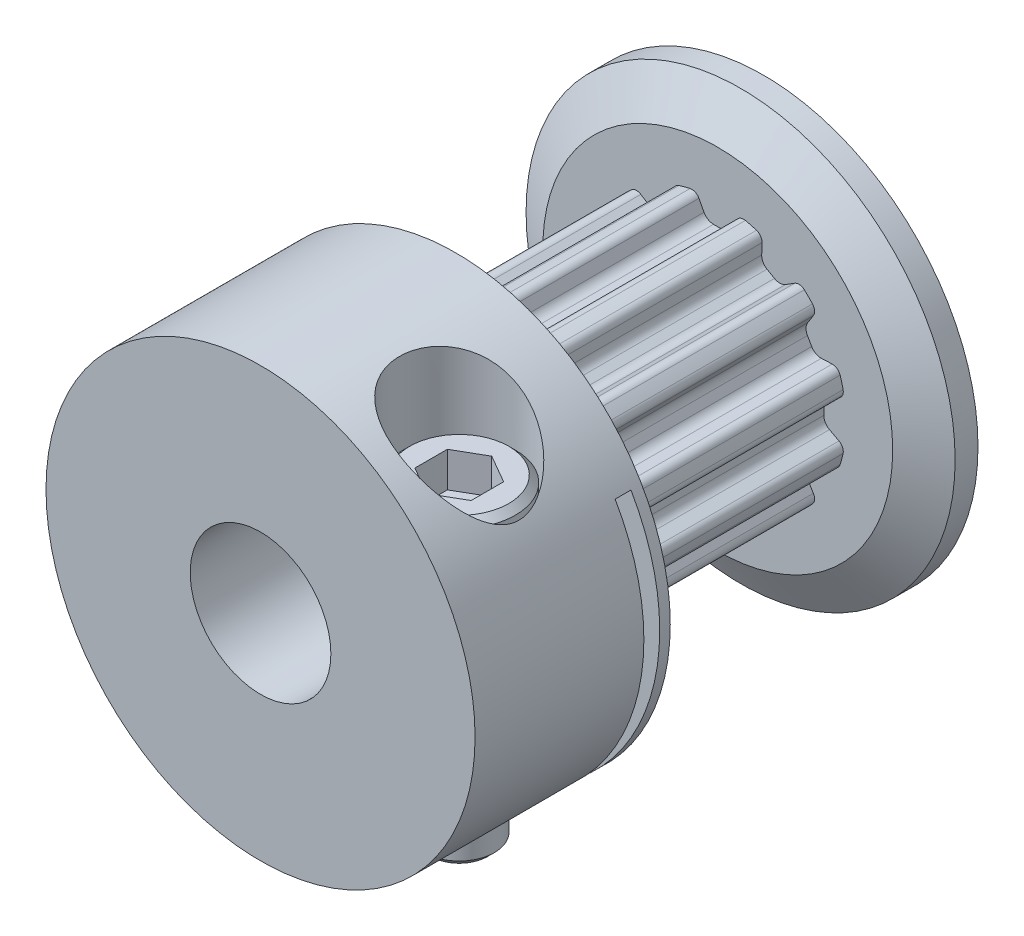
ISO-10303-21;
HEADER;
FILE_DESCRIPTION(('STEP AP214'),'2;1');
FILE_NAME('part.step','',(''),(''),'','','');
FILE_SCHEMA(('AUTOMOTIVE_DESIGN { 1 0 10303 214 1 1 1 1 }'));
ENDSEC;
DATA;
#1=APPLICATION_CONTEXT('core data for automotive mechanical design processes');
#2=APPLICATION_PROTOCOL_DEFINITION('international standard','automotive_design',2000,#1);
#3=PRODUCT_CONTEXT('',#1,'mechanical');
#4=PRODUCT('Part','Part','',(#3));
#5=PRODUCT_RELATED_PRODUCT_CATEGORY('part','',(#4));
#6=PRODUCT_DEFINITION_FORMATION('','',#4);
#7=PRODUCT_DEFINITION_CONTEXT('part definition',#1,'design');
#8=PRODUCT_DEFINITION('design','',#6,#7);
#9=PRODUCT_DEFINITION_SHAPE('','',#8);
#10=(LENGTH_UNIT() NAMED_UNIT(*) SI_UNIT(.MILLI.,.METRE.));
#11=(NAMED_UNIT(*) PLANE_ANGLE_UNIT() SI_UNIT($,.RADIAN.));
#12=(NAMED_UNIT(*) SI_UNIT($,.STERADIAN.) SOLID_ANGLE_UNIT());
#13=UNCERTAINTY_MEASURE_WITH_UNIT(LENGTH_MEASURE(1.E-05),#10,'distance_accuracy_value','');
#14=(GEOMETRIC_REPRESENTATION_CONTEXT(3) GLOBAL_UNCERTAINTY_ASSIGNED_CONTEXT((#13)) GLOBAL_UNIT_ASSIGNED_CONTEXT((#10,
#11,#12)) REPRESENTATION_CONTEXT('',''));
#15=CARTESIAN_POINT('',(0.,0.,0.));
#16=DIRECTION('',(0.,0.,1.));
#17=DIRECTION('',(1.,0.,0.));
#18=AXIS2_PLACEMENT_3D('',#15,#16,#17);
#19=CARTESIAN_POINT('',(0.,0.,-8.3));
#20=DIRECTION('',(0.,0.,-1.));
#21=DIRECTION('',(-1.,0.,0.));
#22=AXIS2_PLACEMENT_3D('',#19,#20,#21);
#23=PLANE('',#22);
#24=CARTESIAN_POINT('',(0.,0.,-8.3));
#25=DIRECTION('',(0.,0.,1.));
#26=DIRECTION('',(1.,0.,0.));
#27=AXIS2_PLACEMENT_3D('',#24,#25,#26);
#28=CIRCLE('',#27,2.);
#29=CARTESIAN_POINT('',(2.,0.,-8.3));
#30=VERTEX_POINT('',#29);
#31=EDGE_CURVE('E702',#30,#30,#28,.T.);
#32=ORIENTED_EDGE('',*,*,#31,.T.);
#33=EDGE_LOOP('',(#32));
#34=FACE_BOUND('',#33,.T.);
#35=CARTESIAN_POINT('',(0.,0.,-8.3));
#36=DIRECTION('',(0.,0.,-1.));
#37=DIRECTION('',(-1.,0.,0.));
#38=AXIS2_PLACEMENT_3D('',#35,#36,#37);
#39=CIRCLE('',#38,2.5496);
#40=CARTESIAN_POINT('',(-2.5496,0.,-8.3));
#41=VERTEX_POINT('',#40);
#42=EDGE_CURVE('E1385',#41,#41,#39,.T.);
#43=ORIENTED_EDGE('',*,*,#42,.T.);
#44=EDGE_LOOP('',(#43));
#45=FACE_BOUND('',#44,.T.);
#46=ADVANCED_FACE('F35',(#34,#45),#23,.T.);
#47=CARTESIAN_POINT('',(0.,4.97416697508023,-7.65));
#48=DIRECTION('',(0.,0.,1.));
#49=DIRECTION('',(1.,0.,0.));
#50=AXIS2_PLACEMENT_3D('',#47,#48,#49);
#51=PLANE('',#50);
#52=CARTESIAN_POINT('',(0.,0.,-7.65));
#53=DIRECTION('',(0.,0.,1.));
#54=DIRECTION('',(1.,0.,0.));
#55=AXIS2_PLACEMENT_3D('',#52,#53,#54);
#56=CIRCLE('',#55,4.97416697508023);
#57=CARTESIAN_POINT('',(4.97416697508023,0.,-7.65));
#58=VERTEX_POINT('',#57);
#59=EDGE_CURVE('E831',#58,#58,#56,.T.);
#60=ORIENTED_EDGE('',*,*,#59,.F.);
#61=EDGE_LOOP('',(#60));
#62=FACE_BOUND('',#61,.T.);
#63=CARTESIAN_POINT('',(0.,0.,-7.65));
#64=DIRECTION('',(0.,0.,1.));
#65=DIRECTION('',(1.,0.,0.));
#66=AXIS2_PLACEMENT_3D('',#63,#64,#65);
#67=CIRCLE('',#66,3.285);
#68=CARTESIAN_POINT('',(3.285,0.,-7.65));
#69=VERTEX_POINT('',#68);
#70=EDGE_CURVE('E44',#69,#69,#67,.F.);
#71=ORIENTED_EDGE('',*,*,#70,.F.);
#72=EDGE_LOOP('',(#71));
#73=FACE_BOUND('',#72,.T.);
#74=ADVANCED_FACE('F783',(#62,#73),#51,.F.);
#75=CARTESIAN_POINT('',(0.,0.,-7.));
#76=DIRECTION('',(0.,0.,1.));
#77=DIRECTION('',(1.,0.,0.));
#78=AXIS2_PLACEMENT_3D('',#75,#76,#77);
#79=CYLINDRICAL_SURFACE('',#78,3.65);
#80=DIRECTION('',(0.,0.,1.));
#81=VECTOR('',#80,1.);
#82=CARTESIAN_POINT('',(-0.786323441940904,3.56429452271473,-3.5));
#83=LINE('',#82,#81);
#84=CARTESIAN_POINT('',(-0.786323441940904,3.56429452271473,-7.));
#85=VERTEX_POINT('',#84);
#86=CARTESIAN_POINT('',(-0.786323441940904,3.56429452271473,0.));
#87=VERTEX_POINT('',#86);
#88=EDGE_CURVE('E2633',#85,#87,#83,.T.);
#89=ORIENTED_EDGE('',*,*,#88,.F.);
#90=CARTESIAN_POINT('',(0.,0.,-7.));
#91=DIRECTION('',(0.,0.,-1.));
#92=DIRECTION('',(-1.,0.,0.));
#93=AXIS2_PLACEMENT_3D('',#90,#91,#92);
#94=CIRCLE('',#93,3.65);
#95=CARTESIAN_POINT('',(-1.1011711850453,3.47993132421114,-7.));
#96=VERTEX_POINT('',#95);
#97=EDGE_CURVE('E2412',#96,#85,#94,.T.);
#98=ORIENTED_EDGE('',*,*,#97,.F.);
#99=DIRECTION('',(0.,0.,1.));
#100=VECTOR('',#99,1.);
#101=CARTESIAN_POINT('',(-1.1011711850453,3.47993132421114,-4.15));
#102=LINE('',#101,#100);
#103=CARTESIAN_POINT('',(-1.1011711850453,3.47993132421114,0.));
#104=VERTEX_POINT('',#103);
#105=EDGE_CURVE('E2615',#96,#104,#102,.T.);
#106=ORIENTED_EDGE('',*,*,#105,.T.);
#107=CARTESIAN_POINT('',(0.,0.,0.));
#108=DIRECTION('',(0.,0.,1.));
#109=DIRECTION('',(1.,0.,0.));
#110=AXIS2_PLACEMENT_3D('',#107,#108,#109);
#111=CIRCLE('',#110,3.65);
#112=EDGE_CURVE('E2664',#104,#87,#111,.F.);
#113=ORIENTED_EDGE('',*,*,#112,.T.);
#114=EDGE_LOOP('',(#89,#98,#106,#113));
#115=FACE_BOUND('',#114,.T.);
#116=ADVANCED_FACE('F791',(#115),#79,.T.);
#117=DIRECTION('',(0.,0.,1.));
#118=VECTOR('',#117,1.);
#119=CARTESIAN_POINT('',(-2.46312333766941,2.69360788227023,-3.5));
#120=LINE('',#119,#118);
#121=CARTESIAN_POINT('',(-2.46312333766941,2.69360788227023,-7.));
#122=VERTEX_POINT('',#121);
#123=CARTESIAN_POINT('',(-2.46312333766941,2.69360788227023,0.));
#124=VERTEX_POINT('',#123);
#125=EDGE_CURVE('E2612',#122,#124,#120,.T.);
#126=ORIENTED_EDGE('',*,*,#125,.F.);
#127=CARTESIAN_POINT('',(-2.69360788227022,2.46312333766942,-7.));
#128=VERTEX_POINT('',#127);
#129=EDGE_CURVE('E2413',#128,#122,#94,.T.);
#130=ORIENTED_EDGE('',*,*,#129,.F.);
#131=DIRECTION('',(0.,0.,1.));
#132=VECTOR('',#131,1.);
#133=CARTESIAN_POINT('',(-2.69360788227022,2.46312333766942,-3.5));
#134=LINE('',#133,#132);
#135=CARTESIAN_POINT('',(-2.69360788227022,2.46312333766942,0.));
#136=VERTEX_POINT('',#135);
#137=EDGE_CURVE('E2594',#128,#136,#134,.T.);
#138=ORIENTED_EDGE('',*,*,#137,.T.);
#139=EDGE_CURVE('E2667',#136,#124,#111,.F.);
#140=ORIENTED_EDGE('',*,*,#139,.T.);
#141=EDGE_LOOP('',(#126,#130,#138,#140));
#142=FACE_BOUND('',#141,.T.);
#143=ADVANCED_FACE('F2124',(#142),#79,.T.);
#144=DIRECTION('',(0.,0.,1.));
#145=VECTOR('',#144,1.);
#146=CARTESIAN_POINT('',(-3.47993132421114,1.10117118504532,-3.5));
#147=LINE('',#146,#145);
#148=CARTESIAN_POINT('',(-3.47993132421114,1.10117118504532,-7.));
#149=VERTEX_POINT('',#148);
#150=CARTESIAN_POINT('',(-3.47993132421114,1.10117118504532,0.));
#151=VERTEX_POINT('',#150);
#152=EDGE_CURVE('E2591',#149,#151,#147,.T.);
#153=ORIENTED_EDGE('',*,*,#152,.F.);
#154=CARTESIAN_POINT('',(-3.56429452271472,0.786323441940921,-7.));
#155=VERTEX_POINT('',#154);
#156=EDGE_CURVE('E2415',#155,#149,#94,.T.);
#157=ORIENTED_EDGE('',*,*,#156,.F.);
#158=DIRECTION('',(0.,0.,1.));
#159=VECTOR('',#158,1.);
#160=CARTESIAN_POINT('',(-3.56429452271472,0.786323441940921,-3.5));
#161=LINE('',#160,#159);
#162=CARTESIAN_POINT('',(-3.56429452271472,0.786323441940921,0.));
#163=VERTEX_POINT('',#162);
#164=EDGE_CURVE('E2573',#155,#163,#161,.T.);
#165=ORIENTED_EDGE('',*,*,#164,.T.);
#166=EDGE_CURVE('E2695',#163,#151,#111,.F.);
#167=ORIENTED_EDGE('',*,*,#166,.T.);
#168=EDGE_LOOP('',(#153,#157,#165,#167));
#169=FACE_BOUND('',#168,.T.);
#170=ADVANCED_FACE('F2134',(#169),#79,.T.);
#171=DIRECTION('',(0.,0.,1.));
#172=VECTOR('',#171,1.);
#173=CARTESIAN_POINT('',(-3.56429452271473,-0.786323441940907,-3.5));
#174=LINE('',#173,#172);
#175=CARTESIAN_POINT('',(-3.56429452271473,-0.786323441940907,-7.));
#176=VERTEX_POINT('',#175);
#177=CARTESIAN_POINT('',(-3.56429452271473,-0.786323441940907,0.));
#178=VERTEX_POINT('',#177);
#179=EDGE_CURVE('E2570',#176,#178,#174,.T.);
#180=ORIENTED_EDGE('',*,*,#179,.F.);
#181=CARTESIAN_POINT('',(-3.47993132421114,-1.10117118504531,-7.));
#182=VERTEX_POINT('',#181);
#183=EDGE_CURVE('E2417',#182,#176,#94,.T.);
#184=ORIENTED_EDGE('',*,*,#183,.F.);
#185=DIRECTION('',(0.,0.,1.));
#186=VECTOR('',#185,1.);
#187=CARTESIAN_POINT('',(-3.47993132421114,-1.10117118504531,-4.15));
#188=LINE('',#187,#186);
#189=CARTESIAN_POINT('',(-3.47993132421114,-1.10117118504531,0.));
#190=VERTEX_POINT('',#189);
#191=EDGE_CURVE('E2552',#182,#190,#188,.T.);
#192=ORIENTED_EDGE('',*,*,#191,.T.);
#193=EDGE_CURVE('E2691',#190,#178,#111,.F.);
#194=ORIENTED_EDGE('',*,*,#193,.T.);
#195=EDGE_LOOP('',(#180,#184,#192,#194));
#196=FACE_BOUND('',#195,.T.);
#197=ADVANCED_FACE('F2141',(#196),#79,.T.);
#198=DIRECTION('',(0.,0.,1.));
#199=VECTOR('',#198,1.);
#200=CARTESIAN_POINT('',(-2.69360788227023,-2.46312333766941,-3.5));
#201=LINE('',#200,#199);
#202=CARTESIAN_POINT('',(-2.69360788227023,-2.46312333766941,-7.));
#203=VERTEX_POINT('',#202);
#204=CARTESIAN_POINT('',(-2.69360788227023,-2.46312333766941,0.));
#205=VERTEX_POINT('',#204);
#206=EDGE_CURVE('E2549',#203,#205,#201,.T.);
#207=ORIENTED_EDGE('',*,*,#206,.F.);
#208=CARTESIAN_POINT('',(-2.46312333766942,-2.69360788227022,-7.));
#209=VERTEX_POINT('',#208);
#210=EDGE_CURVE('E2419',#209,#203,#94,.T.);
#211=ORIENTED_EDGE('',*,*,#210,.F.);
#212=DIRECTION('',(0.,0.,1.));
#213=VECTOR('',#212,1.);
#214=CARTESIAN_POINT('',(-2.46312333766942,-2.69360788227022,-3.5));
#215=LINE('',#214,#213);
#216=CARTESIAN_POINT('',(-2.46312333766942,-2.69360788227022,0.));
#217=VERTEX_POINT('',#216);
#218=EDGE_CURVE('E2531',#209,#217,#215,.T.);
#219=ORIENTED_EDGE('',*,*,#218,.T.);
#220=EDGE_CURVE('E2687',#217,#205,#111,.F.);
#221=ORIENTED_EDGE('',*,*,#220,.T.);
#222=EDGE_LOOP('',(#207,#211,#219,#221));
#223=FACE_BOUND('',#222,.T.);
#224=ADVANCED_FACE('F2148',(#223),#79,.T.);
#225=DIRECTION('',(0.,0.,1.));
#226=VECTOR('',#225,1.);
#227=CARTESIAN_POINT('',(-1.10117118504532,-3.47993132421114,-3.5));
#228=LINE('',#227,#226);
#229=CARTESIAN_POINT('',(-1.10117118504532,-3.47993132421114,-7.));
#230=VERTEX_POINT('',#229);
#231=CARTESIAN_POINT('',(-1.10117118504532,-3.47993132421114,0.));
#232=VERTEX_POINT('',#231);
#233=EDGE_CURVE('E2528',#230,#232,#228,.T.);
#234=ORIENTED_EDGE('',*,*,#233,.F.);
#235=CARTESIAN_POINT('',(-0.786323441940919,-3.56429452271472,-7.));
#236=VERTEX_POINT('',#235);
#237=EDGE_CURVE('E2421',#236,#230,#94,.T.);
#238=ORIENTED_EDGE('',*,*,#237,.F.);
#239=DIRECTION('',(0.,0.,1.));
#240=VECTOR('',#239,1.);
#241=CARTESIAN_POINT('',(-0.786323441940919,-3.56429452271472,-3.5));
#242=LINE('',#241,#240);
#243=CARTESIAN_POINT('',(-0.786323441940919,-3.56429452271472,0.));
#244=VERTEX_POINT('',#243);
#245=EDGE_CURVE('E2510',#236,#244,#242,.T.);
#246=ORIENTED_EDGE('',*,*,#245,.T.);
#247=EDGE_CURVE('E2683',#244,#232,#111,.F.);
#248=ORIENTED_EDGE('',*,*,#247,.T.);
#249=EDGE_LOOP('',(#234,#238,#246,#248));
#250=FACE_BOUND('',#249,.T.);
#251=ADVANCED_FACE('F2155',(#250),#79,.T.);
#252=DIRECTION('',(0.,0.,1.));
#253=VECTOR('',#252,1.);
#254=CARTESIAN_POINT('',(0.786323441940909,-3.56429452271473,-3.5));
#255=LINE('',#254,#253);
#256=CARTESIAN_POINT('',(0.786323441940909,-3.56429452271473,-7.));
#257=VERTEX_POINT('',#256);
#258=CARTESIAN_POINT('',(0.786323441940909,-3.56429452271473,0.));
#259=VERTEX_POINT('',#258);
#260=EDGE_CURVE('E2507',#257,#259,#255,.T.);
#261=ORIENTED_EDGE('',*,*,#260,.F.);
#262=CARTESIAN_POINT('',(1.10117118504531,-3.47993132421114,-7.));
#263=VERTEX_POINT('',#262);
#264=EDGE_CURVE('E2423',#263,#257,#94,.T.);
#265=ORIENTED_EDGE('',*,*,#264,.F.);
#266=DIRECTION('',(0.,0.,1.));
#267=VECTOR('',#266,1.);
#268=CARTESIAN_POINT('',(1.10117118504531,-3.47993132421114,-4.15));
#269=LINE('',#268,#267);
#270=CARTESIAN_POINT('',(1.10117118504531,-3.47993132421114,0.));
#271=VERTEX_POINT('',#270);
#272=EDGE_CURVE('E2489',#263,#271,#269,.T.);
#273=ORIENTED_EDGE('',*,*,#272,.T.);
#274=EDGE_CURVE('E2679',#271,#259,#111,.F.);
#275=ORIENTED_EDGE('',*,*,#274,.T.);
#276=EDGE_LOOP('',(#261,#265,#273,#275));
#277=FACE_BOUND('',#276,.T.);
#278=ADVANCED_FACE('F2162',(#277),#79,.T.);
#279=DIRECTION('',(0.,0.,1.));
#280=VECTOR('',#279,1.);
#281=CARTESIAN_POINT('',(2.46312333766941,-2.69360788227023,-3.5));
#282=LINE('',#281,#280);
#283=CARTESIAN_POINT('',(2.46312333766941,-2.69360788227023,-7.));
#284=VERTEX_POINT('',#283);
#285=CARTESIAN_POINT('',(2.46312333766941,-2.69360788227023,0.));
#286=VERTEX_POINT('',#285);
#287=EDGE_CURVE('E2486',#284,#286,#282,.T.);
#288=ORIENTED_EDGE('',*,*,#287,.F.);
#289=CARTESIAN_POINT('',(2.69360788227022,-2.46312333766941,-7.));
#290=VERTEX_POINT('',#289);
#291=EDGE_CURVE('E2425',#290,#284,#94,.T.);
#292=ORIENTED_EDGE('',*,*,#291,.F.);
#293=DIRECTION('',(0.,0.,1.));
#294=VECTOR('',#293,1.);
#295=CARTESIAN_POINT('',(2.69360788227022,-2.46312333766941,-3.5));
#296=LINE('',#295,#294);
#297=CARTESIAN_POINT('',(2.69360788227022,-2.46312333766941,0.));
#298=VERTEX_POINT('',#297);
#299=EDGE_CURVE('E2468',#290,#298,#296,.T.);
#300=ORIENTED_EDGE('',*,*,#299,.T.);
#301=EDGE_CURVE('E2675',#298,#286,#111,.F.);
#302=ORIENTED_EDGE('',*,*,#301,.T.);
#303=EDGE_LOOP('',(#288,#292,#300,#302));
#304=FACE_BOUND('',#303,.T.);
#305=ADVANCED_FACE('F2169',(#304),#79,.T.);
#306=DIRECTION('',(0.,0.,1.));
#307=VECTOR('',#306,1.);
#308=CARTESIAN_POINT('',(3.47993132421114,-1.10117118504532,-3.5));
#309=LINE('',#308,#307);
#310=CARTESIAN_POINT('',(3.47993132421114,-1.10117118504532,-7.));
#311=VERTEX_POINT('',#310);
#312=CARTESIAN_POINT('',(3.47993132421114,-1.10117118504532,0.));
#313=VERTEX_POINT('',#312);
#314=EDGE_CURVE('E2465',#311,#313,#309,.T.);
#315=ORIENTED_EDGE('',*,*,#314,.F.);
#316=CARTESIAN_POINT('',(3.56429452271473,-0.786323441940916,-7.));
#317=VERTEX_POINT('',#316);
#318=EDGE_CURVE('E2427',#317,#311,#94,.T.);
#319=ORIENTED_EDGE('',*,*,#318,.F.);
#320=DIRECTION('',(0.,0.,1.));
#321=VECTOR('',#320,1.);
#322=CARTESIAN_POINT('',(3.56429452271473,-0.786323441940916,-4.15));
#323=LINE('',#322,#321);
#324=CARTESIAN_POINT('',(3.56429452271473,-0.786323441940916,0.));
#325=VERTEX_POINT('',#324);
#326=EDGE_CURVE('E2441',#317,#325,#323,.T.);
#327=ORIENTED_EDGE('',*,*,#326,.T.);
#328=EDGE_CURVE('E2673',#325,#313,#111,.F.);
#329=ORIENTED_EDGE('',*,*,#328,.T.);
#330=EDGE_LOOP('',(#315,#319,#327,#329));
#331=FACE_BOUND('',#330,.T.);
#332=ADVANCED_FACE('F2176',(#331),#79,.T.);
#333=DIRECTION('',(0.,0.,1.));
#334=VECTOR('',#333,1.);
#335=CARTESIAN_POINT('',(3.56429452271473,0.786323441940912,-3.5));
#336=LINE('',#335,#334);
#337=CARTESIAN_POINT('',(3.56429452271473,0.786323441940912,-7.));
#338=VERTEX_POINT('',#337);
#339=CARTESIAN_POINT('',(3.56429452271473,0.786323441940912,0.));
#340=VERTEX_POINT('',#339);
#341=EDGE_CURVE('E2437',#338,#340,#336,.T.);
#342=ORIENTED_EDGE('',*,*,#341,.F.);
#343=CARTESIAN_POINT('',(3.47993132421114,1.10117118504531,-7.));
#344=VERTEX_POINT('',#343);
#345=EDGE_CURVE('E1301',#344,#338,#94,.T.);
#346=ORIENTED_EDGE('',*,*,#345,.F.);
#347=DIRECTION('',(0.,0.,1.));
#348=VECTOR('',#347,1.);
#349=CARTESIAN_POINT('',(3.47993132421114,1.10117118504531,-4.15));
#350=LINE('',#349,#348);
#351=CARTESIAN_POINT('',(3.47993132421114,1.10117118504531,0.));
#352=VERTEX_POINT('',#351);
#353=EDGE_CURVE('E2876',#344,#352,#350,.T.);
#354=ORIENTED_EDGE('',*,*,#353,.T.);
#355=EDGE_CURVE('E2440',#352,#340,#111,.F.);
#356=ORIENTED_EDGE('',*,*,#355,.T.);
#357=EDGE_LOOP('',(#342,#346,#354,#356));
#358=FACE_BOUND('',#357,.T.);
#359=ADVANCED_FACE('F2183',(#358),#79,.T.);
#360=DIRECTION('',(0.,0.,1.));
#361=VECTOR('',#360,1.);
#362=CARTESIAN_POINT('',(2.69360788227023,2.46312333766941,-3.5));
#363=LINE('',#362,#361);
#364=CARTESIAN_POINT('',(2.69360788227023,2.46312333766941,-7.));
#365=VERTEX_POINT('',#364);
#366=CARTESIAN_POINT('',(2.69360788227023,2.46312333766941,0.));
#367=VERTEX_POINT('',#366);
#368=EDGE_CURVE('E2845',#365,#367,#363,.T.);
#369=ORIENTED_EDGE('',*,*,#368,.F.);
#370=CARTESIAN_POINT('',(2.46312333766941,2.69360788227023,-7.));
#371=VERTEX_POINT('',#370);
#372=EDGE_CURVE('E1298',#371,#365,#94,.T.);
#373=ORIENTED_EDGE('',*,*,#372,.F.);
#374=DIRECTION('',(0.,0.,1.));
#375=VECTOR('',#374,1.);
#376=CARTESIAN_POINT('',(2.46312333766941,2.69360788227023,-4.15));
#377=LINE('',#376,#375);
#378=CARTESIAN_POINT('',(2.46312333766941,2.69360788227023,0.));
#379=VERTEX_POINT('',#378);
#380=EDGE_CURVE('E2672',#371,#379,#377,.T.);
#381=ORIENTED_EDGE('',*,*,#380,.T.);
#382=EDGE_CURVE('E2665',#379,#367,#111,.F.);
#383=ORIENTED_EDGE('',*,*,#382,.T.);
#384=EDGE_LOOP('',(#369,#373,#381,#383));
#385=FACE_BOUND('',#384,.T.);
#386=ADVANCED_FACE('F772',(#385),#79,.T.);
#387=CARTESIAN_POINT('',(0.,1.5,0.));
#388=DIRECTION('',(0.,0.,1.));
#389=DIRECTION('',(1.,0.,0.));
#390=AXIS2_PLACEMENT_3D('',#387,#388,#389);
#391=PLANE('',#390);
#392=CARTESIAN_POINT('',(0.,0.,0.));
#393=DIRECTION('',(0.,0.,-1.));
#394=DIRECTION('',(-1.,0.,0.));
#395=AXIS2_PLACEMENT_3D('',#392,#393,#394);
#396=CIRCLE('',#395,4.97416697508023);
#397=CARTESIAN_POINT('',(-4.97416697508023,0.,0.));
#398=VERTEX_POINT('',#397);
#399=EDGE_CURVE('E819',#398,#398,#396,.T.);
#400=ORIENTED_EDGE('',*,*,#399,.T.);
#401=EDGE_LOOP('',(#400));
#402=FACE_BOUND('',#401,.T.);
#403=ORIENTED_EDGE('',*,*,#382,.F.);
#404=CARTESIAN_POINT('',(2.30885758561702,2.52490685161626,0.));
#405=DIRECTION('',(0.,0.,-1.));
#406=DIRECTION('',(1.,0.,0.));
#407=AXIS2_PLACEMENT_3D('',#404,#405,#406);
#408=CIRCLE('',#407,0.2286);
#409=CARTESIAN_POINT('',(2.18771804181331,2.71877064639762,0.));
#410=VERTEX_POINT('',#409);
#411=EDGE_CURVE('E1259',#410,#379,#408,.T.);
#412=ORIENTED_EDGE('',*,*,#411,.F.);
#413=DIRECTION('',(0.848048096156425,0.529919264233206,0.));
#414=VECTOR('',#413,1.);
#415=CARTESIAN_POINT('',(2.18771804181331,2.71877064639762,0.));
#416=LINE('',#415,#414);
#417=CARTESIAN_POINT('',(1.92677803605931,2.5557172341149,0.));
#418=VERTEX_POINT('',#417);
#419=EDGE_CURVE('E1276',#418,#410,#416,.T.);
#420=ORIENTED_EDGE('',*,*,#419,.F.);
#421=CARTESIAN_POINT('',(1.76525864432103,2.81420229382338,0.));
#422=DIRECTION('',(0.,0.,1.));
#423=DIRECTION('',(1.,0.,0.));
#424=AXIS2_PLACEMENT_3D('',#421,#422,#423);
#425=CIRCLE('',#424,0.3048);
#426=CARTESIAN_POINT('',(1.61285864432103,2.55023775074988,0.));
#427=VERTEX_POINT('',#426);
#428=EDGE_CURVE('E1273',#427,#418,#425,.T.);
#429=ORIENTED_EDGE('',*,*,#428,.F.);
#430=DIRECTION('',(0.866025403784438,-0.500000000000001,0.));
#431=VECTOR('',#430,1.);
#432=CARTESIAN_POINT('',(1.61285864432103,2.55023775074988,0.));
#433=LINE('',#432,#431);
#434=CARTESIAN_POINT('',(1.40214135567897,2.67189543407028,0.));
#435=VERTEX_POINT('',#434);
#436=EDGE_CURVE('E1270',#435,#427,#433,.T.);
#437=ORIENTED_EDGE('',*,*,#436,.F.);
#438=CARTESIAN_POINT('',(1.55454135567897,2.93585997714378,0.));
#439=DIRECTION('',(0.,0.,1.));
#440=DIRECTION('',(1.,0.,0.));
#441=AXIS2_PLACEMENT_3D('',#438,#439,#440);
#442=CIRCLE('',#441,0.3048);
#443=CARTESIAN_POINT('',(1.24992703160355,2.9464973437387,0.));
#444=VERTEX_POINT('',#443);
#445=EDGE_CURVE('E1267',#444,#435,#442,.T.);
#446=ORIENTED_EDGE('',*,*,#445,.F.);
#447=DIRECTION('',(-0.0348994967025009,-0.999390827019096,0.));
#448=VECTOR('',#447,1.);
#449=CARTESIAN_POINT('',(1.24992703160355,2.9464973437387,0.));
#450=LINE('',#449,#448);
#451=CARTESIAN_POINT('',(1.26066542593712,3.25400472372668,0.));
#452=VERTEX_POINT('',#451);
#453=EDGE_CURVE('E1264',#452,#444,#450,.T.);
#454=ORIENTED_EDGE('',*,*,#453,.F.);
#455=CARTESIAN_POINT('',(1.03220468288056,3.26198274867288,0.));
#456=DIRECTION('',(0.,0.,-1.));
#457=DIRECTION('',(1.,0.,0.));
#458=AXIS2_PLACEMENT_3D('',#455,#456,#457);
#459=CIRCLE('',#458,0.2286);
#460=CARTESIAN_POINT('',(1.10117118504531,3.47993132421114,0.));
#461=VERTEX_POINT('',#460);
#462=EDGE_CURVE('E1261',#461,#452,#459,.T.);
#463=ORIENTED_EDGE('',*,*,#462,.F.);
#464=CARTESIAN_POINT('',(0.786323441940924,3.56429452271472,0.));
#465=VERTEX_POINT('',#464);
#466=EDGE_CURVE('E727',#465,#461,#111,.F.);
#467=ORIENTED_EDGE('',*,*,#466,.F.);
#468=CARTESIAN_POINT('',(0.737075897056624,3.34106226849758,0.));
#469=DIRECTION('',(0.,0.,-1.));
#470=DIRECTION('',(0.86602540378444,0.499999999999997,0.));
#471=AXIS2_PLACEMENT_3D('',#468,#469,#470);
#472=CIRCLE('',#471,0.2286);
#473=CARTESIAN_POINT('',(0.535234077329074,3.44838346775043,0.));
#474=VERTEX_POINT('',#473);
#475=EDGE_CURVE('E843',#474,#465,#472,.T.);
#476=ORIENTED_EDGE('',*,*,#475,.F.);
#477=DIRECTION('',(0.469471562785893,0.882947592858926,0.));
#478=VECTOR('',#477,1.);
#479=CARTESIAN_POINT('',(0.535234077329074,3.44838346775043,0.));
#480=LINE('',#479,#478);
#481=CARTESIAN_POINT('',(0.39078010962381,3.17670506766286,0.));
#482=VERTEX_POINT('',#481);
#483=EDGE_CURVE('E858',#482,#474,#480,.T.);
#484=ORIENTED_EDGE('',*,*,#483,.F.);
#485=CARTESIAN_POINT('',(0.12165768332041,3.3198,0.));
#486=DIRECTION('',(0.,0.,1.));
#487=DIRECTION('',(0.86602540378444,0.499999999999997,0.));
#488=AXIS2_PLACEMENT_3D('',#485,#486,#487);
#489=CIRCLE('',#488,0.3048);
#490=CARTESIAN_POINT('',(0.121657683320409,3.015,0.));
#491=VERTEX_POINT('',#490);
#492=EDGE_CURVE('E855',#491,#482,#489,.T.);
#493=ORIENTED_EDGE('',*,*,#492,.F.);
#494=DIRECTION('',(1.,0.,0.));
#495=VECTOR('',#494,1.);
#496=CARTESIAN_POINT('',(0.121657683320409,3.015,0.));
#497=LINE('',#496,#495);
#498=CARTESIAN_POINT('',(-0.121657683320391,3.015,0.));
#499=VERTEX_POINT('',#498);
#500=EDGE_CURVE('E852',#499,#491,#497,.T.);
#501=ORIENTED_EDGE('',*,*,#500,.F.);
#502=CARTESIAN_POINT('',(-0.12165768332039,3.3198,0.));
#503=DIRECTION('',(0.,0.,1.));
#504=DIRECTION('',(0.86602540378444,0.499999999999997,0.));
#505=AXIS2_PLACEMENT_3D('',#502,#503,#504);
#506=CIRCLE('',#505,0.3048);
#507=CARTESIAN_POINT('',(-0.390780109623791,3.17670506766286,0.));
#508=VERTEX_POINT('',#507);
#509=EDGE_CURVE('E849',#508,#499,#506,.T.);
#510=ORIENTED_EDGE('',*,*,#509,.F.);
#511=DIRECTION('',(0.469471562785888,-0.882947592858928,0.));
#512=VECTOR('',#511,1.);
#513=CARTESIAN_POINT('',(-0.390780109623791,3.17670506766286,0.));
#514=LINE('',#513,#512);
#515=CARTESIAN_POINT('',(-0.535234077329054,3.44838346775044,0.));
#516=VERTEX_POINT('',#515);
#517=EDGE_CURVE('E846',#516,#508,#514,.T.);
#518=ORIENTED_EDGE('',*,*,#517,.F.);
#519=CARTESIAN_POINT('',(-0.737075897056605,3.34106226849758,0.));
#520=DIRECTION('',(0.,0.,-1.));
#521=DIRECTION('',(0.86602540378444,0.499999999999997,0.));
#522=AXIS2_PLACEMENT_3D('',#519,#520,#521);
#523=CIRCLE('',#522,0.2286);
#524=EDGE_CURVE('E58',#87,#516,#523,.T.);
#525=ORIENTED_EDGE('',*,*,#524,.F.);
#526=ORIENTED_EDGE('',*,*,#112,.F.);
#527=CARTESIAN_POINT('',(-1.03220468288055,3.26198274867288,0.));
#528=DIRECTION('',(0.,0.,-1.));
#529=DIRECTION('',(0.500000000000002,0.866025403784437,0.));
#530=AXIS2_PLACEMENT_3D('',#527,#528,#529);
#531=CIRCLE('',#530,0.2286);
#532=CARTESIAN_POINT('',(-1.26066542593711,3.25400472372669,0.));
#533=VERTEX_POINT('',#532);
#534=EDGE_CURVE('E879',#533,#104,#531,.T.);
#535=ORIENTED_EDGE('',*,*,#534,.F.);
#536=DIRECTION('',(-0.0348994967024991,0.999390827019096,0.));
#537=VECTOR('',#536,1.);
#538=CARTESIAN_POINT('',(-1.26066542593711,3.25400472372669,0.));
#539=LINE('',#538,#537);
#540=CARTESIAN_POINT('',(-1.24992703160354,2.94649734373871,0.));
#541=VERTEX_POINT('',#540);
#542=EDGE_CURVE('E896',#541,#533,#539,.T.);
#543=ORIENTED_EDGE('',*,*,#542,.F.);
#544=CARTESIAN_POINT('',(-1.55454135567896,2.93585997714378,0.));
#545=DIRECTION('',(0.,0.,1.));
#546=DIRECTION('',(0.500000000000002,0.866025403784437,0.));
#547=AXIS2_PLACEMENT_3D('',#544,#545,#546);
#548=CIRCLE('',#547,0.3048);
#549=CARTESIAN_POINT('',(-1.40214135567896,2.67189543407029,0.));
#550=VERTEX_POINT('',#549);
#551=EDGE_CURVE('E893',#550,#541,#548,.T.);
#552=ORIENTED_EDGE('',*,*,#551,.F.);
#553=DIRECTION('',(0.86602540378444,0.499999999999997,0.));
#554=VECTOR('',#553,1.);
#555=CARTESIAN_POINT('',(-1.40214135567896,2.67189543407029,0.));
#556=LINE('',#555,#554);
#557=CARTESIAN_POINT('',(-1.61285864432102,2.55023775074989,0.));
#558=VERTEX_POINT('',#557);
#559=EDGE_CURVE('E890',#558,#550,#556,.T.);
#560=ORIENTED_EDGE('',*,*,#559,.F.);
#561=CARTESIAN_POINT('',(-1.76525864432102,2.81420229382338,0.));
#562=DIRECTION('',(0.,0.,1.));
#563=DIRECTION('',(0.500000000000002,0.866025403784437,0.));
#564=AXIS2_PLACEMENT_3D('',#561,#562,#563);
#565=CIRCLE('',#564,0.3048);
#566=CARTESIAN_POINT('',(-1.9267780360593,2.55571723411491,0.));
#567=VERTEX_POINT('',#566);
#568=EDGE_CURVE('E887',#567,#558,#565,.T.);
#569=ORIENTED_EDGE('',*,*,#568,.F.);
#570=DIRECTION('',(0.848048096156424,-0.529919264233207,0.));
#571=VECTOR('',#570,1.);
#572=CARTESIAN_POINT('',(-1.9267780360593,2.55571723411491,0.));
#573=LINE('',#572,#571);
#574=CARTESIAN_POINT('',(-2.1877180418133,2.71877064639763,0.));
#575=VERTEX_POINT('',#574);
#576=EDGE_CURVE('E884',#575,#567,#573,.T.);
#577=ORIENTED_EDGE('',*,*,#576,.F.);
#578=CARTESIAN_POINT('',(-2.30885758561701,2.52490685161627,0.));
#579=DIRECTION('',(0.,0.,-1.));
#580=DIRECTION('',(0.500000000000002,0.866025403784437,0.));
#581=AXIS2_PLACEMENT_3D('',#578,#579,#580);
#582=CIRCLE('',#581,0.2286);
#583=EDGE_CURVE('E881',#124,#575,#582,.T.);
#584=ORIENTED_EDGE('',*,*,#583,.F.);
#585=ORIENTED_EDGE('',*,*,#139,.F.);
#586=CARTESIAN_POINT('',(-2.52490685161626,2.30885758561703,0.));
#587=DIRECTION('',(0.,0.,-1.));
#588=DIRECTION('',(0.,1.,0.));
#589=AXIS2_PLACEMENT_3D('',#586,#587,#588);
#590=CIRCLE('',#589,0.2286);
#591=CARTESIAN_POINT('',(-2.71877064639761,2.18771804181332,0.));
#592=VERTEX_POINT('',#591);
#593=EDGE_CURVE('E917',#592,#136,#590,.T.);
#594=ORIENTED_EDGE('',*,*,#593,.F.);
#595=DIRECTION('',(-0.529919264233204,0.848048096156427,0.));
#596=VECTOR('',#595,1.);
#597=CARTESIAN_POINT('',(-2.71877064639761,2.18771804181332,0.));
#598=LINE('',#597,#596);
#599=CARTESIAN_POINT('',(-2.5557172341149,1.92677803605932,0.));
#600=VERTEX_POINT('',#599);
#601=EDGE_CURVE('E934',#600,#592,#598,.T.);
#602=ORIENTED_EDGE('',*,*,#601,.F.);
#603=CARTESIAN_POINT('',(-2.81420229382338,1.76525864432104,0.));
#604=DIRECTION('',(0.,0.,1.));
#605=DIRECTION('',(0.,1.,0.));
#606=AXIS2_PLACEMENT_3D('',#603,#604,#605);
#607=CIRCLE('',#606,0.3048);
#608=CARTESIAN_POINT('',(-2.55023775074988,1.61285864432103,0.));
#609=VERTEX_POINT('',#608);
#610=EDGE_CURVE('E931',#609,#600,#607,.T.);
#611=ORIENTED_EDGE('',*,*,#610,.F.);
#612=DIRECTION('',(0.500000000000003,0.866025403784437,0.));
#613=VECTOR('',#612,1.);
#614=CARTESIAN_POINT('',(-2.55023775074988,1.61285864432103,0.));
#615=LINE('',#614,#613);
#616=CARTESIAN_POINT('',(-2.67189543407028,1.40214135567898,0.));
#617=VERTEX_POINT('',#616);
#618=EDGE_CURVE('E928',#617,#609,#615,.T.);
#619=ORIENTED_EDGE('',*,*,#618,.F.);
#620=CARTESIAN_POINT('',(-2.93585997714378,1.55454135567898,0.));
#621=DIRECTION('',(0.,0.,1.));
#622=DIRECTION('',(0.,1.,0.));
#623=AXIS2_PLACEMENT_3D('',#620,#621,#622);
#624=CIRCLE('',#623,0.3048);
#625=CARTESIAN_POINT('',(-2.9464973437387,1.24992703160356,0.));
#626=VERTEX_POINT('',#625);
#627=EDGE_CURVE('E925',#626,#617,#624,.T.);
#628=ORIENTED_EDGE('',*,*,#627,.F.);
#629=DIRECTION('',(0.999390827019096,-0.0348994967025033,0.));
#630=VECTOR('',#629,1.);
#631=CARTESIAN_POINT('',(-2.9464973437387,1.24992703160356,0.));
#632=LINE('',#631,#630);
#633=CARTESIAN_POINT('',(-3.25400472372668,1.26066542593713,0.));
#634=VERTEX_POINT('',#633);
#635=EDGE_CURVE('E922',#634,#626,#632,.T.);
#636=ORIENTED_EDGE('',*,*,#635,.F.);
#637=CARTESIAN_POINT('',(-3.26198274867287,1.03220468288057,0.));
#638=DIRECTION('',(0.,0.,-1.));
#639=DIRECTION('',(0.,1.,0.));
#640=AXIS2_PLACEMENT_3D('',#637,#638,#639);
#641=CIRCLE('',#640,0.2286);
#642=EDGE_CURVE('E919',#151,#634,#641,.T.);
#643=ORIENTED_EDGE('',*,*,#642,.F.);
#644=ORIENTED_EDGE('',*,*,#166,.F.);
#645=CARTESIAN_POINT('',(-3.34106226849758,0.737075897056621,0.));
#646=DIRECTION('',(0.,0.,-1.));
#647=DIRECTION('',(-0.499999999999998,0.86602540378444,0.));
#648=AXIS2_PLACEMENT_3D('',#645,#646,#647);
#649=CIRCLE('',#648,0.2286);
#650=CARTESIAN_POINT('',(-3.44838346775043,0.535234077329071,0.));
#651=VERTEX_POINT('',#650);
#652=EDGE_CURVE('E955',#651,#163,#649,.T.);
#653=ORIENTED_EDGE('',*,*,#652,.F.);
#654=DIRECTION('',(-0.882947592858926,0.469471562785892,0.));
#655=VECTOR('',#654,1.);
#656=CARTESIAN_POINT('',(-3.44838346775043,0.535234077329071,0.));
#657=LINE('',#656,#655);
#658=CARTESIAN_POINT('',(-3.17670506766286,0.390780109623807,0.));
#659=VERTEX_POINT('',#658);
#660=EDGE_CURVE('E972',#659,#651,#657,.T.);
#661=ORIENTED_EDGE('',*,*,#660,.F.);
#662=CARTESIAN_POINT('',(-3.3198,0.121657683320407,0.));
#663=DIRECTION('',(0.,0.,1.));
#664=DIRECTION('',(-0.499999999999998,0.86602540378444,0.));
#665=AXIS2_PLACEMENT_3D('',#662,#663,#664);
#666=CIRCLE('',#665,0.3048);
#667=CARTESIAN_POINT('',(-3.015,0.121657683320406,0.));
#668=VERTEX_POINT('',#667);
#669=EDGE_CURVE('E969',#668,#659,#666,.T.);
#670=ORIENTED_EDGE('',*,*,#669,.F.);
#671=DIRECTION('',(0.,1.,0.));
#672=VECTOR('',#671,1.);
#673=CARTESIAN_POINT('',(-3.015,0.121657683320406,0.));
#674=LINE('',#673,#672);
#675=CARTESIAN_POINT('',(-3.015,-0.121657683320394,0.));
#676=VERTEX_POINT('',#675);
#677=EDGE_CURVE('E966',#676,#668,#674,.T.);
#678=ORIENTED_EDGE('',*,*,#677,.F.);
#679=CARTESIAN_POINT('',(-3.3198,-0.121657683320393,0.));
#680=DIRECTION('',(0.,0.,1.));
#681=DIRECTION('',(-0.499999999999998,0.86602540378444,0.));
#682=AXIS2_PLACEMENT_3D('',#679,#680,#681);
#683=CIRCLE('',#682,0.3048);
#684=CARTESIAN_POINT('',(-3.17670506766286,-0.390780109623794,0.));
#685=VERTEX_POINT('',#684);
#686=EDGE_CURVE('E963',#685,#676,#683,.T.);
#687=ORIENTED_EDGE('',*,*,#686,.F.);
#688=DIRECTION('',(0.882947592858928,0.469471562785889,0.));
#689=VECTOR('',#688,1.);
#690=CARTESIAN_POINT('',(-3.17670506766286,-0.390780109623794,0.));
#691=LINE('',#690,#689);
#692=CARTESIAN_POINT('',(-3.44838346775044,-0.535234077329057,0.));
#693=VERTEX_POINT('',#692);
#694=EDGE_CURVE('E960',#693,#685,#691,.T.);
#695=ORIENTED_EDGE('',*,*,#694,.F.);
#696=CARTESIAN_POINT('',(-3.34106226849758,-0.737075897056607,0.));
#697=DIRECTION('',(0.,0.,-1.));
#698=DIRECTION('',(-0.499999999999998,0.86602540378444,0.));
#699=AXIS2_PLACEMENT_3D('',#696,#697,#698);
#700=CIRCLE('',#699,0.2286);
#701=EDGE_CURVE('E957',#178,#693,#700,.T.);
#702=ORIENTED_EDGE('',*,*,#701,.F.);
#703=ORIENTED_EDGE('',*,*,#193,.F.);
#704=CARTESIAN_POINT('',(-3.26198274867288,-1.03220468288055,0.));
#705=DIRECTION('',(0.,0.,-1.));
#706=DIRECTION('',(-0.866025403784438,0.500000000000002,0.));
#707=AXIS2_PLACEMENT_3D('',#704,#705,#706);
#708=CIRCLE('',#707,0.2286);
#709=CARTESIAN_POINT('',(-3.25400472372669,-1.26066542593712,0.));
#710=VERTEX_POINT('',#709);
#711=EDGE_CURVE('E993',#710,#190,#708,.T.);
#712=ORIENTED_EDGE('',*,*,#711,.F.);
#713=DIRECTION('',(-0.999390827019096,-0.0348994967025,0.));
#714=VECTOR('',#713,1.);
#715=CARTESIAN_POINT('',(-3.25400472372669,-1.26066542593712,0.));
#716=LINE('',#715,#714);
#717=CARTESIAN_POINT('',(-2.9464973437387,-1.24992703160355,0.));
#718=VERTEX_POINT('',#717);
#719=EDGE_CURVE('E1010',#718,#710,#716,.T.);
#720=ORIENTED_EDGE('',*,*,#719,.F.);
#721=CARTESIAN_POINT('',(-2.93585997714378,-1.55454135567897,0.));
#722=DIRECTION('',(0.,0.,1.));
#723=DIRECTION('',(-0.866025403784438,0.500000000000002,0.));
#724=AXIS2_PLACEMENT_3D('',#721,#722,#723);
#725=CIRCLE('',#724,0.3048);
#726=CARTESIAN_POINT('',(-2.67189543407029,-1.40214135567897,0.));
#727=VERTEX_POINT('',#726);
#728=EDGE_CURVE('E1007',#727,#718,#725,.T.);
#729=ORIENTED_EDGE('',*,*,#728,.F.);
#730=DIRECTION('',(-0.499999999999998,0.86602540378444,0.));
#731=VECTOR('',#730,1.);
#732=CARTESIAN_POINT('',(-2.67189543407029,-1.40214135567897,0.));
#733=LINE('',#732,#731);
#734=CARTESIAN_POINT('',(-2.55023775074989,-1.61285864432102,0.));
#735=VERTEX_POINT('',#734);
#736=EDGE_CURVE('E1004',#735,#727,#733,.T.);
#737=ORIENTED_EDGE('',*,*,#736,.F.);
#738=CARTESIAN_POINT('',(-2.81420229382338,-1.76525864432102,0.));
#739=DIRECTION('',(0.,0.,1.));
#740=DIRECTION('',(-0.866025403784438,0.500000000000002,0.));
#741=AXIS2_PLACEMENT_3D('',#738,#739,#740);
#742=CIRCLE('',#741,0.3048);
#743=CARTESIAN_POINT('',(-2.5557172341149,-1.9267780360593,0.));
#744=VERTEX_POINT('',#743);
#745=EDGE_CURVE('E1001',#744,#735,#742,.T.);
#746=ORIENTED_EDGE('',*,*,#745,.F.);
#747=DIRECTION('',(0.529919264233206,0.848048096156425,0.));
#748=VECTOR('',#747,1.);
#749=CARTESIAN_POINT('',(-2.5557172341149,-1.9267780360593,0.));
#750=LINE('',#749,#748);
#751=CARTESIAN_POINT('',(-2.71877064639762,-2.18771804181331,0.));
#752=VERTEX_POINT('',#751);
#753=EDGE_CURVE('E998',#752,#744,#750,.T.);
#754=ORIENTED_EDGE('',*,*,#753,.F.);
#755=CARTESIAN_POINT('',(-2.52490685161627,-2.30885758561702,0.));
#756=DIRECTION('',(0.,0.,-1.));
#757=DIRECTION('',(-0.866025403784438,0.500000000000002,0.));
#758=AXIS2_PLACEMENT_3D('',#755,#756,#757);
#759=CIRCLE('',#758,0.2286);
#760=EDGE_CURVE('E995',#205,#752,#759,.T.);
#761=ORIENTED_EDGE('',*,*,#760,.F.);
#762=ORIENTED_EDGE('',*,*,#220,.F.);
#763=CARTESIAN_POINT('',(-2.30885758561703,-2.52490685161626,0.));
#764=DIRECTION('',(0.,0.,-1.));
#765=DIRECTION('',(-1.,0.,0.));
#766=AXIS2_PLACEMENT_3D('',#763,#764,#765);
#767=CIRCLE('',#766,0.2286);
#768=CARTESIAN_POINT('',(-2.18771804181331,-2.71877064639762,0.));
#769=VERTEX_POINT('',#768);
#770=EDGE_CURVE('E1031',#769,#217,#767,.T.);
#771=ORIENTED_EDGE('',*,*,#770,.F.);
#772=DIRECTION('',(-0.848048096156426,-0.529919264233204,0.));
#773=VECTOR('',#772,1.);
#774=CARTESIAN_POINT('',(-2.18771804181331,-2.71877064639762,0.));
#775=LINE('',#774,#773);
#776=CARTESIAN_POINT('',(-1.92677803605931,-2.5557172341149,0.));
#777=VERTEX_POINT('',#776);
#778=EDGE_CURVE('E1048',#777,#769,#775,.T.);
#779=ORIENTED_EDGE('',*,*,#778,.F.);
#780=CARTESIAN_POINT('',(-1.76525864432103,-2.81420229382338,0.));
#781=DIRECTION('',(0.,0.,1.));
#782=DIRECTION('',(-1.,0.,0.));
#783=AXIS2_PLACEMENT_3D('',#780,#781,#782);
#784=CIRCLE('',#783,0.3048);
#785=CARTESIAN_POINT('',(-1.61285864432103,-2.55023775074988,0.));
#786=VERTEX_POINT('',#785);
#787=EDGE_CURVE('E1045',#786,#777,#784,.T.);
#788=ORIENTED_EDGE('',*,*,#787,.F.);
#789=DIRECTION('',(-0.866025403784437,0.500000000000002,0.));
#790=VECTOR('',#789,1.);
#791=CARTESIAN_POINT('',(-1.61285864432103,-2.55023775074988,0.));
#792=LINE('',#791,#790);
#793=CARTESIAN_POINT('',(-1.40214135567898,-2.67189543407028,0.));
#794=VERTEX_POINT('',#793);
#795=EDGE_CURVE('E1042',#794,#786,#792,.T.);
#796=ORIENTED_EDGE('',*,*,#795,.F.);
#797=CARTESIAN_POINT('',(-1.55454135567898,-2.93585997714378,0.));
#798=DIRECTION('',(0.,0.,1.));
#799=DIRECTION('',(-1.,0.,0.));
#800=AXIS2_PLACEMENT_3D('',#797,#798,#799);
#801=CIRCLE('',#800,0.3048);
#802=CARTESIAN_POINT('',(-1.24992703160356,-2.9464973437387,0.));
#803=VERTEX_POINT('',#802);
#804=EDGE_CURVE('E1039',#803,#794,#801,.T.);
#805=ORIENTED_EDGE('',*,*,#804,.F.);
#806=DIRECTION('',(0.0348994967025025,0.999390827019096,0.));
#807=VECTOR('',#806,1.);
#808=CARTESIAN_POINT('',(-1.24992703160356,-2.9464973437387,0.));
#809=LINE('',#808,#807);
#810=CARTESIAN_POINT('',(-1.26066542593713,-3.25400472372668,0.));
#811=VERTEX_POINT('',#810);
#812=EDGE_CURVE('E1036',#811,#803,#809,.T.);
#813=ORIENTED_EDGE('',*,*,#812,.F.);
#814=CARTESIAN_POINT('',(-1.03220468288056,-3.26198274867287,0.));
#815=DIRECTION('',(0.,0.,-1.));
#816=DIRECTION('',(-1.,0.,0.));
#817=AXIS2_PLACEMENT_3D('',#814,#815,#816);
#818=CIRCLE('',#817,0.2286);
#819=EDGE_CURVE('E1033',#232,#811,#818,.T.);
#820=ORIENTED_EDGE('',*,*,#819,.F.);
#821=ORIENTED_EDGE('',*,*,#247,.F.);
#822=CARTESIAN_POINT('',(-0.737075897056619,-3.34106226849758,0.));
#823=DIRECTION('',(0.,0.,-1.));
#824=DIRECTION('',(-0.866025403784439,-0.499999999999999,0.));
#825=AXIS2_PLACEMENT_3D('',#822,#823,#824);
#826=CIRCLE('',#825,0.2286);
#827=CARTESIAN_POINT('',(-0.535234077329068,-3.44838346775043,0.));
#828=VERTEX_POINT('',#827);
#829=EDGE_CURVE('E1069',#828,#244,#826,.T.);
#830=ORIENTED_EDGE('',*,*,#829,.F.);
#831=DIRECTION('',(-0.469471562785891,-0.882947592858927,0.));
#832=VECTOR('',#831,1.);
#833=CARTESIAN_POINT('',(-0.535234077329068,-3.44838346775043,0.));
#834=LINE('',#833,#832);
#835=CARTESIAN_POINT('',(-0.390780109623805,-3.17670506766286,0.));
#836=VERTEX_POINT('',#835);
#837=EDGE_CURVE('E1086',#836,#828,#834,.T.);
#838=ORIENTED_EDGE('',*,*,#837,.F.);
#839=CARTESIAN_POINT('',(-0.121657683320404,-3.3198,0.));
#840=DIRECTION('',(0.,0.,1.));
#841=DIRECTION('',(-0.866025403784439,-0.499999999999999,0.));
#842=AXIS2_PLACEMENT_3D('',#839,#840,#841);
#843=CIRCLE('',#842,0.3048);
#844=CARTESIAN_POINT('',(-0.121657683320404,-3.015,0.));
#845=VERTEX_POINT('',#844);
#846=EDGE_CURVE('E1083',#845,#836,#843,.T.);
#847=ORIENTED_EDGE('',*,*,#846,.F.);
#848=DIRECTION('',(-1.,0.,0.));
#849=VECTOR('',#848,1.);
#850=CARTESIAN_POINT('',(-0.121657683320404,-3.015,0.));
#851=LINE('',#850,#849);
#852=CARTESIAN_POINT('',(0.121657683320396,-3.015,0.));
#853=VERTEX_POINT('',#852);
#854=EDGE_CURVE('E1080',#853,#845,#851,.T.);
#855=ORIENTED_EDGE('',*,*,#854,.F.);
#856=CARTESIAN_POINT('',(0.121657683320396,-3.3198,0.));
#857=DIRECTION('',(0.,0.,1.));
#858=DIRECTION('',(-0.866025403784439,-0.499999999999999,0.));
#859=AXIS2_PLACEMENT_3D('',#856,#857,#858);
#860=CIRCLE('',#859,0.3048);
#861=CARTESIAN_POINT('',(0.390780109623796,-3.17670506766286,0.));
#862=VERTEX_POINT('',#861);
#863=EDGE_CURVE('E1077',#862,#853,#860,.T.);
#864=ORIENTED_EDGE('',*,*,#863,.F.);
#865=DIRECTION('',(-0.46947156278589,0.882947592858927,0.));
#866=VECTOR('',#865,1.);
#867=CARTESIAN_POINT('',(0.390780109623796,-3.17670506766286,0.));
#868=LINE('',#867,#866);
#869=CARTESIAN_POINT('',(0.535234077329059,-3.44838346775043,0.));
#870=VERTEX_POINT('',#869);
#871=EDGE_CURVE('E1074',#870,#862,#868,.T.);
#872=ORIENTED_EDGE('',*,*,#871,.F.);
#873=CARTESIAN_POINT('',(0.73707589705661,-3.34106226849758,0.));
#874=DIRECTION('',(0.,0.,-1.));
#875=DIRECTION('',(-0.866025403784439,-0.499999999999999,0.));
#876=AXIS2_PLACEMENT_3D('',#873,#874,#875);
#877=CIRCLE('',#876,0.2286);
#878=EDGE_CURVE('E1071',#259,#870,#877,.T.);
#879=ORIENTED_EDGE('',*,*,#878,.F.);
#880=ORIENTED_EDGE('',*,*,#274,.F.);
#881=CARTESIAN_POINT('',(1.03220468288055,-3.26198274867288,0.));
#882=DIRECTION('',(0.,0.,-1.));
#883=DIRECTION('',(-0.500000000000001,-0.866025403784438,0.));
#884=AXIS2_PLACEMENT_3D('',#881,#882,#883);
#885=CIRCLE('',#884,0.2286);
#886=CARTESIAN_POINT('',(1.26066542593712,-3.25400472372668,0.));
#887=VERTEX_POINT('',#886);
#888=EDGE_CURVE('E1107',#887,#271,#885,.T.);
#889=ORIENTED_EDGE('',*,*,#888,.F.);
#890=DIRECTION('',(0.0348994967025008,-0.999390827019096,0.));
#891=VECTOR('',#890,1.);
#892=CARTESIAN_POINT('',(1.26066542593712,-3.25400472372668,0.));
#893=LINE('',#892,#891);
#894=CARTESIAN_POINT('',(1.24992703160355,-2.9464973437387,0.));
#895=VERTEX_POINT('',#894);
#896=EDGE_CURVE('E1124',#895,#887,#893,.T.);
#897=ORIENTED_EDGE('',*,*,#896,.F.);
#898=CARTESIAN_POINT('',(1.55454135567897,-2.93585997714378,0.));
#899=DIRECTION('',(0.,0.,1.));
#900=DIRECTION('',(-0.500000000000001,-0.866025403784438,0.));
#901=AXIS2_PLACEMENT_3D('',#898,#899,#900);
#902=CIRCLE('',#901,0.3048);
#903=CARTESIAN_POINT('',(1.40214135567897,-2.67189543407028,0.));
#904=VERTEX_POINT('',#903);
#905=EDGE_CURVE('E1121',#904,#895,#902,.T.);
#906=ORIENTED_EDGE('',*,*,#905,.F.);
#907=DIRECTION('',(-0.866025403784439,-0.499999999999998,0.));
#908=VECTOR('',#907,1.);
#909=CARTESIAN_POINT('',(1.40214135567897,-2.67189543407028,0.));
#910=LINE('',#909,#908);
#911=CARTESIAN_POINT('',(1.61285864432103,-2.55023775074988,0.));
#912=VERTEX_POINT('',#911);
#913=EDGE_CURVE('E1118',#912,#904,#910,.T.);
#914=ORIENTED_EDGE('',*,*,#913,.F.);
#915=CARTESIAN_POINT('',(1.76525864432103,-2.81420229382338,0.));
#916=DIRECTION('',(0.,0.,1.));
#917=DIRECTION('',(-0.500000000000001,-0.866025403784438,0.));
#918=AXIS2_PLACEMENT_3D('',#915,#916,#917);
#919=CIRCLE('',#918,0.3048);
#920=CARTESIAN_POINT('',(1.92677803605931,-2.5557172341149,0.));
#921=VERTEX_POINT('',#920);
#922=EDGE_CURVE('E1115',#921,#912,#919,.T.);
#923=ORIENTED_EDGE('',*,*,#922,.F.);
#924=DIRECTION('',(-0.848048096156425,0.529919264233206,0.));
#925=VECTOR('',#924,1.);
#926=CARTESIAN_POINT('',(1.92677803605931,-2.5557172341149,0.));
#927=LINE('',#926,#925);
#928=CARTESIAN_POINT('',(2.18771804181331,-2.71877064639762,0.));
#929=VERTEX_POINT('',#928);
#930=EDGE_CURVE('E1112',#929,#921,#927,.T.);
#931=ORIENTED_EDGE('',*,*,#930,.F.);
#932=CARTESIAN_POINT('',(2.30885758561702,-2.52490685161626,0.));
#933=DIRECTION('',(0.,0.,-1.));
#934=DIRECTION('',(-0.500000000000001,-0.866025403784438,0.));
#935=AXIS2_PLACEMENT_3D('',#932,#933,#934);
#936=CIRCLE('',#935,0.2286);
#937=EDGE_CURVE('E1109',#286,#929,#936,.T.);
#938=ORIENTED_EDGE('',*,*,#937,.F.);
#939=ORIENTED_EDGE('',*,*,#301,.F.);
#940=CARTESIAN_POINT('',(2.52490685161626,-2.30885758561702,0.));
#941=DIRECTION('',(0.,0.,-1.));
#942=DIRECTION('',(0.,-1.,0.));
#943=AXIS2_PLACEMENT_3D('',#940,#941,#942);
#944=CIRCLE('',#943,0.2286);
#945=CARTESIAN_POINT('',(2.71877064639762,-2.18771804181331,0.));
#946=VERTEX_POINT('',#945);
#947=EDGE_CURVE('E1145',#946,#298,#944,.T.);
#948=ORIENTED_EDGE('',*,*,#947,.F.);
#949=DIRECTION('',(0.529919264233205,-0.848048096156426,0.));
#950=VECTOR('',#949,1.);
#951=CARTESIAN_POINT('',(2.71877064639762,-2.18771804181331,0.));
#952=LINE('',#951,#950);
#953=CARTESIAN_POINT('',(2.5557172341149,-1.92677803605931,0.));
#954=VERTEX_POINT('',#953);
#955=EDGE_CURVE('E1162',#954,#946,#952,.T.);
#956=ORIENTED_EDGE('',*,*,#955,.F.);
#957=CARTESIAN_POINT('',(2.81420229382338,-1.76525864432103,0.));
#958=DIRECTION('',(0.,0.,1.));
#959=DIRECTION('',(0.,-1.,0.));
#960=AXIS2_PLACEMENT_3D('',#957,#958,#959);
#961=CIRCLE('',#960,0.3048);
#962=CARTESIAN_POINT('',(2.55023775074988,-1.61285864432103,0.));
#963=VERTEX_POINT('',#962);
#964=EDGE_CURVE('E1159',#963,#954,#961,.T.);
#965=ORIENTED_EDGE('',*,*,#964,.F.);
#966=DIRECTION('',(-0.500000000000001,-0.866025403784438,0.));
#967=VECTOR('',#966,1.);
#968=CARTESIAN_POINT('',(2.55023775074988,-1.61285864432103,0.));
#969=LINE('',#968,#967);
#970=CARTESIAN_POINT('',(2.67189543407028,-1.40214135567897,0.));
#971=VERTEX_POINT('',#970);
#972=EDGE_CURVE('E1156',#971,#963,#969,.T.);
#973=ORIENTED_EDGE('',*,*,#972,.F.);
#974=CARTESIAN_POINT('',(2.93585997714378,-1.55454135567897,0.));
#975=DIRECTION('',(0.,0.,1.));
#976=DIRECTION('',(0.,-1.,0.));
#977=AXIS2_PLACEMENT_3D('',#974,#975,#976);
#978=CIRCLE('',#977,0.3048);
#979=CARTESIAN_POINT('',(2.9464973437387,-1.24992703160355,0.));
#980=VERTEX_POINT('',#979);
#981=EDGE_CURVE('E1153',#980,#971,#978,.T.);
#982=ORIENTED_EDGE('',*,*,#981,.F.);
#983=DIRECTION('',(-0.999390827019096,0.0348994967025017,0.));
#984=VECTOR('',#983,1.);
#985=CARTESIAN_POINT('',(2.9464973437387,-1.24992703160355,0.));
#986=LINE('',#985,#984);
#987=CARTESIAN_POINT('',(3.25400472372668,-1.26066542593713,0.));
#988=VERTEX_POINT('',#987);
#989=EDGE_CURVE('E1150',#988,#980,#986,.T.);
#990=ORIENTED_EDGE('',*,*,#989,.F.);
#991=CARTESIAN_POINT('',(3.26198274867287,-1.03220468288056,0.));
#992=DIRECTION('',(0.,0.,-1.));
#993=DIRECTION('',(0.,-1.,0.));
#994=AXIS2_PLACEMENT_3D('',#991,#992,#993);
#995=CIRCLE('',#994,0.2286);
#996=EDGE_CURVE('E1147',#313,#988,#995,.T.);
#997=ORIENTED_EDGE('',*,*,#996,.F.);
#998=ORIENTED_EDGE('',*,*,#328,.F.);
#999=CARTESIAN_POINT('',(3.34106226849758,-0.737075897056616,0.));
#1000=DIRECTION('',(0.,0.,-1.));
#1001=DIRECTION('',(0.5,-0.866025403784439,0.));
#1002=AXIS2_PLACEMENT_3D('',#999,#1000,#1001);
#1003=CIRCLE('',#1002,0.2286);
#1004=CARTESIAN_POINT('',(3.44838346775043,-0.535234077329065,0.));
#1005=VERTEX_POINT('',#1004);
#1006=EDGE_CURVE('E1183',#1005,#325,#1003,.T.);
#1007=ORIENTED_EDGE('',*,*,#1006,.F.);
#1008=DIRECTION('',(0.882947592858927,-0.46947156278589,0.));
#1009=VECTOR('',#1008,1.);
#1010=CARTESIAN_POINT('',(3.44838346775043,-0.535234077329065,0.));
#1011=LINE('',#1010,#1009);
#1012=CARTESIAN_POINT('',(3.17670506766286,-0.390780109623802,0.));
#1013=VERTEX_POINT('',#1012);
#1014=EDGE_CURVE('E1200',#1013,#1005,#1011,.T.);
#1015=ORIENTED_EDGE('',*,*,#1014,.F.);
#1016=CARTESIAN_POINT('',(3.3198,-0.121657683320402,0.));
#1017=DIRECTION('',(0.,0.,1.));
#1018=DIRECTION('',(0.5,-0.866025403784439,0.));
#1019=AXIS2_PLACEMENT_3D('',#1016,#1017,#1018);
#1020=CIRCLE('',#1019,0.3048);
#1021=CARTESIAN_POINT('',(3.015,-0.121657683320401,0.));
#1022=VERTEX_POINT('',#1021);
#1023=EDGE_CURVE('E1197',#1022,#1013,#1020,.T.);
#1024=ORIENTED_EDGE('',*,*,#1023,.F.);
#1025=DIRECTION('',(0.,-1.,0.));
#1026=VECTOR('',#1025,1.);
#1027=CARTESIAN_POINT('',(3.015,-0.121657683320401,0.));
#1028=LINE('',#1027,#1026);
#1029=CARTESIAN_POINT('',(3.015,0.121657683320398,0.));
#1030=VERTEX_POINT('',#1029);
#1031=EDGE_CURVE('E1194',#1030,#1022,#1028,.T.);
#1032=ORIENTED_EDGE('',*,*,#1031,.F.);
#1033=CARTESIAN_POINT('',(3.3198,0.121657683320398,0.));
#1034=DIRECTION('',(0.,0.,1.));
#1035=DIRECTION('',(0.5,-0.866025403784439,0.));
#1036=AXIS2_PLACEMENT_3D('',#1033,#1034,#1035);
#1037=CIRCLE('',#1036,0.3048);
#1038=CARTESIAN_POINT('',(3.17670506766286,0.390780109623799,0.));
#1039=VERTEX_POINT('',#1038);
#1040=EDGE_CURVE('E1191',#1039,#1030,#1037,.T.);
#1041=ORIENTED_EDGE('',*,*,#1040,.F.);
#1042=DIRECTION('',(-0.882947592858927,-0.46947156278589,0.));
#1043=VECTOR('',#1042,1.);
#1044=CARTESIAN_POINT('',(3.17670506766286,0.390780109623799,0.));
#1045=LINE('',#1044,#1043);
#1046=CARTESIAN_POINT('',(3.44838346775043,0.535234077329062,0.));
#1047=VERTEX_POINT('',#1046);
#1048=EDGE_CURVE('E1188',#1047,#1039,#1045,.T.);
#1049=ORIENTED_EDGE('',*,*,#1048,.F.);
#1050=CARTESIAN_POINT('',(3.34106226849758,0.737075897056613,0.));
#1051=DIRECTION('',(0.,0.,-1.));
#1052=DIRECTION('',(0.5,-0.866025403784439,0.));
#1053=AXIS2_PLACEMENT_3D('',#1050,#1051,#1052);
#1054=CIRCLE('',#1053,0.2286);
#1055=EDGE_CURVE('E1185',#340,#1047,#1054,.T.);
#1056=ORIENTED_EDGE('',*,*,#1055,.F.);
#1057=ORIENTED_EDGE('',*,*,#355,.F.);
#1058=CARTESIAN_POINT('',(3.26198274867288,1.03220468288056,0.));
#1059=DIRECTION('',(0.,0.,-1.));
#1060=DIRECTION('',(0.866025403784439,-0.5,0.));
#1061=AXIS2_PLACEMENT_3D('',#1058,#1059,#1060);
#1062=CIRCLE('',#1061,0.2286);
#1063=CARTESIAN_POINT('',(3.25400472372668,1.26066542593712,0.));
#1064=VERTEX_POINT('',#1063);
#1065=EDGE_CURVE('E1221',#1064,#352,#1062,.T.);
#1066=ORIENTED_EDGE('',*,*,#1065,.F.);
#1067=DIRECTION('',(0.999390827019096,0.0348994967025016,0.));
#1068=VECTOR('',#1067,1.);
#1069=CARTESIAN_POINT('',(3.25400472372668,1.26066542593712,0.));
#1070=LINE('',#1069,#1068);
#1071=CARTESIAN_POINT('',(2.9464973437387,1.24992703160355,0.));
#1072=VERTEX_POINT('',#1071);
#1073=EDGE_CURVE('E1238',#1072,#1064,#1070,.T.);
#1074=ORIENTED_EDGE('',*,*,#1073,.F.);
#1075=CARTESIAN_POINT('',(2.93585997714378,1.55454135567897,0.));
#1076=DIRECTION('',(0.,0.,1.));
#1077=DIRECTION('',(0.866025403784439,-0.5,0.));
#1078=AXIS2_PLACEMENT_3D('',#1075,#1076,#1077);
#1079=CIRCLE('',#1078,0.3048);
#1080=CARTESIAN_POINT('',(2.67189543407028,1.40214135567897,0.));
#1081=VERTEX_POINT('',#1080);
#1082=EDGE_CURVE('E1235',#1081,#1072,#1079,.T.);
#1083=ORIENTED_EDGE('',*,*,#1082,.F.);
#1084=DIRECTION('',(0.499999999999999,-0.866025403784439,0.));
#1085=VECTOR('',#1084,1.);
#1086=CARTESIAN_POINT('',(2.67189543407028,1.40214135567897,0.));
#1087=LINE('',#1086,#1085);
#1088=CARTESIAN_POINT('',(2.55023775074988,1.61285864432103,0.));
#1089=VERTEX_POINT('',#1088);
#1090=EDGE_CURVE('E1232',#1089,#1081,#1087,.T.);
#1091=ORIENTED_EDGE('',*,*,#1090,.F.);
#1092=CARTESIAN_POINT('',(2.81420229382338,1.76525864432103,0.));
#1093=DIRECTION('',(0.,0.,1.));
#1094=DIRECTION('',(0.866025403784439,-0.5,0.));
#1095=AXIS2_PLACEMENT_3D('',#1092,#1093,#1094);
#1096=CIRCLE('',#1095,0.3048);
#1097=CARTESIAN_POINT('',(2.5557172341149,1.92677803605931,0.));
#1098=VERTEX_POINT('',#1097);
#1099=EDGE_CURVE('E1229',#1098,#1089,#1096,.T.);
#1100=ORIENTED_EDGE('',*,*,#1099,.F.);
#1101=DIRECTION('',(-0.529919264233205,-0.848048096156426,0.));
#1102=VECTOR('',#1101,1.);
#1103=CARTESIAN_POINT('',(2.5557172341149,1.92677803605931,0.));
#1104=LINE('',#1103,#1102);
#1105=CARTESIAN_POINT('',(2.71877064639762,2.18771804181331,0.));
#1106=VERTEX_POINT('',#1105);
#1107=EDGE_CURVE('E1226',#1106,#1098,#1104,.T.);
#1108=ORIENTED_EDGE('',*,*,#1107,.F.);
#1109=CARTESIAN_POINT('',(2.52490685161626,2.30885758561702,0.));
#1110=DIRECTION('',(0.,0.,-1.));
#1111=DIRECTION('',(0.866025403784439,-0.5,0.));
#1112=AXIS2_PLACEMENT_3D('',#1109,#1110,#1111);
#1113=CIRCLE('',#1112,0.2286);
#1114=EDGE_CURVE('E1223',#367,#1106,#1113,.T.);
#1115=ORIENTED_EDGE('',*,*,#1114,.F.);
#1116=EDGE_LOOP('',(#403,#412,#420,#429,#437,#446,#454,#463,#467,#476,#484,#493,#501,#510,#518,
#525,#526,#535,#543,#552,#560,#569,#577,#584,#585,#594,#602,#611,#619,#628,#636,#643,#644,#653,
#661,#670,#678,#687,#695,#702,#703,#712,#720,#729,#737,#746,#754,#761,#762,#771,#779,#788,#796,
#805,#813,#820,#821,#830,#838,#847,#855,#864,#872,#879,#880,#889,#897,#906,#914,#923,#931,#938,
#939,#948,#956,#965,#973,#982,#990,#997,#998,#1007,#1015,#1024,#1032,#1041,#1049,#1056,#1057,
#1066,#1074,#1083,#1091,#1100,#1108,#1115));
#1117=FACE_BOUND('',#1116,.T.);
#1118=ADVANCED_FACE('F770',(#402,#1117),#391,.F.);
#1119=CARTESIAN_POINT('',(0.,0.,6.3));
#1120=DIRECTION('',(0.,0.,1.));
#1121=DIRECTION('',(1.,0.,0.));
#1122=AXIS2_PLACEMENT_3D('',#1119,#1120,#1121);
#1123=CYLINDRICAL_SURFACE('',#1122,6.1);
#1124=CARTESIAN_POINT('',(0.,0.,0.45));
#1125=DIRECTION('',(0.,0.,-1.));
#1126=DIRECTION('',(-1.,0.,0.));
#1127=AXIS2_PLACEMENT_3D('',#1124,#1125,#1126);
#1128=CIRCLE('',#1127,6.1);
#1129=CARTESIAN_POINT('',(-6.1,0.,0.45));
#1130=VERTEX_POINT('',#1129);
#1131=EDGE_CURVE('E823',#1130,#1130,#1128,.T.);
#1132=ORIENTED_EDGE('',*,*,#1131,.F.);
#1133=EDGE_LOOP('',(#1132));
#1134=FACE_BOUND('',#1133,.T.);
#1135=CARTESIAN_POINT('',(3.25,5.1621216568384,5.3));
#1136=CARTESIAN_POINT('',(3.15590388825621,5.22136438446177,5.29999881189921));
#1137=CARTESIAN_POINT('',(3.06015955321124,5.27802426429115,5.29218268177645));
#1138=CARTESIAN_POINT('',(2.86794739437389,5.38488097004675,5.2593749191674));
#1139=CARTESIAN_POINT('',(2.77147987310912,5.43508035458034,5.23439011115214));
#1140=CARTESIAN_POINT('',(2.58069340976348,5.52823308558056,5.16599957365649));
#1141=CARTESIAN_POINT('',(2.48639186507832,5.57113871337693,5.12247860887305));
#1142=CARTESIAN_POINT('',(2.30492871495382,5.64863165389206,5.01697961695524));
#1143=CARTESIAN_POINT('',(2.21776344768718,5.68322325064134,4.95501113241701));
#1144=CARTESIAN_POINT('',(2.06396737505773,5.74073676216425,4.82169523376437));
#1145=CARTESIAN_POINT('',(1.99613431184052,5.76451865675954,4.75210066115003));
#1146=CARTESIAN_POINT('',(1.87266234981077,5.80580598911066,4.60121515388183));
#1147=CARTESIAN_POINT('',(1.81701943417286,5.82331349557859,4.51992808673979));
#1148=CARTESIAN_POINT('',(1.72323829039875,5.85172753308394,4.35337997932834));
#1149=CARTESIAN_POINT('',(1.68424627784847,5.86296868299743,4.26865487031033));
#1150=CARTESIAN_POINT('',(1.62055437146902,5.88089323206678,4.09354180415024));
#1151=CARTESIAN_POINT('',(1.59585291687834,5.88757712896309,4.00315446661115));
#1152=CARTESIAN_POINT('',(1.56182600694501,5.89669475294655,3.82045680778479));
#1153=CARTESIAN_POINT('',(1.5523192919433,5.89917860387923,3.72818266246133));
#1154=CARTESIAN_POINT('',(1.54843208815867,5.90020023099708,3.5432933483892));
#1155=CARTESIAN_POINT('',(1.55405154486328,5.89873802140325,3.45067818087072));
#1156=CARTESIAN_POINT('',(1.58022445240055,5.89177994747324,3.26775984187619));
#1157=CARTESIAN_POINT('',(1.60077443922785,5.88628501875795,3.17745613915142));
#1158=CARTESIAN_POINT('',(1.65609553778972,5.87095946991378,3.00170711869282));
#1159=CARTESIAN_POINT('',(1.69086604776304,5.86112903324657,2.91626159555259));
#1160=CARTESIAN_POINT('',(1.77338729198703,5.83668908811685,2.75264656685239));
#1161=CARTESIAN_POINT('',(1.82113636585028,5.82208019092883,2.67447613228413));
#1162=CARTESIAN_POINT('',(1.92785745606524,5.78761598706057,2.52753362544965));
#1163=CARTESIAN_POINT('',(1.98682879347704,5.76776099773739,2.458760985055));
#1164=CARTESIAN_POINT('',(2.11421399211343,5.72229766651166,2.33188129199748));
#1165=CARTESIAN_POINT('',(2.18268778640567,5.69665210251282,2.27384787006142));
#1166=CARTESIAN_POINT('',(2.32622939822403,5.63955827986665,2.17014247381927));
#1167=CARTESIAN_POINT('',(2.40129781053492,5.60810949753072,2.12447161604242));
#1168=CARTESIAN_POINT('',(2.55836807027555,5.53826766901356,2.04445897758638));
#1169=CARTESIAN_POINT('',(2.64052511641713,5.49965567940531,2.01061519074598));
#1170=CARTESIAN_POINT('',(2.8064704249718,5.41685656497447,1.95655607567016));
#1171=CARTESIAN_POINT('',(2.8902592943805,5.372667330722,1.93634592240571));
#1172=CARTESIAN_POINT('',(3.06547073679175,5.2748378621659,1.90748958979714));
#1173=CARTESIAN_POINT('',(3.15683043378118,5.22069528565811,1.90018179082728));
#1174=CARTESIAN_POINT('',(3.33656539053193,5.10770297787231,1.89982462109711));
#1175=CARTESIAN_POINT('',(3.42493950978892,5.04885147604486,1.90678063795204));
#1176=CARTESIAN_POINT('',(3.61111685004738,4.91780266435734,1.9357139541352));
#1177=CARTESIAN_POINT('',(3.70813379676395,4.8449861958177,1.95993848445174));
#1178=CARTESIAN_POINT('',(3.89460210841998,4.69641867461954,2.02385667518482));
#1179=CARTESIAN_POINT('',(3.98404302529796,4.62066377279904,2.06357128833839));
#1180=CARTESIAN_POINT('',(4.16953956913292,4.4545487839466,2.16557543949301));
#1181=CARTESIAN_POINT('',(4.26393133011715,4.36399284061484,2.23062747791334));
#1182=CARTESIAN_POINT('',(4.39530748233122,4.23027348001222,2.34239548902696));
#1183=CARTESIAN_POINT('',(4.43740276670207,4.18604677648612,2.38202298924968));
#1184=CARTESIAN_POINT('',(4.51797084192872,4.09895675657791,2.46613933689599));
#1185=CARTESIAN_POINT('',(4.55644546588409,4.05609275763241,2.51062569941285));
#1186=CARTESIAN_POINT('',(4.63872457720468,3.96195207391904,2.61662464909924));
#1187=CARTESIAN_POINT('',(4.68140008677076,3.9113044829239,2.67959160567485));
#1188=CARTESIAN_POINT('',(4.75940259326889,3.81600066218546,2.81404394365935));
#1189=CARTESIAN_POINT('',(4.79474188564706,3.77133445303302,2.88551475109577));
#1190=CARTESIAN_POINT('',(4.84848438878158,3.70184031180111,3.01812017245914));
#1191=CARTESIAN_POINT('',(4.8689099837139,3.67485352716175,3.07728398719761));
#1192=CARTESIAN_POINT('',(4.90355854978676,3.6284921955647,3.20024663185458));
#1193=CARTESIAN_POINT('',(4.91779204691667,3.60910473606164,3.26403737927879));
#1194=CARTESIAN_POINT('',(4.93724158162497,3.58244019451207,3.38472925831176));
#1195=CARTESIAN_POINT('',(4.94352310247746,3.57373889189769,3.44113799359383));
#1196=CARTESIAN_POINT('',(4.95035704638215,3.56426752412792,3.55495628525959));
#1197=CARTESIAN_POINT('',(4.95091308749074,3.56349245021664,3.6123651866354));
#1198=CARTESIAN_POINT('',(4.94625293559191,3.56995725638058,3.7264260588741));
#1199=CARTESIAN_POINT('',(4.94104163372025,3.57719034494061,3.78307862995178));
#1200=CARTESIAN_POINT('',(4.92528937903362,3.59884702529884,3.89422162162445));
#1201=CARTESIAN_POINT('',(4.91474329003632,3.61327754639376,3.9487099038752));
#1202=CARTESIAN_POINT('',(4.88397163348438,3.65482058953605,4.07526348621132));
#1203=CARTESIAN_POINT('',(4.86157465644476,3.6846846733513,4.14588802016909));
#1204=CARTESIAN_POINT('',(4.80958049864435,3.75230114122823,4.2803970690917));
#1205=CARTESIAN_POINT('',(4.77996403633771,3.79007461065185,4.34426286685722));
#1206=CARTESIAN_POINT('',(4.69742448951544,3.89236252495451,4.49784742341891));
#1207=CARTESIAN_POINT('',(4.64051626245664,3.96036038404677,4.58308247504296));
#1208=CARTESIAN_POINT('',(4.51567864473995,4.10215132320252,4.73932856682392));
#1209=CARTESIAN_POINT('',(4.44773302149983,4.17595285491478,4.81031830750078));
#1210=CARTESIAN_POINT('',(4.2986413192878,4.32939612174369,4.94190098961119));
#1211=CARTESIAN_POINT('',(4.21701375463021,4.40914728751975,5.00181984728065));
#1212=CARTESIAN_POINT('',(4.04421888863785,4.5681593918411,5.10645448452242));
#1213=CARTESIAN_POINT('',(3.95305748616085,4.6474206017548,5.15117959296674));
#1214=CARTESIAN_POINT('',(3.76356105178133,4.80211915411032,5.22369704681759));
#1215=CARTESIAN_POINT('',(3.66534855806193,4.87759517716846,5.25172448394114));
#1216=CARTESIAN_POINT('',(3.46213381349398,5.02386911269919,5.28987182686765));
#1217=CARTESIAN_POINT('',(3.35713524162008,5.09466951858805,5.30000135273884));
#1218=CARTESIAN_POINT('',(3.25,5.1621216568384,5.3));
#1219=B_SPLINE_CURVE_WITH_KNOTS('',3,(#1135,#1136,#1137,#1138,#1139,#1140,#1141,#1142,#1143,
#1144,#1145,#1146,#1147,#1148,#1149,#1150,#1151,#1152,#1153,#1154,#1155,#1156,#1157,#1158,#1159,
#1160,#1161,#1162,#1163,#1164,#1165,#1166,#1167,#1168,#1169,#1170,#1171,#1172,#1173,#1174,#1175,
#1176,#1177,#1178,#1179,#1180,#1181,#1182,#1183,#1184,#1185,#1186,#1187,#1188,#1189,#1190,#1191,
#1192,#1193,#1194,#1195,#1196,#1197,#1198,#1199,#1200,#1201,#1202,#1203,#1204,#1205,#1206,#1207,
#1208,#1209,#1210,#1211,#1212,#1213,#1214,#1215,#1216,#1217,#1218),.UNSPECIFIED.,.T.,.F.,(4,2,2,
2,2,2,2,2,2,2,2,2,2,2,2,2,2,2,2,2,2,2,2,2,2,2,2,2,2,2,2,2,2,2,2,2,2,2,2,2,2,4),(0.,
0.333226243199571,0.666320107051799,1.00151568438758,1.33653817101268,1.63512683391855,
1.9336169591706,2.21409224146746,2.49453688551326,2.77161041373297,3.04868294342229,
3.32569121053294,3.60268775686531,3.87964888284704,4.15659325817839,4.43537125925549,
4.7141744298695,5.00360112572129,5.29313761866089,5.6112538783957,5.9294903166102,
6.29918976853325,6.66939104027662,7.10559718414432,7.32376100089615,7.5418137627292,
7.8152601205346,8.08824441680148,8.29204670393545,8.49550117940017,8.66698718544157,
8.83836481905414,9.00959722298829,9.18099479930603,9.41929333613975,9.65823542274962,
10.0252084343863,10.3927261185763,10.7781290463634,11.1632949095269,11.5429012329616,
11.9223034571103),.UNSPECIFIED.);
#1220=CARTESIAN_POINT('',(3.25,5.1621216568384,5.3));
#1221=VERTEX_POINT('',#1220);
#1222=EDGE_CURVE('E734',#1221,#1221,#1219,.T.);
#1223=ORIENTED_EDGE('',*,*,#1222,.T.);
#1224=EDGE_LOOP('',(#1223));
#1225=FACE_BOUND('',#1224,.T.);
#1226=CARTESIAN_POINT('',(2.24,-5.67383468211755,3.6));
#1227=CARTESIAN_POINT('',(2.2400011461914,-5.67383457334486,3.65346154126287));
#1228=CARTESIAN_POINT('',(2.24426090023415,-5.67215813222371,3.70693633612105));
#1229=CARTESIAN_POINT('',(2.2611321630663,-5.66545331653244,3.81234906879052));
#1230=CARTESIAN_POINT('',(2.27374727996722,-5.66042349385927,3.86428633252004));
#1231=CARTESIAN_POINT('',(2.30680205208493,-5.64703279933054,3.96508568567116));
#1232=CARTESIAN_POINT('',(2.32723324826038,-5.63867552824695,4.01395103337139));
#1233=CARTESIAN_POINT('',(2.37510915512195,-5.61867655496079,4.10736713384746));
#1234=CARTESIAN_POINT('',(2.40255350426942,-5.60703502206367,4.15191810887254));
#1235=CARTESIAN_POINT('',(2.46399535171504,-5.58031061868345,4.23645823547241));
#1236=CARTESIAN_POINT('',(2.49810795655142,-5.56516629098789,4.27634405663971));
#1237=CARTESIAN_POINT('',(2.57127368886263,-5.53174182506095,4.34974539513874));
#1238=CARTESIAN_POINT('',(2.61032777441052,-5.51346107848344,4.38325967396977));
#1239=CARTESIAN_POINT('',(2.69461439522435,-5.47278468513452,4.44531231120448));
#1240=CARTESIAN_POINT('',(2.74008016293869,-5.45020377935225,4.47341131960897));
#1241=CARTESIAN_POINT('',(2.83361220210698,-5.40216708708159,4.52168036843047));
#1242=CARTESIAN_POINT('',(2.88167947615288,-5.37671018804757,4.54184732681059));
#1243=CARTESIAN_POINT('',(2.98409908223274,-5.32061066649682,4.57601372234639));
#1244=CARTESIAN_POINT('',(3.03858895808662,-5.28970398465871,4.58916432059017));
#1245=CARTESIAN_POINT('',(3.14761913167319,-5.22556251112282,4.60631422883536));
#1246=CARTESIAN_POINT('',(3.2021594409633,-5.19232675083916,4.61030970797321));
#1247=CARTESIAN_POINT('',(3.31733767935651,-5.11961914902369,4.60960906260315));
#1248=CARTESIAN_POINT('',(3.37781671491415,-5.07990740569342,4.60368036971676));
#1249=CARTESIAN_POINT('',(3.49603908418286,-4.9992843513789,4.58142210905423));
#1250=CARTESIAN_POINT('',(3.55377971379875,-4.95837191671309,4.56508248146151));
#1251=CARTESIAN_POINT('',(3.67213042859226,-4.87149533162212,4.5199921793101));
#1252=CARTESIAN_POINT('',(3.73225342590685,-4.82551409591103,4.489987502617));
#1253=CARTESIAN_POINT('',(3.84624998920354,-4.7351493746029,4.41800265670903));
#1254=CARTESIAN_POINT('',(3.90012629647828,-4.69076519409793,4.37602776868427));
#1255=CARTESIAN_POINT('',(3.98781430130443,-4.61625548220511,4.29172535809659));
#1256=CARTESIAN_POINT('',(4.02333116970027,-4.585272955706,4.2519249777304));
#1257=CARTESIAN_POINT('',(4.08863998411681,-4.52713199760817,4.16542831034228));
#1258=CARTESIAN_POINT('',(4.11844180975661,-4.49996698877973,4.11874417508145));
#1259=CARTESIAN_POINT('',(4.16487251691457,-4.45697254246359,4.03012637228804));
#1260=CARTESIAN_POINT('',(4.18295578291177,-4.43997029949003,3.98952942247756));
#1261=CARTESIAN_POINT('',(4.21395619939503,-4.41055901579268,3.9048227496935));
#1262=CARTESIAN_POINT('',(4.22687737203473,-4.39814639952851,3.86071579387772));
#1263=CARTESIAN_POINT('',(4.24676892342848,-4.37894415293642,3.76954040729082));
#1264=CARTESIAN_POINT('',(4.25368720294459,-4.37220376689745,3.72244978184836));
#1265=CARTESIAN_POINT('',(4.2607548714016,-4.36531740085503,3.62729378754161));
#1266=CARTESIAN_POINT('',(4.26090937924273,-4.36516643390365,3.57922918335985));
#1267=CARTESIAN_POINT('',(4.25488570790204,-4.37103617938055,3.49035414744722));
#1268=CARTESIAN_POINT('',(4.24954441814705,-4.3762412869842,3.44942682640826));
#1269=CARTESIAN_POINT('',(4.23415092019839,-4.39113650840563,3.36932154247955));
#1270=CARTESIAN_POINT('',(4.22409662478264,-4.40082860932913,3.33014436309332));
#1271=CARTESIAN_POINT('',(4.19648306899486,-4.42718686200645,3.24384151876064));
#1272=CARTESIAN_POINT('',(4.17761958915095,-4.44503850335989,3.19749769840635));
#1273=CARTESIAN_POINT('',(4.13434042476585,-4.48532099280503,3.10964120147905));
#1274=CARTESIAN_POINT('',(4.10991427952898,-4.50776046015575,3.06813785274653));
#1275=CARTESIAN_POINT('',(4.04788162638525,-4.56365043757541,2.97758864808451));
#1276=CARTESIAN_POINT('',(4.00856984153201,-4.59831158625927,2.93046317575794));
#1277=CARTESIAN_POINT('',(3.92377650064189,-4.67087832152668,2.84518294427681));
#1278=CARTESIAN_POINT('',(3.87828930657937,-4.70878686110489,2.80703647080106));
#1279=CARTESIAN_POINT('',(3.78137189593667,-4.78698018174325,2.73900247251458));
#1280=CARTESIAN_POINT('',(3.72983975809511,-4.82729758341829,2.70929837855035));
#1281=CARTESIAN_POINT('',(3.62262684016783,-4.90826788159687,2.65939042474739));
#1282=CARTESIAN_POINT('',(3.56694578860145,-4.94892079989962,2.63918718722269));
#1283=CARTESIAN_POINT('',(3.44349306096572,-5.03576050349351,2.60634715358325));
#1284=CARTESIAN_POINT('',(3.37518538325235,-5.08182793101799,2.59536936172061));
#1285=CARTESIAN_POINT('',(3.2361096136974,-5.17150218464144,2.58769895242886));
#1286=CARTESIAN_POINT('',(3.16534101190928,-5.21510849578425,2.59100931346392));
#1287=CARTESIAN_POINT('',(3.02721224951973,-5.29642323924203,2.61252171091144));
#1288=CARTESIAN_POINT('',(2.95985070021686,-5.33431387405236,2.63000508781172));
#1289=CARTESIAN_POINT('',(2.82808003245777,-5.40532568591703,2.67966229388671));
#1290=CARTESIAN_POINT('',(2.76366715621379,-5.43845305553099,2.71181681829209));
#1291=CARTESIAN_POINT('',(2.65013036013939,-5.49456504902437,2.78504748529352));
#1292=CARTESIAN_POINT('',(2.6001382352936,-5.51832285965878,2.82418492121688));
#1293=CARTESIAN_POINT('',(2.50741847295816,-5.56106631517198,2.91242801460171));
#1294=CARTESIAN_POINT('',(2.46468479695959,-5.58005593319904,2.96152531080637));
#1295=CARTESIAN_POINT('',(2.3937765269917,-5.61080547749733,3.06126619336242));
#1296=CARTESIAN_POINT('',(2.36443525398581,-5.62318182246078,3.1108945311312));
#1297=CARTESIAN_POINT('',(2.31443914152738,-5.6439444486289,3.21509085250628));
#1298=CARTESIAN_POINT('',(2.29377542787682,-5.6523348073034,3.26965371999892));
#1299=CARTESIAN_POINT('',(2.2654158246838,-5.66375060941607,3.37016107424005));
#1300=CARTESIAN_POINT('',(2.25591121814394,-5.6675312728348,3.41551998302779));
#1301=CARTESIAN_POINT('',(2.24320318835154,-5.67257320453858,3.50724935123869));
#1302=CARTESIAN_POINT('',(2.23999900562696,-5.6738347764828,3.55361968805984));
#1303=CARTESIAN_POINT('',(2.24,-5.67383468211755,3.6));
#1304=B_SPLINE_CURVE_WITH_KNOTS('',3,(#1226,#1227,#1228,#1229,#1230,#1231,#1232,#1233,#1234,
#1235,#1236,#1237,#1238,#1239,#1240,#1241,#1242,#1243,#1244,#1245,#1246,#1247,#1248,#1249,#1250,
#1251,#1252,#1253,#1254,#1255,#1256,#1257,#1258,#1259,#1260,#1261,#1262,#1263,#1264,#1265,#1266,
#1267,#1268,#1269,#1270,#1271,#1272,#1273,#1274,#1275,#1276,#1277,#1278,#1279,#1280,#1281,#1282,
#1283,#1284,#1285,#1286,#1287,#1288,#1289,#1290,#1291,#1292,#1293,#1294,#1295,#1296,#1297,#1298,
#1299,#1300,#1301,#1302,#1303),.UNSPECIFIED.,.T.,.F.,(4,2,2,2,2,2,2,2,2,2,2,2,2,2,2,2,2,2,2,2,2,
2,2,2,2,2,2,2,2,2,2,2,2,2,2,2,2,2,4),(0.,0.160214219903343,0.320497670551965,0.480608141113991,
0.640710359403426,0.803869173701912,0.967059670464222,1.14040394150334,1.3138154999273,
1.50508228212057,1.69642908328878,1.91334089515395,2.13046262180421,2.37363811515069,
2.61670648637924,2.80114564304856,2.98526302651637,3.12747971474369,3.26958537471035,
3.41291237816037,3.55613090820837,3.68036112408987,3.80464640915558,3.96315491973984,
4.12196400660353,4.33228709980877,4.54280352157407,4.75759459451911,4.97239973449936,
5.22051245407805,5.46867689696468,5.70499092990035,5.94099490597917,6.14318017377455,
6.34519640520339,6.52117032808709,6.6969638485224,6.83597370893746,6.97496681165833),.UNSPECIFIED.);
#1305=CARTESIAN_POINT('',(2.24,-5.67383468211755,3.6));
#1306=VERTEX_POINT('',#1305);
#1307=EDGE_CURVE('E728',#1306,#1306,#1304,.T.);
#1308=ORIENTED_EDGE('',*,*,#1307,.T.);
#1309=EDGE_LOOP('',(#1308));
#1310=FACE_BOUND('',#1309,.T.);
#1311=CARTESIAN_POINT('',(0.,0.,6.));
#1312=DIRECTION('',(0.,0.,1.));
#1313=DIRECTION('',(1.,0.,0.));
#1314=AXIS2_PLACEMENT_3D('',#1311,#1312,#1313);
#1315=CIRCLE('',#1314,6.1);
#1316=CARTESIAN_POINT('',(6.1,0.,6.));
#1317=VERTEX_POINT('',#1316);
#1318=EDGE_CURVE('E724',#1317,#1317,#1315,.T.);
#1319=ORIENTED_EDGE('',*,*,#1318,.F.);
#1320=EDGE_LOOP('',(#1319));
#1321=FACE_BOUND('',#1320,.T.);
#1322=DIRECTION('',(0.,0.,1.));
#1323=VECTOR('',#1322,1.);
#1324=CARTESIAN_POINT('',(5.28275496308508,3.05,0.75));
#1325=LINE('',#1324,#1323);
#1326=CARTESIAN_POINT('',(5.28275496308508,3.05,0.75));
#1327=VERTEX_POINT('',#1326);
#1328=CARTESIAN_POINT('',(5.28275496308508,3.05,1.2));
#1329=VERTEX_POINT('',#1328);
#1330=EDGE_CURVE('E708',#1327,#1329,#1325,.T.);
#1331=ORIENTED_EDGE('',*,*,#1330,.F.);
#1332=CARTESIAN_POINT('',(0.,0.,0.75));
#1333=DIRECTION('',(0.,0.,-1.));
#1334=DIRECTION('',(-1.,0.,0.));
#1335=AXIS2_PLACEMENT_3D('',#1332,#1333,#1334);
#1336=CIRCLE('',#1335,6.1);
#1337=CARTESIAN_POINT('',(-5.28275496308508,-3.05,0.75));
#1338=VERTEX_POINT('',#1337);
#1339=EDGE_CURVE('E719',#1327,#1338,#1336,.T.);
#1340=ORIENTED_EDGE('',*,*,#1339,.T.);
#1341=DIRECTION('',(0.,0.,1.));
#1342=VECTOR('',#1341,1.);
#1343=CARTESIAN_POINT('',(-5.28275496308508,-3.05,0.75));
#1344=LINE('',#1343,#1342);
#1345=CARTESIAN_POINT('',(-5.28275496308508,-3.05,1.2));
#1346=VERTEX_POINT('',#1345);
#1347=EDGE_CURVE('E706',#1338,#1346,#1344,.T.);
#1348=ORIENTED_EDGE('',*,*,#1347,.T.);
#1349=CARTESIAN_POINT('',(0.,0.,1.2));
#1350=DIRECTION('',(0.,0.,-1.));
#1351=DIRECTION('',(-1.,0.,0.));
#1352=AXIS2_PLACEMENT_3D('',#1349,#1350,#1351);
#1353=CIRCLE('',#1352,6.1);
#1354=EDGE_CURVE('E721',#1329,#1346,#1353,.T.);
#1355=ORIENTED_EDGE('',*,*,#1354,.F.);
#1356=EDGE_LOOP('',(#1331,#1340,#1348,#1355));
#1357=FACE_BOUND('',#1356,.T.);
#1358=ADVANCED_FACE('F37',(#1134,#1225,#1310,#1321,#1357),#1123,.T.);
#1359=CARTESIAN_POINT('',(0.,6.1,6.));
#1360=DIRECTION('',(0.,0.,-1.));
#1361=DIRECTION('',(-1.,0.,0.));
#1362=AXIS2_PLACEMENT_3D('',#1359,#1360,#1361);
#1363=PLANE('',#1362);
#1364=CARTESIAN_POINT('',(0.,0.,6.));
#1365=DIRECTION('',(0.,0.,1.));
#1366=DIRECTION('',(1.,0.,0.));
#1367=AXIS2_PLACEMENT_3D('',#1364,#1365,#1366);
#1368=CIRCLE('',#1367,2.);
#1369=CARTESIAN_POINT('',(2.,0.,6.));
#1370=VERTEX_POINT('',#1369);
#1371=EDGE_CURVE('E2893',#1370,#1370,#1368,.T.);
#1372=ORIENTED_EDGE('',*,*,#1371,.F.);
#1373=EDGE_LOOP('',(#1372));
#1374=FACE_BOUND('',#1373,.T.);
#1375=ORIENTED_EDGE('',*,*,#1318,.T.);
#1376=EDGE_LOOP('',(#1375));
#1377=FACE_BOUND('',#1376,.T.);
#1378=ADVANCED_FACE('F768',(#1374,#1377),#1363,.F.);
#1379=CARTESIAN_POINT('',(5.28275496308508,3.05,1.2));
#1380=DIRECTION('',(0.,0.,1.));
#1381=DIRECTION('',(1.,0.,0.));
#1382=AXIS2_PLACEMENT_3D('',#1379,#1380,#1381);
#1383=PLANE('',#1382);
#1384=DIRECTION('',(0.866025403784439,0.5,0.));
#1385=VECTOR('',#1384,1.);
#1386=CARTESIAN_POINT('',(-5.28275496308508,-3.05,1.2));
#1387=LINE('',#1386,#1385);
#1388=CARTESIAN_POINT('',(-1.73205080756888,-1.,1.2));
#1389=VERTEX_POINT('',#1388);
#1390=EDGE_CURVE('E709',#1346,#1389,#1387,.T.);
#1391=ORIENTED_EDGE('',*,*,#1390,.T.);
#1392=CARTESIAN_POINT('',(0.,0.,1.2));
#1393=DIRECTION('',(0.,0.,1.));
#1394=DIRECTION('',(1.,0.,0.));
#1395=AXIS2_PLACEMENT_3D('',#1392,#1393,#1394);
#1396=CIRCLE('',#1395,2.);
#1397=CARTESIAN_POINT('',(1.73205080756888,1.,1.2));
#1398=VERTEX_POINT('',#1397);
#1399=EDGE_CURVE('E51',#1389,#1398,#1396,.T.);
#1400=ORIENTED_EDGE('',*,*,#1399,.T.);
#1401=DIRECTION('',(-0.866025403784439,-0.5,0.));
#1402=VECTOR('',#1401,1.);
#1403=CARTESIAN_POINT('',(5.28275496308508,3.05,1.2));
#1404=LINE('',#1403,#1402);
#1405=EDGE_CURVE('E711',#1329,#1398,#1404,.T.);
#1406=ORIENTED_EDGE('',*,*,#1405,.F.);
#1407=ORIENTED_EDGE('',*,*,#1354,.T.);
#1408=EDGE_LOOP('',(#1391,#1400,#1406,#1407));
#1409=FACE_BOUND('',#1408,.T.);
#1410=ADVANCED_FACE('F763',(#1409),#1383,.F.);
#1411=CARTESIAN_POINT('',(1.29903810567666,0.75,0.75));
#1412=DIRECTION('',(0.,0.,-1.));
#1413=DIRECTION('',(-1.,0.,0.));
#1414=AXIS2_PLACEMENT_3D('',#1411,#1412,#1413);
#1415=PLANE('',#1414);
#1416=DIRECTION('',(0.866025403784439,0.5,0.));
#1417=VECTOR('',#1416,1.);
#1418=CARTESIAN_POINT('',(1.29903810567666,0.75,0.75));
#1419=LINE('',#1418,#1417);
#1420=CARTESIAN_POINT('',(1.73205080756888,1.,0.750000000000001));
#1421=VERTEX_POINT('',#1420);
#1422=EDGE_CURVE('E701',#1421,#1327,#1419,.T.);
#1423=ORIENTED_EDGE('',*,*,#1422,.F.);
#1424=CARTESIAN_POINT('',(0.,0.,0.750000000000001));
#1425=DIRECTION('',(0.,0.,-1.));
#1426=DIRECTION('',(-1.,0.,0.));
#1427=AXIS2_PLACEMENT_3D('',#1424,#1425,#1426);
#1428=CIRCLE('',#1427,2.);
#1429=CARTESIAN_POINT('',(-1.73205080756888,-1.,0.749999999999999));
#1430=VERTEX_POINT('',#1429);
#1431=EDGE_CURVE('E690',#1421,#1430,#1428,.T.);
#1432=ORIENTED_EDGE('',*,*,#1431,.T.);
#1433=DIRECTION('',(-0.866025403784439,-0.5,0.));
#1434=VECTOR('',#1433,1.);
#1435=CARTESIAN_POINT('',(-1.29903810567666,-0.75,0.75));
#1436=LINE('',#1435,#1434);
#1437=EDGE_CURVE('E699',#1430,#1338,#1436,.T.);
#1438=ORIENTED_EDGE('',*,*,#1437,.T.);
#1439=ORIENTED_EDGE('',*,*,#1339,.F.);
#1440=EDGE_LOOP('',(#1423,#1432,#1438,#1439));
#1441=FACE_BOUND('',#1440,.T.);
#1442=ADVANCED_FACE('F697',(#1441),#1415,.F.);
#1443=CARTESIAN_POINT('',(5.28275496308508,3.05,1.2));
#1444=DIRECTION('',(0.5,-0.866025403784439,0.));
#1445=DIRECTION('',(0.866025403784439,0.5,0.));
#1446=AXIS2_PLACEMENT_3D('',#1443,#1444,#1445);
#1447=PLANE('',#1446);
#1448=DIRECTION('',(0.,0.,1.));
#1449=VECTOR('',#1448,1.);
#1450=CARTESIAN_POINT('',(1.73205080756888,1.,-8.3));
#1451=LINE('',#1450,#1449);
#1452=EDGE_CURVE('E1383',#1421,#1398,#1451,.T.);
#1453=ORIENTED_EDGE('',*,*,#1452,.F.);
#1454=ORIENTED_EDGE('',*,*,#1422,.T.);
#1455=ORIENTED_EDGE('',*,*,#1330,.T.);
#1456=ORIENTED_EDGE('',*,*,#1405,.T.);
#1457=EDGE_LOOP('',(#1453,#1454,#1455,#1456));
#1458=FACE_BOUND('',#1457,.T.);
#1459=ADVANCED_FACE('F759',(#1458),#1447,.T.);
#1460=CARTESIAN_POINT('',(-5.28275496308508,-3.05,1.2));
#1461=DIRECTION('',(-0.5,0.866025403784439,0.));
#1462=DIRECTION('',(-0.866025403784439,-0.5,0.));
#1463=AXIS2_PLACEMENT_3D('',#1460,#1461,#1462);
#1464=PLANE('',#1463);
#1465=ORIENTED_EDGE('',*,*,#1437,.F.);
#1466=DIRECTION('',(0.,0.,1.));
#1467=VECTOR('',#1466,1.);
#1468=CARTESIAN_POINT('',(-1.73205080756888,-1.,-8.3));
#1469=LINE('',#1468,#1467);
#1470=EDGE_CURVE('E12',#1430,#1389,#1469,.T.);
#1471=ORIENTED_EDGE('',*,*,#1470,.T.);
#1472=ORIENTED_EDGE('',*,*,#1390,.F.);
#1473=ORIENTED_EDGE('',*,*,#1347,.F.);
#1474=EDGE_LOOP('',(#1465,#1471,#1472,#1473));
#1475=FACE_BOUND('',#1474,.T.);
#1476=ADVANCED_FACE('F704',(#1475),#1464,.F.);
#1477=CARTESIAN_POINT('',(3.25,-6.25251582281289,3.6));
#1478=DIRECTION('',(0.,1.,0.));
#1479=DIRECTION('',(0.,0.,1.));
#1480=AXIS2_PLACEMENT_3D('',#1477,#1478,#1479);
#1481=CYLINDRICAL_SURFACE('',#1480,1.7);
#1482=CARTESIAN_POINT('',(3.25,1.83,3.6));
#1483=DIRECTION('',(0.,1.,0.));
#1484=DIRECTION('',(0.,0.,1.));
#1485=AXIS2_PLACEMENT_3D('',#1482,#1483,#1484);
#1486=CIRCLE('',#1485,1.7);
#1487=CARTESIAN_POINT('',(3.25,1.83,5.3));
#1488=VERTEX_POINT('',#1487);
#1489=EDGE_CURVE('E735',#1488,#1488,#1486,.T.);
#1490=ORIENTED_EDGE('',*,*,#1489,.F.);
#1491=EDGE_LOOP('',(#1490));
#1492=FACE_BOUND('',#1491,.T.);
#1493=ORIENTED_EDGE('',*,*,#1222,.F.);
#1494=EDGE_LOOP('',(#1493));
#1495=FACE_BOUND('',#1494,.T.);
#1496=ADVANCED_FACE('F746',(#1492,#1495),#1481,.F.);
#1497=CARTESIAN_POINT('',(3.25,-6.25251582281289,3.6));
#1498=DIRECTION('',(0.,1.,0.));
#1499=DIRECTION('',(0.,0.,1.));
#1500=AXIS2_PLACEMENT_3D('',#1497,#1498,#1499);
#1501=CYLINDRICAL_SURFACE('',#1500,1.01);
#1502=CARTESIAN_POINT('',(3.25,1.83,3.6));
#1503=DIRECTION('',(0.,-1.,0.));
#1504=DIRECTION('',(0.,0.,-1.));
#1505=AXIS2_PLACEMENT_3D('',#1502,#1503,#1504);
#1506=CIRCLE('',#1505,1.01);
#1507=CARTESIAN_POINT('',(3.25,1.83,2.59));
#1508=VERTEX_POINT('',#1507);
#1509=EDGE_CURVE('E1367',#1508,#1508,#1506,.F.);
#1510=ORIENTED_EDGE('',*,*,#1509,.T.);
#1511=EDGE_LOOP('',(#1510));
#1512=FACE_BOUND('',#1511,.T.);
#1513=ORIENTED_EDGE('',*,*,#1307,.F.);
#1514=EDGE_LOOP('',(#1513));
#1515=FACE_BOUND('',#1514,.T.);
#1516=ADVANCED_FACE('F740',(#1512,#1515),#1501,.F.);
#1517=CARTESIAN_POINT('',(1.55,1.83,3.6));
#1518=DIRECTION('',(0.,-1.,0.));
#1519=DIRECTION('',(0.,0.,-1.));
#1520=AXIS2_PLACEMENT_3D('',#1517,#1518,#1519);
#1521=PLANE('',#1520);
#1522=CARTESIAN_POINT('',(3.25,1.83,3.6));
#1523=DIRECTION('',(0.,-1.,0.));
#1524=DIRECTION('',(0.,0.,-1.));
#1525=AXIS2_PLACEMENT_3D('',#1522,#1523,#1524);
#1526=CIRCLE('',#1525,1.6);
#1527=CARTESIAN_POINT('',(3.25,1.83,2.));
#1528=VERTEX_POINT('',#1527);
#1529=EDGE_CURVE('E1361',#1528,#1528,#1526,.T.);
#1530=ORIENTED_EDGE('',*,*,#1529,.T.);
#1531=EDGE_LOOP('',(#1530));
#1532=FACE_BOUND('',#1531,.T.);
#1533=ORIENTED_EDGE('',*,*,#1489,.T.);
#1534=EDGE_LOOP('',(#1533));
#1535=FACE_BOUND('',#1534,.T.);
#1536=ADVANCED_FACE('F745',(#1532,#1535),#1521,.F.);
#1537=CARTESIAN_POINT('',(3.25,3.83,3.6));
#1538=DIRECTION('',(0.,1.,0.));
#1539=DIRECTION('',(0.,0.,1.));
#1540=AXIS2_PLACEMENT_3D('',#1537,#1538,#1539);
#1541=PLANE('',#1540);
#1542=DIRECTION('',(-0.866025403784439,0.,-0.5));
#1543=VECTOR('',#1542,1.);
#1544=CARTESIAN_POINT('',(4.05,3.83,3.1381197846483));
#1545=LINE('',#1544,#1543);
#1546=CARTESIAN_POINT('',(4.05,3.83,3.1381197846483));
#1547=VERTEX_POINT('',#1546);
#1548=CARTESIAN_POINT('',(3.25,3.83,2.6762395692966));
#1549=VERTEX_POINT('',#1548);
#1550=EDGE_CURVE('E1300',#1547,#1549,#1545,.T.);
#1551=ORIENTED_EDGE('',*,*,#1550,.F.);
#1552=DIRECTION('',(0.,0.,-1.));
#1553=VECTOR('',#1552,1.);
#1554=CARTESIAN_POINT('',(4.05,3.83,4.0618802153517));
#1555=LINE('',#1554,#1553);
#1556=CARTESIAN_POINT('',(4.05,3.83,4.0618802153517));
#1557=VERTEX_POINT('',#1556);
#1558=EDGE_CURVE('E1315',#1557,#1547,#1555,.T.);
#1559=ORIENTED_EDGE('',*,*,#1558,.F.);
#1560=DIRECTION('',(0.866025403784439,0.,-0.499999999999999));
#1561=VECTOR('',#1560,1.);
#1562=CARTESIAN_POINT('',(3.25,3.83,4.5237604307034));
#1563=LINE('',#1562,#1561);
#1564=CARTESIAN_POINT('',(3.25,3.83,4.5237604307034));
#1565=VERTEX_POINT('',#1564);
#1566=EDGE_CURVE('E1312',#1565,#1557,#1563,.T.);
#1567=ORIENTED_EDGE('',*,*,#1566,.F.);
#1568=DIRECTION('',(0.866025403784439,0.,0.499999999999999));
#1569=VECTOR('',#1568,1.);
#1570=CARTESIAN_POINT('',(2.45,3.83,4.0618802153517));
#1571=LINE('',#1570,#1569);
#1572=CARTESIAN_POINT('',(2.45,3.83,4.0618802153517));
#1573=VERTEX_POINT('',#1572);
#1574=EDGE_CURVE('E1309',#1573,#1565,#1571,.T.);
#1575=ORIENTED_EDGE('',*,*,#1574,.F.);
#1576=DIRECTION('',(0.,0.,1.));
#1577=VECTOR('',#1576,1.);
#1578=CARTESIAN_POINT('',(2.45,3.83,3.1381197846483));
#1579=LINE('',#1578,#1577);
#1580=CARTESIAN_POINT('',(2.45,3.83,3.1381197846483));
#1581=VERTEX_POINT('',#1580);
#1582=EDGE_CURVE('E1306',#1581,#1573,#1579,.T.);
#1583=ORIENTED_EDGE('',*,*,#1582,.F.);
#1584=DIRECTION('',(-0.866025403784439,0.,0.5));
#1585=VECTOR('',#1584,1.);
#1586=CARTESIAN_POINT('',(3.25,3.83,2.6762395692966));
#1587=LINE('',#1586,#1585);
#1588=EDGE_CURVE('E1303',#1549,#1581,#1587,.T.);
#1589=ORIENTED_EDGE('',*,*,#1588,.F.);
#1590=EDGE_LOOP('',(#1551,#1559,#1567,#1575,#1583,#1589));
#1591=FACE_BOUND('',#1590,.T.);
#1592=CARTESIAN_POINT('',(3.25,3.83,3.6));
#1593=DIRECTION('',(0.,-1.,0.));
#1594=DIRECTION('',(0.,0.,-1.));
#1595=AXIS2_PLACEMENT_3D('',#1592,#1593,#1594);
#1596=CIRCLE('',#1595,1.4095);
#1597=CARTESIAN_POINT('',(3.25,3.83,2.1905));
#1598=VERTEX_POINT('',#1597);
#1599=EDGE_CURVE('E1339',#1598,#1598,#1596,.T.);
#1600=ORIENTED_EDGE('',*,*,#1599,.F.);
#1601=EDGE_LOOP('',(#1600));
#1602=FACE_BOUND('',#1601,.T.);
#1603=ADVANCED_FACE('F751',(#1591,#1602),#1541,.T.);
#1604=CARTESIAN_POINT('',(3.25,3.6395,3.6));
#1605=DIRECTION('',(0.,-1.,0.));
#1606=DIRECTION('',(0.,0.,-1.));
#1607=AXIS2_PLACEMENT_3D('',#1604,#1605,#1606);
#1608=CONICAL_SURFACE('',#1607,1.6,0.785398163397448);
#1609=ORIENTED_EDGE('',*,*,#1599,.T.);
#1610=EDGE_LOOP('',(#1609));
#1611=FACE_BOUND('',#1610,.T.);
#1612=CARTESIAN_POINT('',(3.25,3.6395,3.6));
#1613=DIRECTION('',(0.,-1.,0.));
#1614=DIRECTION('',(0.,0.,-1.));
#1615=AXIS2_PLACEMENT_3D('',#1612,#1613,#1614);
#1616=CIRCLE('',#1615,1.6);
#1617=CARTESIAN_POINT('',(3.25,3.6395,2.));
#1618=VERTEX_POINT('',#1617);
#1619=EDGE_CURVE('E1364',#1618,#1618,#1616,.T.);
#1620=ORIENTED_EDGE('',*,*,#1619,.F.);
#1621=EDGE_LOOP('',(#1620));
#1622=FACE_BOUND('',#1621,.T.);
#1623=ADVANCED_FACE('F748',(#1611,#1622),#1608,.T.);
#1624=CARTESIAN_POINT('',(3.25,-5.61172773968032,3.6));
#1625=DIRECTION('',(0.,-1.,0.));
#1626=DIRECTION('',(0.,0.,-1.));
#1627=AXIS2_PLACEMENT_3D('',#1624,#1625,#1626);
#1628=CYLINDRICAL_SURFACE('',#1627,1.6);
#1629=ORIENTED_EDGE('',*,*,#1619,.T.);
#1630=EDGE_LOOP('',(#1629));
#1631=FACE_BOUND('',#1630,.T.);
#1632=ORIENTED_EDGE('',*,*,#1529,.F.);
#1633=EDGE_LOOP('',(#1632));
#1634=FACE_BOUND('',#1633,.T.);
#1635=ADVANCED_FACE('F2343',(#1631,#1634),#1628,.T.);
#1636=CARTESIAN_POINT('',(4.85,1.83,3.6));
#1637=DIRECTION('',(0.,-1.,0.));
#1638=DIRECTION('',(0.,0.,-1.));
#1639=AXIS2_PLACEMENT_3D('',#1636,#1637,#1638);
#1640=PLANE('',#1639);
#1641=CARTESIAN_POINT('',(3.25,1.83,3.6));
#1642=DIRECTION('',(0.,-1.,0.));
#1643=DIRECTION('',(0.,0.,-1.));
#1644=AXIS2_PLACEMENT_3D('',#1641,#1642,#1643);
#1645=CIRCLE('',#1644,1.);
#1646=CARTESIAN_POINT('',(3.25,1.83,2.6));
#1647=VERTEX_POINT('',#1646);
#1648=EDGE_CURVE('E1358',#1647,#1647,#1645,.T.);
#1649=ORIENTED_EDGE('',*,*,#1648,.F.);
#1650=EDGE_LOOP('',(#1649));
#1651=FACE_BOUND('',#1650,.T.);
#1652=ORIENTED_EDGE('',*,*,#1509,.F.);
#1653=EDGE_LOOP('',(#1652));
#1654=FACE_BOUND('',#1653,.T.);
#1655=ADVANCED_FACE('F2335',(#1651,#1654),#1640,.T.);
#1656=CARTESIAN_POINT('',(3.25,-5.61172773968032,3.6));
#1657=DIRECTION('',(0.,-1.,0.));
#1658=DIRECTION('',(0.,0.,-1.));
#1659=AXIS2_PLACEMENT_3D('',#1656,#1657,#1658);
#1660=CYLINDRICAL_SURFACE('',#1659,1.);
#1661=ORIENTED_EDGE('',*,*,#1648,.T.);
#1662=EDGE_LOOP('',(#1661));
#1663=FACE_BOUND('',#1662,.T.);
#1664=CARTESIAN_POINT('',(3.25,-4.9716216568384,3.6));
#1665=DIRECTION('',(0.,-1.,0.));
#1666=DIRECTION('',(0.,0.,-1.));
#1667=AXIS2_PLACEMENT_3D('',#1664,#1665,#1666);
#1668=CIRCLE('',#1667,1.);
#1669=CARTESIAN_POINT('',(3.25,-4.9716216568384,2.6));
#1670=VERTEX_POINT('',#1669);
#1671=EDGE_CURVE('E1355',#1670,#1670,#1668,.T.);
#1672=ORIENTED_EDGE('',*,*,#1671,.F.);
#1673=EDGE_LOOP('',(#1672));
#1674=FACE_BOUND('',#1673,.T.);
#1675=ADVANCED_FACE('F2327',(#1663,#1674),#1660,.T.);
#1676=CARTESIAN_POINT('',(3.25,-5.1621216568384,3.6));
#1677=DIRECTION('',(0.,1.,0.));
#1678=DIRECTION('',(0.,0.,1.));
#1679=AXIS2_PLACEMENT_3D('',#1676,#1677,#1678);
#1680=CONICAL_SURFACE('',#1679,0.8095,0.785398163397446);
#1681=ORIENTED_EDGE('',*,*,#1671,.T.);
#1682=EDGE_LOOP('',(#1681));
#1683=FACE_BOUND('',#1682,.T.);
#1684=CARTESIAN_POINT('',(3.25,-5.1621216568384,3.6));
#1685=DIRECTION('',(0.,-1.,0.));
#1686=DIRECTION('',(0.,0.,-1.));
#1687=AXIS2_PLACEMENT_3D('',#1684,#1685,#1686);
#1688=CIRCLE('',#1687,0.8095);
#1689=CARTESIAN_POINT('',(3.25,-5.1621216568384,2.7905));
#1690=VERTEX_POINT('',#1689);
#1691=EDGE_CURVE('E1352',#1690,#1690,#1688,.T.);
#1692=ORIENTED_EDGE('',*,*,#1691,.F.);
#1693=EDGE_LOOP('',(#1692));
#1694=FACE_BOUND('',#1693,.T.);
#1695=ADVANCED_FACE('F2319',(#1683,#1694),#1680,.T.);
#1696=CARTESIAN_POINT('',(4.0595,-5.1621216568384,3.6));
#1697=DIRECTION('',(0.,-1.,0.));
#1698=DIRECTION('',(0.,0.,-1.));
#1699=AXIS2_PLACEMENT_3D('',#1696,#1697,#1698);
#1700=PLANE('',#1699);
#1701=ORIENTED_EDGE('',*,*,#1691,.T.);
#1702=EDGE_LOOP('',(#1701));
#1703=FACE_BOUND('',#1702,.T.);
#1704=ADVANCED_FACE('F2310',(#1703),#1700,.T.);
#1705=CARTESIAN_POINT('',(4.05,2.83,3.1381197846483));
#1706=DIRECTION('',(0.5,0.,-0.866025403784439));
#1707=DIRECTION('',(-0.866025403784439,0.,-0.5));
#1708=AXIS2_PLACEMENT_3D('',#1705,#1706,#1707);
#1709=PLANE('',#1708);
#1710=ORIENTED_EDGE('',*,*,#1550,.T.);
#1711=DIRECTION('',(0.,1.,0.));
#1712=VECTOR('',#1711,1.);
#1713=CARTESIAN_POINT('',(3.25,2.83,2.6762395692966));
#1714=LINE('',#1713,#1712);
#1715=CARTESIAN_POINT('',(3.25,2.83,2.6762395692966));
#1716=VERTEX_POINT('',#1715);
#1717=EDGE_CURVE('E1336',#1716,#1549,#1714,.T.);
#1718=ORIENTED_EDGE('',*,*,#1717,.F.);
#1719=DIRECTION('',(-0.866025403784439,0.,-0.5));
#1720=VECTOR('',#1719,1.);
#1721=CARTESIAN_POINT('',(4.05,2.83,3.1381197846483));
#1722=LINE('',#1721,#1720);
#1723=CARTESIAN_POINT('',(4.05,2.83,3.1381197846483));
#1724=VERTEX_POINT('',#1723);
#1725=EDGE_CURVE('E1318',#1724,#1716,#1722,.T.);
#1726=ORIENTED_EDGE('',*,*,#1725,.F.);
#1727=DIRECTION('',(0.,1.,0.));
#1728=VECTOR('',#1727,1.);
#1729=CARTESIAN_POINT('',(4.05,2.83,3.1381197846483));
#1730=LINE('',#1729,#1728);
#1731=EDGE_CURVE('E1337',#1724,#1547,#1730,.T.);
#1732=ORIENTED_EDGE('',*,*,#1731,.T.);
#1733=EDGE_LOOP('',(#1710,#1718,#1726,#1732));
#1734=FACE_BOUND('',#1733,.T.);
#1735=ADVANCED_FACE('F2302',(#1734),#1709,.F.);
#1736=CARTESIAN_POINT('',(4.05,2.83,4.0618802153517));
#1737=DIRECTION('',(1.,0.,0.));
#1738=DIRECTION('',(0.,0.,-1.));
#1739=AXIS2_PLACEMENT_3D('',#1736,#1737,#1738);
#1740=PLANE('',#1739);
#1741=ORIENTED_EDGE('',*,*,#1558,.T.);
#1742=ORIENTED_EDGE('',*,*,#1731,.F.);
#1743=DIRECTION('',(0.,0.,-1.));
#1744=VECTOR('',#1743,1.);
#1745=CARTESIAN_POINT('',(4.05,2.83,4.0618802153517));
#1746=LINE('',#1745,#1744);
#1747=CARTESIAN_POINT('',(4.05,2.83,4.0618802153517));
#1748=VERTEX_POINT('',#1747);
#1749=EDGE_CURVE('E1333',#1748,#1724,#1746,.T.);
#1750=ORIENTED_EDGE('',*,*,#1749,.F.);
#1751=DIRECTION('',(0.,1.,0.));
#1752=VECTOR('',#1751,1.);
#1753=CARTESIAN_POINT('',(4.05,2.83,4.0618802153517));
#1754=LINE('',#1753,#1752);
#1755=EDGE_CURVE('E1340',#1748,#1557,#1754,.T.);
#1756=ORIENTED_EDGE('',*,*,#1755,.T.);
#1757=EDGE_LOOP('',(#1741,#1742,#1750,#1756));
#1758=FACE_BOUND('',#1757,.T.);
#1759=ADVANCED_FACE('F2294',(#1758),#1740,.F.);
#1760=CARTESIAN_POINT('',(3.25,2.83,4.5237604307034));
#1761=DIRECTION('',(0.499999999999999,0.,0.866025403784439));
#1762=DIRECTION('',(0.866025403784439,0.,-0.499999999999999));
#1763=AXIS2_PLACEMENT_3D('',#1760,#1761,#1762);
#1764=PLANE('',#1763);
#1765=ORIENTED_EDGE('',*,*,#1566,.T.);
#1766=ORIENTED_EDGE('',*,*,#1755,.F.);
#1767=DIRECTION('',(0.866025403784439,0.,-0.499999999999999));
#1768=VECTOR('',#1767,1.);
#1769=CARTESIAN_POINT('',(3.25,2.83,4.5237604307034));
#1770=LINE('',#1769,#1768);
#1771=CARTESIAN_POINT('',(3.25,2.83,4.5237604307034));
#1772=VERTEX_POINT('',#1771);
#1773=EDGE_CURVE('E1330',#1772,#1748,#1770,.T.);
#1774=ORIENTED_EDGE('',*,*,#1773,.F.);
#1775=DIRECTION('',(0.,1.,0.));
#1776=VECTOR('',#1775,1.);
#1777=CARTESIAN_POINT('',(3.25,2.83,4.5237604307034));
#1778=LINE('',#1777,#1776);
#1779=EDGE_CURVE('E1342',#1772,#1565,#1778,.T.);
#1780=ORIENTED_EDGE('',*,*,#1779,.T.);
#1781=EDGE_LOOP('',(#1765,#1766,#1774,#1780));
#1782=FACE_BOUND('',#1781,.T.);
#1783=ADVANCED_FACE('F2286',(#1782),#1764,.F.);
#1784=CARTESIAN_POINT('',(2.45,2.83,4.0618802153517));
#1785=DIRECTION('',(-0.499999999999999,0.,0.866025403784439));
#1786=DIRECTION('',(0.866025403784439,0.,0.499999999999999));
#1787=AXIS2_PLACEMENT_3D('',#1784,#1785,#1786);
#1788=PLANE('',#1787);
#1789=ORIENTED_EDGE('',*,*,#1574,.T.);
#1790=ORIENTED_EDGE('',*,*,#1779,.F.);
#1791=DIRECTION('',(0.866025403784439,0.,0.499999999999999));
#1792=VECTOR('',#1791,1.);
#1793=CARTESIAN_POINT('',(2.45,2.83,4.0618802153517));
#1794=LINE('',#1793,#1792);
#1795=CARTESIAN_POINT('',(2.45,2.83,4.0618802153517));
#1796=VERTEX_POINT('',#1795);
#1797=EDGE_CURVE('E1327',#1796,#1772,#1794,.T.);
#1798=ORIENTED_EDGE('',*,*,#1797,.F.);
#1799=DIRECTION('',(0.,1.,0.));
#1800=VECTOR('',#1799,1.);
#1801=CARTESIAN_POINT('',(2.45,2.83,4.0618802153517));
#1802=LINE('',#1801,#1800);
#1803=EDGE_CURVE('E1344',#1796,#1573,#1802,.T.);
#1804=ORIENTED_EDGE('',*,*,#1803,.T.);
#1805=EDGE_LOOP('',(#1789,#1790,#1798,#1804));
#1806=FACE_BOUND('',#1805,.T.);
#1807=ADVANCED_FACE('F2278',(#1806),#1788,.F.);
#1808=CARTESIAN_POINT('',(2.45,2.83,3.1381197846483));
#1809=DIRECTION('',(-1.,0.,0.));
#1810=DIRECTION('',(0.,0.,1.));
#1811=AXIS2_PLACEMENT_3D('',#1808,#1809,#1810);
#1812=PLANE('',#1811);
#1813=ORIENTED_EDGE('',*,*,#1582,.T.);
#1814=ORIENTED_EDGE('',*,*,#1803,.F.);
#1815=DIRECTION('',(0.,0.,1.));
#1816=VECTOR('',#1815,1.);
#1817=CARTESIAN_POINT('',(2.45,2.83,3.1381197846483));
#1818=LINE('',#1817,#1816);
#1819=CARTESIAN_POINT('',(2.45,2.83,3.1381197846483));
#1820=VERTEX_POINT('',#1819);
#1821=EDGE_CURVE('E1324',#1820,#1796,#1818,.T.);
#1822=ORIENTED_EDGE('',*,*,#1821,.F.);
#1823=DIRECTION('',(0.,1.,0.));
#1824=VECTOR('',#1823,1.);
#1825=CARTESIAN_POINT('',(2.45,2.83,3.1381197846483));
#1826=LINE('',#1825,#1824);
#1827=EDGE_CURVE('E1346',#1820,#1581,#1826,.T.);
#1828=ORIENTED_EDGE('',*,*,#1827,.T.);
#1829=EDGE_LOOP('',(#1813,#1814,#1822,#1828));
#1830=FACE_BOUND('',#1829,.T.);
#1831=ADVANCED_FACE('F2270',(#1830),#1812,.F.);
#1832=CARTESIAN_POINT('',(3.25,2.83,2.6762395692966));
#1833=DIRECTION('',(-0.5,0.,-0.866025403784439));
#1834=DIRECTION('',(-0.866025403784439,0.,0.5));
#1835=AXIS2_PLACEMENT_3D('',#1832,#1833,#1834);
#1836=PLANE('',#1835);
#1837=ORIENTED_EDGE('',*,*,#1588,.T.);
#1838=ORIENTED_EDGE('',*,*,#1827,.F.);
#1839=DIRECTION('',(-0.866025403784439,0.,0.5));
#1840=VECTOR('',#1839,1.);
#1841=CARTESIAN_POINT('',(3.25,2.83,2.6762395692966));
#1842=LINE('',#1841,#1840);
#1843=EDGE_CURVE('E1321',#1716,#1820,#1842,.T.);
#1844=ORIENTED_EDGE('',*,*,#1843,.F.);
#1845=ORIENTED_EDGE('',*,*,#1717,.T.);
#1846=EDGE_LOOP('',(#1837,#1838,#1844,#1845));
#1847=FACE_BOUND('',#1846,.T.);
#1848=ADVANCED_FACE('F2262',(#1847),#1836,.F.);
#1849=CARTESIAN_POINT('',(2.45,2.83,2.2143593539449));
#1850=DIRECTION('',(0.,1.,0.));
#1851=DIRECTION('',(0.,0.,1.));
#1852=AXIS2_PLACEMENT_3D('',#1849,#1850,#1851);
#1853=PLANE('',#1852);
#1854=ORIENTED_EDGE('',*,*,#1725,.T.);
#1855=ORIENTED_EDGE('',*,*,#1843,.T.);
#1856=ORIENTED_EDGE('',*,*,#1821,.T.);
#1857=ORIENTED_EDGE('',*,*,#1797,.T.);
#1858=ORIENTED_EDGE('',*,*,#1773,.T.);
#1859=ORIENTED_EDGE('',*,*,#1749,.T.);
#1860=EDGE_LOOP('',(#1854,#1855,#1856,#1857,#1858,#1859));
#1861=FACE_BOUND('',#1860,.T.);
#1862=ADVANCED_FACE('F2252',(#1861),#1853,.T.);
#1863=CARTESIAN_POINT('',(0.786323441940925,3.56429452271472,-7.));
#1864=VERTEX_POINT('',#1863);
#1865=CARTESIAN_POINT('',(1.10117118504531,3.47993132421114,-7.));
#1866=VERTEX_POINT('',#1865);
#1867=EDGE_CURVE('E1297',#1864,#1866,#94,.T.);
#1868=ORIENTED_EDGE('',*,*,#1867,.F.);
#1869=DIRECTION('',(0.,0.,1.));
#1870=VECTOR('',#1869,1.);
#1871=CARTESIAN_POINT('',(0.786323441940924,3.56429452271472,-4.15));
#1872=LINE('',#1871,#1870);
#1873=EDGE_CURVE('E2407',#1864,#465,#1872,.T.);
#1874=ORIENTED_EDGE('',*,*,#1873,.T.);
#1875=ORIENTED_EDGE('',*,*,#466,.T.);
#1876=DIRECTION('',(0.,0.,1.));
#1877=VECTOR('',#1876,1.);
#1878=CARTESIAN_POINT('',(1.10117118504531,3.47993132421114,-4.15));
#1879=LINE('',#1878,#1877);
#1880=EDGE_CURVE('E2410',#1866,#461,#1879,.T.);
#1881=ORIENTED_EDGE('',*,*,#1880,.F.);
#1882=EDGE_LOOP('',(#1868,#1874,#1875,#1881));
#1883=FACE_BOUND('',#1882,.T.);
#1884=ADVANCED_FACE('F2127',(#1883),#79,.T.);
#1885=CARTESIAN_POINT('',(2.30885758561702,2.52490685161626,-8.3));
#1886=DIRECTION('',(0.,0.,1.));
#1887=DIRECTION('',(1.,0.,0.));
#1888=AXIS2_PLACEMENT_3D('',#1885,#1886,#1887);
#1889=CYLINDRICAL_SURFACE('',#1888,0.2286);
#1890=CARTESIAN_POINT('',(2.30885758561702,2.52490685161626,-7.));
#1891=DIRECTION('',(0.,0.,-1.));
#1892=DIRECTION('',(-1.,0.,0.));
#1893=AXIS2_PLACEMENT_3D('',#1890,#1891,#1892);
#1894=CIRCLE('',#1893,0.2286);
#1895=CARTESIAN_POINT('',(2.18771804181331,2.71877064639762,-7.));
#1896=VERTEX_POINT('',#1895);
#1897=EDGE_CURVE('E1294',#371,#1896,#1894,.F.);
#1898=ORIENTED_EDGE('',*,*,#1897,.T.);
#1899=DIRECTION('',(0.,0.,1.));
#1900=VECTOR('',#1899,1.);
#1901=CARTESIAN_POINT('',(2.18771804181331,2.71877064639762,-8.3));
#1902=LINE('',#1901,#1900);
#1903=EDGE_CURVE('E1280',#1896,#410,#1902,.T.);
#1904=ORIENTED_EDGE('',*,*,#1903,.T.);
#1905=ORIENTED_EDGE('',*,*,#411,.T.);
#1906=ORIENTED_EDGE('',*,*,#380,.F.);
#1907=EDGE_LOOP('',(#1898,#1904,#1905,#1906));
#1908=FACE_BOUND('',#1907,.T.);
#1909=ADVANCED_FACE('F2241',(#1908),#1889,.T.);
#1910=CARTESIAN_POINT('',(2.18771804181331,2.71877064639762,-8.3));
#1911=DIRECTION('',(0.529919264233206,-0.848048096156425,0.));
#1912=DIRECTION('',(0.848048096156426,0.529919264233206,0.));
#1913=AXIS2_PLACEMENT_3D('',#1910,#1911,#1912);
#1914=PLANE('',#1913);
#1915=DIRECTION('',(-0.848048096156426,-0.529919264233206,0.));
#1916=VECTOR('',#1915,1.);
#1917=CARTESIAN_POINT('',(-0.607464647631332,0.972146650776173,-7.));
#1918=LINE('',#1917,#1916);
#1919=CARTESIAN_POINT('',(1.92677803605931,2.5557172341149,-7.));
#1920=VERTEX_POINT('',#1919);
#1921=EDGE_CURVE('E2853',#1896,#1920,#1918,.T.);
#1922=ORIENTED_EDGE('',*,*,#1921,.T.);
#1923=DIRECTION('',(0.,0.,1.));
#1924=VECTOR('',#1923,1.);
#1925=CARTESIAN_POINT('',(1.92677803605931,2.5557172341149,-8.3));
#1926=LINE('',#1925,#1924);
#1927=EDGE_CURVE('E1283',#1920,#418,#1926,.T.);
#1928=ORIENTED_EDGE('',*,*,#1927,.T.);
#1929=ORIENTED_EDGE('',*,*,#419,.T.);
#1930=ORIENTED_EDGE('',*,*,#1903,.F.);
#1931=EDGE_LOOP('',(#1922,#1928,#1929,#1930));
#1932=FACE_BOUND('',#1931,.T.);
#1933=ADVANCED_FACE('F2234',(#1932),#1914,.F.);
#1934=CARTESIAN_POINT('',(1.76525864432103,2.81420229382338,-8.3));
#1935=DIRECTION('',(0.,0.,1.));
#1936=DIRECTION('',(1.,0.,0.));
#1937=AXIS2_PLACEMENT_3D('',#1934,#1935,#1936);
#1938=CYLINDRICAL_SURFACE('',#1937,0.3048);
#1939=CARTESIAN_POINT('',(1.76525864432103,2.81420229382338,-7.));
#1940=DIRECTION('',(0.,0.,-1.));
#1941=DIRECTION('',(-1.,0.,0.));
#1942=AXIS2_PLACEMENT_3D('',#1939,#1940,#1941);
#1943=CIRCLE('',#1942,0.3048);
#1944=CARTESIAN_POINT('',(1.61285864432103,2.55023775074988,-7.));
#1945=VERTEX_POINT('',#1944);
#1946=EDGE_CURVE('E2872',#1920,#1945,#1943,.T.);
#1947=ORIENTED_EDGE('',*,*,#1946,.T.);
#1948=DIRECTION('',(0.,0.,1.));
#1949=VECTOR('',#1948,1.);
#1950=CARTESIAN_POINT('',(1.61285864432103,2.55023775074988,-8.3));
#1951=LINE('',#1950,#1949);
#1952=EDGE_CURVE('E1285',#1945,#427,#1951,.T.);
#1953=ORIENTED_EDGE('',*,*,#1952,.T.);
#1954=ORIENTED_EDGE('',*,*,#428,.T.);
#1955=ORIENTED_EDGE('',*,*,#1927,.F.);
#1956=EDGE_LOOP('',(#1947,#1953,#1954,#1955));
#1957=FACE_BOUND('',#1956,.T.);
#1958=ADVANCED_FACE('F2226',(#1957),#1938,.F.);
#1959=CARTESIAN_POINT('',(1.61285864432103,2.55023775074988,-8.3));
#1960=DIRECTION('',(-0.500000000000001,-0.866025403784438,0.));
#1961=DIRECTION('',(0.866025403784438,-0.500000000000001,0.));
#1962=AXIS2_PLACEMENT_3D('',#1959,#1960,#1961);
#1963=PLANE('',#1962);
#1964=DIRECTION('',(-0.866025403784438,0.500000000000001,0.));
#1965=VECTOR('',#1964,1.);
#1966=CARTESIAN_POINT('',(1.5075,2.61106659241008,-7.));
#1967=LINE('',#1966,#1965);
#1968=CARTESIAN_POINT('',(1.40214135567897,2.67189543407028,-7.));
#1969=VERTEX_POINT('',#1968);
#1970=EDGE_CURVE('E2860',#1945,#1969,#1967,.T.);
#1971=ORIENTED_EDGE('',*,*,#1970,.T.);
#1972=DIRECTION('',(0.,0.,1.));
#1973=VECTOR('',#1972,1.);
#1974=CARTESIAN_POINT('',(1.40214135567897,2.67189543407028,-8.3));
#1975=LINE('',#1974,#1973);
#1976=EDGE_CURVE('E1287',#1969,#435,#1975,.T.);
#1977=ORIENTED_EDGE('',*,*,#1976,.T.);
#1978=ORIENTED_EDGE('',*,*,#436,.T.);
#1979=ORIENTED_EDGE('',*,*,#1952,.F.);
#1980=EDGE_LOOP('',(#1971,#1977,#1978,#1979));
#1981=FACE_BOUND('',#1980,.T.);
#1982=ADVANCED_FACE('F2218',(#1981),#1963,.F.);
#1983=CARTESIAN_POINT('',(1.55454135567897,2.93585997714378,-8.3));
#1984=DIRECTION('',(0.,0.,1.));
#1985=DIRECTION('',(1.,0.,0.));
#1986=AXIS2_PLACEMENT_3D('',#1983,#1984,#1985);
#1987=CYLINDRICAL_SURFACE('',#1986,0.3048);
#1988=CARTESIAN_POINT('',(1.55454135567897,2.93585997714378,-7.));
#1989=DIRECTION('',(0.,0.,-1.));
#1990=DIRECTION('',(-1.,0.,0.));
#1991=AXIS2_PLACEMENT_3D('',#1988,#1989,#1990);
#1992=CIRCLE('',#1991,0.3048);
#1993=CARTESIAN_POINT('',(1.24992703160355,2.9464973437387,-7.));
#1994=VERTEX_POINT('',#1993);
#1995=EDGE_CURVE('E2862',#1969,#1994,#1992,.T.);
#1996=ORIENTED_EDGE('',*,*,#1995,.T.);
#1997=DIRECTION('',(0.,0.,1.));
#1998=VECTOR('',#1997,1.);
#1999=CARTESIAN_POINT('',(1.24992703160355,2.9464973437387,-8.3));
#2000=LINE('',#1999,#1998);
#2001=EDGE_CURVE('E1289',#1994,#444,#2000,.T.);
#2002=ORIENTED_EDGE('',*,*,#2001,.T.);
#2003=ORIENTED_EDGE('',*,*,#445,.T.);
#2004=ORIENTED_EDGE('',*,*,#1976,.F.);
#2005=EDGE_LOOP('',(#1996,#2002,#2003,#2004));
#2006=FACE_BOUND('',#2005,.T.);
#2007=ADVANCED_FACE('F2210',(#2006),#1987,.F.);
#2008=CARTESIAN_POINT('',(1.24992703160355,2.9464973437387,-8.3));
#2009=DIRECTION('',(-0.999390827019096,0.0348994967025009,0.));
#2010=DIRECTION('',(-0.0348994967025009,-0.999390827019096,0.));
#2011=AXIS2_PLACEMENT_3D('',#2008,#2009,#2010);
#2012=PLANE('',#2011);
#2013=DIRECTION('',(0.0348994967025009,0.999390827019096,0.));
#2014=VECTOR('',#2013,1.);
#2015=CARTESIAN_POINT('',(1.14563601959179,-0.0400064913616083,-7.));
#2016=LINE('',#2015,#2014);
#2017=CARTESIAN_POINT('',(1.26066542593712,3.25400472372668,-7.));
#2018=VERTEX_POINT('',#2017);
#2019=EDGE_CURVE('E2866',#1994,#2018,#2016,.T.);
#2020=ORIENTED_EDGE('',*,*,#2019,.T.);
#2021=DIRECTION('',(0.,0.,1.));
#2022=VECTOR('',#2021,1.);
#2023=CARTESIAN_POINT('',(1.26066542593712,3.25400472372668,-8.3));
#2024=LINE('',#2023,#2022);
#2025=EDGE_CURVE('E1279',#2018,#452,#2024,.T.);
#2026=ORIENTED_EDGE('',*,*,#2025,.T.);
#2027=ORIENTED_EDGE('',*,*,#453,.T.);
#2028=ORIENTED_EDGE('',*,*,#2001,.F.);
#2029=EDGE_LOOP('',(#2020,#2026,#2027,#2028));
#2030=FACE_BOUND('',#2029,.T.);
#2031=ADVANCED_FACE('F2202',(#2030),#2012,.F.);
#2032=CARTESIAN_POINT('',(1.03220468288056,3.26198274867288,-8.3));
#2033=DIRECTION('',(0.,0.,1.));
#2034=DIRECTION('',(1.,0.,0.));
#2035=AXIS2_PLACEMENT_3D('',#2032,#2033,#2034);
#2036=CYLINDRICAL_SURFACE('',#2035,0.2286);
#2037=CARTESIAN_POINT('',(1.03220468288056,3.26198274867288,-7.));
#2038=DIRECTION('',(0.,0.,-1.));
#2039=DIRECTION('',(-1.,0.,0.));
#2040=AXIS2_PLACEMENT_3D('',#2037,#2038,#2039);
#2041=CIRCLE('',#2040,0.2286);
#2042=EDGE_CURVE('E1282',#2018,#1866,#2041,.F.);
#2043=ORIENTED_EDGE('',*,*,#2042,.T.);
#2044=ORIENTED_EDGE('',*,*,#1880,.T.);
#2045=ORIENTED_EDGE('',*,*,#462,.T.);
#2046=ORIENTED_EDGE('',*,*,#2025,.F.);
#2047=EDGE_LOOP('',(#2043,#2044,#2045,#2046));
#2048=FACE_BOUND('',#2047,.T.);
#2049=ADVANCED_FACE('F2106',(#2048),#2036,.T.);
#2050=CARTESIAN_POINT('',(3.26198274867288,1.03220468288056,-8.3));
#2051=DIRECTION('',(0.,0.,1.));
#2052=DIRECTION('',(1.,0.,0.));
#2053=AXIS2_PLACEMENT_3D('',#2050,#2051,#2052);
#2054=CYLINDRICAL_SURFACE('',#2053,0.2286);
#2055=CARTESIAN_POINT('',(3.26198274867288,1.03220468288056,-7.));
#2056=DIRECTION('',(0.,0.,-1.));
#2057=DIRECTION('',(-1.,0.,0.));
#2058=AXIS2_PLACEMENT_3D('',#2055,#2056,#2057);
#2059=CIRCLE('',#2058,0.2286);
#2060=CARTESIAN_POINT('',(3.25400472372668,1.26066542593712,-7.));
#2061=VERTEX_POINT('',#2060);
#2062=EDGE_CURVE('E1256',#344,#2061,#2059,.F.);
#2063=ORIENTED_EDGE('',*,*,#2062,.T.);
#2064=DIRECTION('',(0.,0.,1.));
#2065=VECTOR('',#2064,1.);
#2066=CARTESIAN_POINT('',(3.25400472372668,1.26066542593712,-8.3));
#2067=LINE('',#2066,#2065);
#2068=EDGE_CURVE('E1242',#2061,#1064,#2067,.T.);
#2069=ORIENTED_EDGE('',*,*,#2068,.T.);
#2070=ORIENTED_EDGE('',*,*,#1065,.T.);
#2071=ORIENTED_EDGE('',*,*,#353,.F.);
#2072=EDGE_LOOP('',(#2063,#2069,#2070,#2071));
#2073=FACE_BOUND('',#2072,.T.);
#2074=ADVANCED_FACE('F2099',(#2073),#2054,.T.);
#2075=CARTESIAN_POINT('',(3.25400472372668,1.26066542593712,-8.3));
#2076=DIRECTION('',(0.0348994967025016,-0.999390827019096,0.));
#2077=DIRECTION('',(0.999390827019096,0.0348994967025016,0.));
#2078=AXIS2_PLACEMENT_3D('',#2075,#2076,#2077);
#2079=PLANE('',#2078);
#2080=DIRECTION('',(-0.999390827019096,-0.0348994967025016,0.));
#2081=VECTOR('',#2080,1.);
#2082=CARTESIAN_POINT('',(-0.0400064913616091,1.14563601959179,-7.));
#2083=LINE('',#2082,#2081);
#2084=CARTESIAN_POINT('',(2.9464973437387,1.24992703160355,-7.));
#2085=VERTEX_POINT('',#2084);
#2086=EDGE_CURVE('E2442',#2061,#2085,#2083,.T.);
#2087=ORIENTED_EDGE('',*,*,#2086,.T.);
#2088=DIRECTION('',(0.,0.,1.));
#2089=VECTOR('',#2088,1.);
#2090=CARTESIAN_POINT('',(2.9464973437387,1.24992703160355,-8.3));
#2091=LINE('',#2090,#2089);
#2092=EDGE_CURVE('E1245',#2085,#1072,#2091,.T.);
#2093=ORIENTED_EDGE('',*,*,#2092,.T.);
#2094=ORIENTED_EDGE('',*,*,#1073,.T.);
#2095=ORIENTED_EDGE('',*,*,#2068,.F.);
#2096=EDGE_LOOP('',(#2087,#2093,#2094,#2095));
#2097=FACE_BOUND('',#2096,.T.);
#2098=ADVANCED_FACE('F2091',(#2097),#2079,.F.);
#2099=CARTESIAN_POINT('',(2.93585997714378,1.55454135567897,-8.3));
#2100=DIRECTION('',(0.,0.,1.));
#2101=DIRECTION('',(1.,0.,0.));
#2102=AXIS2_PLACEMENT_3D('',#2099,#2100,#2101);
#2103=CYLINDRICAL_SURFACE('',#2102,0.3048);
#2104=CARTESIAN_POINT('',(2.93585997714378,1.55454135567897,-7.));
#2105=DIRECTION('',(0.,0.,-1.));
#2106=DIRECTION('',(-1.,0.,0.));
#2107=AXIS2_PLACEMENT_3D('',#2104,#2105,#2106);
#2108=CIRCLE('',#2107,0.3048);
#2109=CARTESIAN_POINT('',(2.67189543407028,1.40214135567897,-7.));
#2110=VERTEX_POINT('',#2109);
#2111=EDGE_CURVE('E2448',#2085,#2110,#2108,.T.);
#2112=ORIENTED_EDGE('',*,*,#2111,.T.);
#2113=DIRECTION('',(0.,0.,1.));
#2114=VECTOR('',#2113,1.);
#2115=CARTESIAN_POINT('',(2.67189543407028,1.40214135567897,-8.3));
#2116=LINE('',#2115,#2114);
#2117=EDGE_CURVE('E1247',#2110,#1081,#2116,.T.);
#2118=ORIENTED_EDGE('',*,*,#2117,.T.);
#2119=ORIENTED_EDGE('',*,*,#1082,.T.);
#2120=ORIENTED_EDGE('',*,*,#2092,.F.);
#2121=EDGE_LOOP('',(#2112,#2118,#2119,#2120));
#2122=FACE_BOUND('',#2121,.T.);
#2123=ADVANCED_FACE('F2083',(#2122),#2103,.F.);
#2124=CARTESIAN_POINT('',(2.67189543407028,1.40214135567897,-8.3));
#2125=DIRECTION('',(-0.866025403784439,-0.499999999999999,0.));
#2126=DIRECTION('',(0.499999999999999,-0.866025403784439,0.));
#2127=AXIS2_PLACEMENT_3D('',#2124,#2125,#2126);
#2128=PLANE('',#2127);
#2129=DIRECTION('',(-0.499999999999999,0.866025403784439,0.));
#2130=VECTOR('',#2129,1.);
#2131=CARTESIAN_POINT('',(2.61106659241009,1.5075,-7.));
#2132=LINE('',#2131,#2130);
#2133=CARTESIAN_POINT('',(2.55023775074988,1.61285864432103,-7.));
#2134=VERTEX_POINT('',#2133);
#2135=EDGE_CURVE('E2836',#2110,#2134,#2132,.T.);
#2136=ORIENTED_EDGE('',*,*,#2135,.T.);
#2137=DIRECTION('',(0.,0.,1.));
#2138=VECTOR('',#2137,1.);
#2139=CARTESIAN_POINT('',(2.55023775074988,1.61285864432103,-8.3));
#2140=LINE('',#2139,#2138);
#2141=EDGE_CURVE('E1249',#2134,#1089,#2140,.T.);
#2142=ORIENTED_EDGE('',*,*,#2141,.T.);
#2143=ORIENTED_EDGE('',*,*,#1090,.T.);
#2144=ORIENTED_EDGE('',*,*,#2117,.F.);
#2145=EDGE_LOOP('',(#2136,#2142,#2143,#2144));
#2146=FACE_BOUND('',#2145,.T.);
#2147=ADVANCED_FACE('F2075',(#2146),#2128,.F.);
#2148=CARTESIAN_POINT('',(2.81420229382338,1.76525864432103,-8.3));
#2149=DIRECTION('',(0.,0.,1.));
#2150=DIRECTION('',(1.,0.,0.));
#2151=AXIS2_PLACEMENT_3D('',#2148,#2149,#2150);
#2152=CYLINDRICAL_SURFACE('',#2151,0.3048);
#2153=CARTESIAN_POINT('',(2.81420229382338,1.76525864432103,-7.));
#2154=DIRECTION('',(0.,0.,-1.));
#2155=DIRECTION('',(-1.,0.,0.));
#2156=AXIS2_PLACEMENT_3D('',#2153,#2154,#2155);
#2157=CIRCLE('',#2156,0.3048);
#2158=CARTESIAN_POINT('',(2.5557172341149,1.92677803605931,-7.));
#2159=VERTEX_POINT('',#2158);
#2160=EDGE_CURVE('E2838',#2134,#2159,#2157,.T.);
#2161=ORIENTED_EDGE('',*,*,#2160,.T.);
#2162=DIRECTION('',(0.,0.,1.));
#2163=VECTOR('',#2162,1.);
#2164=CARTESIAN_POINT('',(2.5557172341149,1.92677803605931,-8.3));
#2165=LINE('',#2164,#2163);
#2166=EDGE_CURVE('E1251',#2159,#1098,#2165,.T.);
#2167=ORIENTED_EDGE('',*,*,#2166,.T.);
#2168=ORIENTED_EDGE('',*,*,#1099,.T.);
#2169=ORIENTED_EDGE('',*,*,#2141,.F.);
#2170=EDGE_LOOP('',(#2161,#2167,#2168,#2169));
#2171=FACE_BOUND('',#2170,.T.);
#2172=ADVANCED_FACE('F2067',(#2171),#2152,.F.);
#2173=CARTESIAN_POINT('',(2.5557172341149,1.92677803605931,-8.3));
#2174=DIRECTION('',(-0.848048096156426,0.529919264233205,0.));
#2175=DIRECTION('',(-0.529919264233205,-0.848048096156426,0.));
#2176=AXIS2_PLACEMENT_3D('',#2173,#2174,#2175);
#2177=PLANE('',#2176);
#2178=DIRECTION('',(0.529919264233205,0.848048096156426,0.));
#2179=VECTOR('',#2178,1.);
#2180=CARTESIAN_POINT('',(0.972146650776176,-0.607464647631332,-7.));
#2181=LINE('',#2180,#2179);
#2182=CARTESIAN_POINT('',(2.71877064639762,2.18771804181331,-7.));
#2183=VERTEX_POINT('',#2182);
#2184=EDGE_CURVE('E2843',#2159,#2183,#2181,.T.);
#2185=ORIENTED_EDGE('',*,*,#2184,.T.);
#2186=DIRECTION('',(0.,0.,1.));
#2187=VECTOR('',#2186,1.);
#2188=CARTESIAN_POINT('',(2.71877064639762,2.18771804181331,-8.3));
#2189=LINE('',#2188,#2187);
#2190=EDGE_CURVE('E1241',#2183,#1106,#2189,.T.);
#2191=ORIENTED_EDGE('',*,*,#2190,.T.);
#2192=ORIENTED_EDGE('',*,*,#1107,.T.);
#2193=ORIENTED_EDGE('',*,*,#2166,.F.);
#2194=EDGE_LOOP('',(#2185,#2191,#2192,#2193));
#2195=FACE_BOUND('',#2194,.T.);
#2196=ADVANCED_FACE('F2059',(#2195),#2177,.F.);
#2197=CARTESIAN_POINT('',(2.52490685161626,2.30885758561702,-8.3));
#2198=DIRECTION('',(0.,0.,1.));
#2199=DIRECTION('',(1.,0.,0.));
#2200=AXIS2_PLACEMENT_3D('',#2197,#2198,#2199);
#2201=CYLINDRICAL_SURFACE('',#2200,0.2286);
#2202=CARTESIAN_POINT('',(2.52490685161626,2.30885758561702,-7.));
#2203=DIRECTION('',(0.,0.,-1.));
#2204=DIRECTION('',(-1.,0.,0.));
#2205=AXIS2_PLACEMENT_3D('',#2202,#2203,#2204);
#2206=CIRCLE('',#2205,0.2286);
#2207=EDGE_CURVE('E1244',#2183,#365,#2206,.F.);
#2208=ORIENTED_EDGE('',*,*,#2207,.T.);
#2209=ORIENTED_EDGE('',*,*,#368,.T.);
#2210=ORIENTED_EDGE('',*,*,#1114,.T.);
#2211=ORIENTED_EDGE('',*,*,#2190,.F.);
#2212=EDGE_LOOP('',(#2208,#2209,#2210,#2211));
#2213=FACE_BOUND('',#2212,.T.);
#2214=ADVANCED_FACE('F2051',(#2213),#2201,.T.);
#2215=CARTESIAN_POINT('',(3.34106226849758,-0.737075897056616,-8.3));
#2216=DIRECTION('',(0.,0.,1.));
#2217=DIRECTION('',(1.,0.,0.));
#2218=AXIS2_PLACEMENT_3D('',#2215,#2216,#2217);
#2219=CYLINDRICAL_SURFACE('',#2218,0.2286);
#2220=CARTESIAN_POINT('',(3.34106226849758,-0.737075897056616,-7.));
#2221=DIRECTION('',(0.,0.,-1.));
#2222=DIRECTION('',(-1.,0.,0.));
#2223=AXIS2_PLACEMENT_3D('',#2220,#2221,#2222);
#2224=CIRCLE('',#2223,0.2286);
#2225=CARTESIAN_POINT('',(3.44838346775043,-0.535234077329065,-7.));
#2226=VERTEX_POINT('',#2225);
#2227=EDGE_CURVE('E1218',#317,#2226,#2224,.F.);
#2228=ORIENTED_EDGE('',*,*,#2227,.T.);
#2229=DIRECTION('',(0.,0.,1.));
#2230=VECTOR('',#2229,1.);
#2231=CARTESIAN_POINT('',(3.44838346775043,-0.535234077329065,-8.3));
#2232=LINE('',#2231,#2230);
#2233=EDGE_CURVE('E1204',#2226,#1005,#2232,.T.);
#2234=ORIENTED_EDGE('',*,*,#2233,.T.);
#2235=ORIENTED_EDGE('',*,*,#1006,.T.);
#2236=ORIENTED_EDGE('',*,*,#326,.F.);
#2237=EDGE_LOOP('',(#2228,#2234,#2235,#2236));
#2238=FACE_BOUND('',#2237,.T.);
#2239=ADVANCED_FACE('F2043',(#2238),#2219,.T.);
#2240=CARTESIAN_POINT('',(3.44838346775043,-0.535234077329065,-8.3));
#2241=DIRECTION('',(-0.469471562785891,-0.882947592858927,0.));
#2242=DIRECTION('',(0.882947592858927,-0.469471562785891,0.));
#2243=AXIS2_PLACEMENT_3D('',#2240,#2241,#2242);
#2244=PLANE('',#2243);
#2245=DIRECTION('',(-0.882947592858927,0.469471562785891,0.));
#2246=VECTOR('',#2245,1.);
#2247=CARTESIAN_POINT('',(0.538171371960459,1.01215314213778,-7.));
#2248=LINE('',#2247,#2246);
#2249=CARTESIAN_POINT('',(3.17670506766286,-0.390780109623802,-7.));
#2250=VERTEX_POINT('',#2249);
#2251=EDGE_CURVE('E2462',#2226,#2250,#2248,.T.);
#2252=ORIENTED_EDGE('',*,*,#2251,.T.);
#2253=DIRECTION('',(0.,0.,1.));
#2254=VECTOR('',#2253,1.);
#2255=CARTESIAN_POINT('',(3.17670506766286,-0.390780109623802,-8.3));
#2256=LINE('',#2255,#2254);
#2257=EDGE_CURVE('E1207',#2250,#1013,#2256,.T.);
#2258=ORIENTED_EDGE('',*,*,#2257,.T.);
#2259=ORIENTED_EDGE('',*,*,#1014,.T.);
#2260=ORIENTED_EDGE('',*,*,#2233,.F.);
#2261=EDGE_LOOP('',(#2252,#2258,#2259,#2260));
#2262=FACE_BOUND('',#2261,.T.);
#2263=ADVANCED_FACE('F2035',(#2262),#2244,.F.);
#2264=CARTESIAN_POINT('',(3.3198,-0.121657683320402,-8.3));
#2265=DIRECTION('',(0.,0.,1.));
#2266=DIRECTION('',(1.,0.,0.));
#2267=AXIS2_PLACEMENT_3D('',#2264,#2265,#2266);
#2268=CYLINDRICAL_SURFACE('',#2267,0.3048);
#2269=CARTESIAN_POINT('',(3.3198,-0.121657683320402,-7.));
#2270=DIRECTION('',(0.,0.,-1.));
#2271=DIRECTION('',(-1.,0.,0.));
#2272=AXIS2_PLACEMENT_3D('',#2269,#2270,#2271);
#2273=CIRCLE('',#2272,0.3048);
#2274=CARTESIAN_POINT('',(3.015,-0.121657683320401,-7.));
#2275=VERTEX_POINT('',#2274);
#2276=EDGE_CURVE('E2459',#2250,#2275,#2273,.T.);
#2277=ORIENTED_EDGE('',*,*,#2276,.T.);
#2278=DIRECTION('',(0.,0.,1.));
#2279=VECTOR('',#2278,1.);
#2280=CARTESIAN_POINT('',(3.015,-0.121657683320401,-8.3));
#2281=LINE('',#2280,#2279);
#2282=EDGE_CURVE('E1209',#2275,#1022,#2281,.T.);
#2283=ORIENTED_EDGE('',*,*,#2282,.T.);
#2284=ORIENTED_EDGE('',*,*,#1023,.T.);
#2285=ORIENTED_EDGE('',*,*,#2257,.F.);
#2286=EDGE_LOOP('',(#2277,#2283,#2284,#2285));
#2287=FACE_BOUND('',#2286,.T.);
#2288=ADVANCED_FACE('F2027',(#2287),#2268,.F.);
#2289=CARTESIAN_POINT('',(3.015,-0.121657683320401,-8.3));
#2290=DIRECTION('',(-1.,0.,0.));
#2291=DIRECTION('',(0.,-1.,0.));
#2292=AXIS2_PLACEMENT_3D('',#2289,#2290,#2291);
#2293=PLANE('',#2292);
#2294=DIRECTION('',(0.,1.,0.));
#2295=VECTOR('',#2294,1.);
#2296=CARTESIAN_POINT('',(3.015,0.,-7.));
#2297=LINE('',#2296,#2295);
#2298=CARTESIAN_POINT('',(3.015,0.121657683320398,-7.));
#2299=VERTEX_POINT('',#2298);
#2300=EDGE_CURVE('E2456',#2275,#2299,#2297,.T.);
#2301=ORIENTED_EDGE('',*,*,#2300,.T.);
#2302=DIRECTION('',(0.,0.,1.));
#2303=VECTOR('',#2302,1.);
#2304=CARTESIAN_POINT('',(3.015,0.121657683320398,-8.3));
#2305=LINE('',#2304,#2303);
#2306=EDGE_CURVE('E1211',#2299,#1030,#2305,.T.);
#2307=ORIENTED_EDGE('',*,*,#2306,.T.);
#2308=ORIENTED_EDGE('',*,*,#1031,.T.);
#2309=ORIENTED_EDGE('',*,*,#2282,.F.);
#2310=EDGE_LOOP('',(#2301,#2307,#2308,#2309));
#2311=FACE_BOUND('',#2310,.T.);
#2312=ADVANCED_FACE('F2019',(#2311),#2293,.F.);
#2313=CARTESIAN_POINT('',(3.3198,0.121657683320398,-8.3));
#2314=DIRECTION('',(0.,0.,1.));
#2315=DIRECTION('',(1.,0.,0.));
#2316=AXIS2_PLACEMENT_3D('',#2313,#2314,#2315);
#2317=CYLINDRICAL_SURFACE('',#2316,0.3048);
#2318=CARTESIAN_POINT('',(3.3198,0.121657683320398,-7.));
#2319=DIRECTION('',(0.,0.,-1.));
#2320=DIRECTION('',(-1.,0.,0.));
#2321=AXIS2_PLACEMENT_3D('',#2318,#2319,#2320);
#2322=CIRCLE('',#2321,0.3048);
#2323=CARTESIAN_POINT('',(3.17670506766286,0.390780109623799,-7.));
#2324=VERTEX_POINT('',#2323);
#2325=EDGE_CURVE('E2453',#2299,#2324,#2322,.T.);
#2326=ORIENTED_EDGE('',*,*,#2325,.T.);
#2327=DIRECTION('',(0.,0.,1.));
#2328=VECTOR('',#2327,1.);
#2329=CARTESIAN_POINT('',(3.17670506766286,0.390780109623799,-8.3));
#2330=LINE('',#2329,#2328);
#2331=EDGE_CURVE('E1213',#2324,#1039,#2330,.T.);
#2332=ORIENTED_EDGE('',*,*,#2331,.T.);
#2333=ORIENTED_EDGE('',*,*,#1040,.T.);
#2334=ORIENTED_EDGE('',*,*,#2306,.F.);
#2335=EDGE_LOOP('',(#2326,#2332,#2333,#2334));
#2336=FACE_BOUND('',#2335,.T.);
#2337=ADVANCED_FACE('F2011',(#2336),#2317,.F.);
#2338=CARTESIAN_POINT('',(3.17670506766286,0.390780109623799,-8.3));
#2339=DIRECTION('',(-0.46947156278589,0.882947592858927,0.));
#2340=DIRECTION('',(-0.882947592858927,-0.46947156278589,0.));
#2341=AXIS2_PLACEMENT_3D('',#2338,#2339,#2340);
#2342=PLANE('',#2341);
#2343=DIRECTION('',(0.882947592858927,0.46947156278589,0.));
#2344=VECTOR('',#2343,1.);
#2345=CARTESIAN_POINT('',(0.53817137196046,-1.01215314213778,-7.));
#2346=LINE('',#2345,#2344);
#2347=CARTESIAN_POINT('',(3.44838346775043,0.535234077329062,-7.));
#2348=VERTEX_POINT('',#2347);
#2349=EDGE_CURVE('E2445',#2324,#2348,#2346,.T.);
#2350=ORIENTED_EDGE('',*,*,#2349,.T.);
#2351=DIRECTION('',(0.,0.,1.));
#2352=VECTOR('',#2351,1.);
#2353=CARTESIAN_POINT('',(3.44838346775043,0.535234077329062,-8.3));
#2354=LINE('',#2353,#2352);
#2355=EDGE_CURVE('E1203',#2348,#1047,#2354,.T.);
#2356=ORIENTED_EDGE('',*,*,#2355,.T.);
#2357=ORIENTED_EDGE('',*,*,#1048,.T.);
#2358=ORIENTED_EDGE('',*,*,#2331,.F.);
#2359=EDGE_LOOP('',(#2350,#2356,#2357,#2358));
#2360=FACE_BOUND('',#2359,.T.);
#2361=ADVANCED_FACE('F2003',(#2360),#2342,.F.);
#2362=CARTESIAN_POINT('',(3.34106226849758,0.737075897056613,-8.3));
#2363=DIRECTION('',(0.,0.,1.));
#2364=DIRECTION('',(1.,0.,0.));
#2365=AXIS2_PLACEMENT_3D('',#2362,#2363,#2364);
#2366=CYLINDRICAL_SURFACE('',#2365,0.2286);
#2367=CARTESIAN_POINT('',(3.34106226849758,0.737075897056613,-7.));
#2368=DIRECTION('',(0.,0.,-1.));
#2369=DIRECTION('',(-1.,0.,0.));
#2370=AXIS2_PLACEMENT_3D('',#2367,#2368,#2369);
#2371=CIRCLE('',#2370,0.2286);
#2372=EDGE_CURVE('E1206',#2348,#338,#2371,.F.);
#2373=ORIENTED_EDGE('',*,*,#2372,.T.);
#2374=ORIENTED_EDGE('',*,*,#341,.T.);
#2375=ORIENTED_EDGE('',*,*,#1055,.T.);
#2376=ORIENTED_EDGE('',*,*,#2355,.F.);
#2377=EDGE_LOOP('',(#2373,#2374,#2375,#2376));
#2378=FACE_BOUND('',#2377,.T.);
#2379=ADVANCED_FACE('F1995',(#2378),#2366,.T.);
#2380=CARTESIAN_POINT('',(2.52490685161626,-2.30885758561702,-8.3));
#2381=DIRECTION('',(0.,0.,1.));
#2382=DIRECTION('',(1.,0.,0.));
#2383=AXIS2_PLACEMENT_3D('',#2380,#2381,#2382);
#2384=CYLINDRICAL_SURFACE('',#2383,0.2286);
#2385=CARTESIAN_POINT('',(2.52490685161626,-2.30885758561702,-7.));
#2386=DIRECTION('',(0.,0.,-1.));
#2387=DIRECTION('',(-1.,0.,0.));
#2388=AXIS2_PLACEMENT_3D('',#2385,#2386,#2387);
#2389=CIRCLE('',#2388,0.2286);
#2390=CARTESIAN_POINT('',(2.71877064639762,-2.18771804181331,-7.));
#2391=VERTEX_POINT('',#2390);
#2392=EDGE_CURVE('E1180',#290,#2391,#2389,.F.);
#2393=ORIENTED_EDGE('',*,*,#2392,.T.);
#2394=DIRECTION('',(0.,0.,1.));
#2395=VECTOR('',#2394,1.);
#2396=CARTESIAN_POINT('',(2.71877064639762,-2.18771804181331,-8.3));
#2397=LINE('',#2396,#2395);
#2398=EDGE_CURVE('E1166',#2391,#946,#2397,.T.);
#2399=ORIENTED_EDGE('',*,*,#2398,.T.);
#2400=ORIENTED_EDGE('',*,*,#947,.T.);
#2401=ORIENTED_EDGE('',*,*,#299,.F.);
#2402=EDGE_LOOP('',(#2393,#2399,#2400,#2401));
#2403=FACE_BOUND('',#2402,.T.);
#2404=ADVANCED_FACE('F1987',(#2403),#2384,.T.);
#2405=CARTESIAN_POINT('',(2.71877064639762,-2.18771804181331,-8.3));
#2406=DIRECTION('',(-0.848048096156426,-0.529919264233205,0.));
#2407=DIRECTION('',(0.529919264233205,-0.848048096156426,0.));
#2408=AXIS2_PLACEMENT_3D('',#2405,#2406,#2407);
#2409=PLANE('',#2408);
#2410=DIRECTION('',(-0.529919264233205,0.848048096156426,0.));
#2411=VECTOR('',#2410,1.);
#2412=CARTESIAN_POINT('',(0.972146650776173,0.607464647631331,-7.));
#2413=LINE('',#2412,#2411);
#2414=CARTESIAN_POINT('',(2.5557172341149,-1.92677803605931,-7.));
#2415=VERTEX_POINT('',#2414);
#2416=EDGE_CURVE('E2483',#2391,#2415,#2413,.T.);
#2417=ORIENTED_EDGE('',*,*,#2416,.T.);
#2418=DIRECTION('',(0.,0.,1.));
#2419=VECTOR('',#2418,1.);
#2420=CARTESIAN_POINT('',(2.5557172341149,-1.92677803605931,-8.3));
#2421=LINE('',#2420,#2419);
#2422=EDGE_CURVE('E1169',#2415,#954,#2421,.T.);
#2423=ORIENTED_EDGE('',*,*,#2422,.T.);
#2424=ORIENTED_EDGE('',*,*,#955,.T.);
#2425=ORIENTED_EDGE('',*,*,#2398,.F.);
#2426=EDGE_LOOP('',(#2417,#2423,#2424,#2425));
#2427=FACE_BOUND('',#2426,.T.);
#2428=ADVANCED_FACE('F1979',(#2427),#2409,.F.);
#2429=CARTESIAN_POINT('',(2.81420229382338,-1.76525864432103,-8.3));
#2430=DIRECTION('',(0.,0.,1.));
#2431=DIRECTION('',(1.,0.,0.));
#2432=AXIS2_PLACEMENT_3D('',#2429,#2430,#2431);
#2433=CYLINDRICAL_SURFACE('',#2432,0.3048);
#2434=CARTESIAN_POINT('',(2.81420229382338,-1.76525864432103,-7.));
#2435=DIRECTION('',(0.,0.,-1.));
#2436=DIRECTION('',(-1.,0.,0.));
#2437=AXIS2_PLACEMENT_3D('',#2434,#2435,#2436);
#2438=CIRCLE('',#2437,0.3048);
#2439=CARTESIAN_POINT('',(2.55023775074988,-1.61285864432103,-7.));
#2440=VERTEX_POINT('',#2439);
#2441=EDGE_CURVE('E2480',#2415,#2440,#2438,.T.);
#2442=ORIENTED_EDGE('',*,*,#2441,.T.);
#2443=DIRECTION('',(0.,0.,1.));
#2444=VECTOR('',#2443,1.);
#2445=CARTESIAN_POINT('',(2.55023775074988,-1.61285864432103,-8.3));
#2446=LINE('',#2445,#2444);
#2447=EDGE_CURVE('E1171',#2440,#963,#2446,.T.);
#2448=ORIENTED_EDGE('',*,*,#2447,.T.);
#2449=ORIENTED_EDGE('',*,*,#964,.T.);
#2450=ORIENTED_EDGE('',*,*,#2422,.F.);
#2451=EDGE_LOOP('',(#2442,#2448,#2449,#2450));
#2452=FACE_BOUND('',#2451,.T.);
#2453=ADVANCED_FACE('F1971',(#2452),#2433,.F.);
#2454=CARTESIAN_POINT('',(2.55023775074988,-1.61285864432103,-8.3));
#2455=DIRECTION('',(-0.866025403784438,0.500000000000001,0.));
#2456=DIRECTION('',(-0.500000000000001,-0.866025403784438,0.));
#2457=AXIS2_PLACEMENT_3D('',#2454,#2455,#2456);
#2458=PLANE('',#2457);
#2459=DIRECTION('',(0.500000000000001,0.866025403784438,0.));
#2460=VECTOR('',#2459,1.);
#2461=CARTESIAN_POINT('',(2.61106659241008,-1.5075,-7.));
#2462=LINE('',#2461,#2460);
#2463=CARTESIAN_POINT('',(2.67189543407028,-1.40214135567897,-7.));
#2464=VERTEX_POINT('',#2463);
#2465=EDGE_CURVE('E2477',#2440,#2464,#2462,.T.);
#2466=ORIENTED_EDGE('',*,*,#2465,.T.);
#2467=DIRECTION('',(0.,0.,1.));
#2468=VECTOR('',#2467,1.);
#2469=CARTESIAN_POINT('',(2.67189543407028,-1.40214135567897,-8.3));
#2470=LINE('',#2469,#2468);
#2471=EDGE_CURVE('E1173',#2464,#971,#2470,.T.);
#2472=ORIENTED_EDGE('',*,*,#2471,.T.);
#2473=ORIENTED_EDGE('',*,*,#972,.T.);
#2474=ORIENTED_EDGE('',*,*,#2447,.F.);
#2475=EDGE_LOOP('',(#2466,#2472,#2473,#2474));
#2476=FACE_BOUND('',#2475,.T.);
#2477=ADVANCED_FACE('F1963',(#2476),#2458,.F.);
#2478=CARTESIAN_POINT('',(2.93585997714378,-1.55454135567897,-8.3));
#2479=DIRECTION('',(0.,0.,1.));
#2480=DIRECTION('',(1.,0.,0.));
#2481=AXIS2_PLACEMENT_3D('',#2478,#2479,#2480);
#2482=CYLINDRICAL_SURFACE('',#2481,0.3048);
#2483=CARTESIAN_POINT('',(2.93585997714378,-1.55454135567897,-7.));
#2484=DIRECTION('',(0.,0.,-1.));
#2485=DIRECTION('',(-1.,0.,0.));
#2486=AXIS2_PLACEMENT_3D('',#2483,#2484,#2485);
#2487=CIRCLE('',#2486,0.3048);
#2488=CARTESIAN_POINT('',(2.9464973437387,-1.24992703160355,-7.));
#2489=VERTEX_POINT('',#2488);
#2490=EDGE_CURVE('E2474',#2464,#2489,#2487,.T.);
#2491=ORIENTED_EDGE('',*,*,#2490,.T.);
#2492=DIRECTION('',(0.,0.,1.));
#2493=VECTOR('',#2492,1.);
#2494=CARTESIAN_POINT('',(2.9464973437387,-1.24992703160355,-8.3));
#2495=LINE('',#2494,#2493);
#2496=EDGE_CURVE('E1175',#2489,#980,#2495,.T.);
#2497=ORIENTED_EDGE('',*,*,#2496,.T.);
#2498=ORIENTED_EDGE('',*,*,#981,.T.);
#2499=ORIENTED_EDGE('',*,*,#2471,.F.);
#2500=EDGE_LOOP('',(#2491,#2497,#2498,#2499));
#2501=FACE_BOUND('',#2500,.T.);
#2502=ADVANCED_FACE('F1955',(#2501),#2482,.F.);
#2503=CARTESIAN_POINT('',(2.9464973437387,-1.24992703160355,-8.3));
#2504=DIRECTION('',(0.0348994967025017,0.999390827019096,0.));
#2505=DIRECTION('',(-0.999390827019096,0.0348994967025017,0.));
#2506=AXIS2_PLACEMENT_3D('',#2503,#2504,#2505);
#2507=PLANE('',#2506);
#2508=DIRECTION('',(0.999390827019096,-0.0348994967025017,0.));
#2509=VECTOR('',#2508,1.);
#2510=CARTESIAN_POINT('',(-0.0400064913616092,-1.14563601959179,-7.));
#2511=LINE('',#2510,#2509);
#2512=CARTESIAN_POINT('',(3.25400472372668,-1.26066542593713,-7.));
#2513=VERTEX_POINT('',#2512);
#2514=EDGE_CURVE('E2471',#2489,#2513,#2511,.T.);
#2515=ORIENTED_EDGE('',*,*,#2514,.T.);
#2516=DIRECTION('',(0.,0.,1.));
#2517=VECTOR('',#2516,1.);
#2518=CARTESIAN_POINT('',(3.25400472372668,-1.26066542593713,-8.3));
#2519=LINE('',#2518,#2517);
#2520=EDGE_CURVE('E1165',#2513,#988,#2519,.T.);
#2521=ORIENTED_EDGE('',*,*,#2520,.T.);
#2522=ORIENTED_EDGE('',*,*,#989,.T.);
#2523=ORIENTED_EDGE('',*,*,#2496,.F.);
#2524=EDGE_LOOP('',(#2515,#2521,#2522,#2523));
#2525=FACE_BOUND('',#2524,.T.);
#2526=ADVANCED_FACE('F1947',(#2525),#2507,.F.);
#2527=CARTESIAN_POINT('',(3.26198274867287,-1.03220468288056,-8.3));
#2528=DIRECTION('',(0.,0.,1.));
#2529=DIRECTION('',(1.,0.,0.));
#2530=AXIS2_PLACEMENT_3D('',#2527,#2528,#2529);
#2531=CYLINDRICAL_SURFACE('',#2530,0.2286);
#2532=CARTESIAN_POINT('',(3.26198274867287,-1.03220468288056,-7.));
#2533=DIRECTION('',(0.,0.,-1.));
#2534=DIRECTION('',(-1.,0.,0.));
#2535=AXIS2_PLACEMENT_3D('',#2532,#2533,#2534);
#2536=CIRCLE('',#2535,0.2286);
#2537=EDGE_CURVE('E1168',#2513,#311,#2536,.F.);
#2538=ORIENTED_EDGE('',*,*,#2537,.T.);
#2539=ORIENTED_EDGE('',*,*,#314,.T.);
#2540=ORIENTED_EDGE('',*,*,#996,.T.);
#2541=ORIENTED_EDGE('',*,*,#2520,.F.);
#2542=EDGE_LOOP('',(#2538,#2539,#2540,#2541));
#2543=FACE_BOUND('',#2542,.T.);
#2544=ADVANCED_FACE('F1939',(#2543),#2531,.T.);
#2545=CARTESIAN_POINT('',(1.03220468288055,-3.26198274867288,-8.3));
#2546=DIRECTION('',(0.,0.,1.));
#2547=DIRECTION('',(1.,0.,0.));
#2548=AXIS2_PLACEMENT_3D('',#2545,#2546,#2547);
#2549=CYLINDRICAL_SURFACE('',#2548,0.2286);
#2550=CARTESIAN_POINT('',(1.03220468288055,-3.26198274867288,-7.));
#2551=DIRECTION('',(0.,0.,-1.));
#2552=DIRECTION('',(-1.,0.,0.));
#2553=AXIS2_PLACEMENT_3D('',#2550,#2551,#2552);
#2554=CIRCLE('',#2553,0.2286);
#2555=CARTESIAN_POINT('',(1.26066542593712,-3.25400472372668,-7.));
#2556=VERTEX_POINT('',#2555);
#2557=EDGE_CURVE('E1142',#263,#2556,#2554,.F.);
#2558=ORIENTED_EDGE('',*,*,#2557,.T.);
#2559=DIRECTION('',(0.,0.,1.));
#2560=VECTOR('',#2559,1.);
#2561=CARTESIAN_POINT('',(1.26066542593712,-3.25400472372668,-8.3));
#2562=LINE('',#2561,#2560);
#2563=EDGE_CURVE('E1128',#2556,#887,#2562,.T.);
#2564=ORIENTED_EDGE('',*,*,#2563,.T.);
#2565=ORIENTED_EDGE('',*,*,#888,.T.);
#2566=ORIENTED_EDGE('',*,*,#272,.F.);
#2567=EDGE_LOOP('',(#2558,#2564,#2565,#2566));
#2568=FACE_BOUND('',#2567,.T.);
#2569=ADVANCED_FACE('F1931',(#2568),#2549,.T.);
#2570=CARTESIAN_POINT('',(1.26066542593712,-3.25400472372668,-8.3));
#2571=DIRECTION('',(-0.999390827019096,-0.0348994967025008,0.));
#2572=DIRECTION('',(0.0348994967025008,-0.999390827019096,0.));
#2573=AXIS2_PLACEMENT_3D('',#2570,#2571,#2572);
#2574=PLANE('',#2573);
#2575=DIRECTION('',(-0.0348994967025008,0.999390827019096,0.));
#2576=VECTOR('',#2575,1.);
#2577=CARTESIAN_POINT('',(1.14563601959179,0.0400064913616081,-7.));
#2578=LINE('',#2577,#2576);
#2579=CARTESIAN_POINT('',(1.24992703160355,-2.9464973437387,-7.));
#2580=VERTEX_POINT('',#2579);
#2581=EDGE_CURVE('E2504',#2556,#2580,#2578,.T.);
#2582=ORIENTED_EDGE('',*,*,#2581,.T.);
#2583=DIRECTION('',(0.,0.,1.));
#2584=VECTOR('',#2583,1.);
#2585=CARTESIAN_POINT('',(1.24992703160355,-2.9464973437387,-8.3));
#2586=LINE('',#2585,#2584);
#2587=EDGE_CURVE('E1131',#2580,#895,#2586,.T.);
#2588=ORIENTED_EDGE('',*,*,#2587,.T.);
#2589=ORIENTED_EDGE('',*,*,#896,.T.);
#2590=ORIENTED_EDGE('',*,*,#2563,.F.);
#2591=EDGE_LOOP('',(#2582,#2588,#2589,#2590));
#2592=FACE_BOUND('',#2591,.T.);
#2593=ADVANCED_FACE('F1923',(#2592),#2574,.F.);
#2594=CARTESIAN_POINT('',(1.55454135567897,-2.93585997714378,-8.3));
#2595=DIRECTION('',(0.,0.,1.));
#2596=DIRECTION('',(1.,0.,0.));
#2597=AXIS2_PLACEMENT_3D('',#2594,#2595,#2596);
#2598=CYLINDRICAL_SURFACE('',#2597,0.3048);
#2599=CARTESIAN_POINT('',(1.55454135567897,-2.93585997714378,-7.));
#2600=DIRECTION('',(0.,0.,-1.));
#2601=DIRECTION('',(-1.,0.,0.));
#2602=AXIS2_PLACEMENT_3D('',#2599,#2600,#2601);
#2603=CIRCLE('',#2602,0.3048);
#2604=CARTESIAN_POINT('',(1.40214135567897,-2.67189543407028,-7.));
#2605=VERTEX_POINT('',#2604);
#2606=EDGE_CURVE('E2501',#2580,#2605,#2603,.T.);
#2607=ORIENTED_EDGE('',*,*,#2606,.T.);
#2608=DIRECTION('',(0.,0.,1.));
#2609=VECTOR('',#2608,1.);
#2610=CARTESIAN_POINT('',(1.40214135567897,-2.67189543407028,-8.3));
#2611=LINE('',#2610,#2609);
#2612=EDGE_CURVE('E1133',#2605,#904,#2611,.T.);
#2613=ORIENTED_EDGE('',*,*,#2612,.T.);
#2614=ORIENTED_EDGE('',*,*,#905,.T.);
#2615=ORIENTED_EDGE('',*,*,#2587,.F.);
#2616=EDGE_LOOP('',(#2607,#2613,#2614,#2615));
#2617=FACE_BOUND('',#2616,.T.);
#2618=ADVANCED_FACE('F1915',(#2617),#2598,.F.);
#2619=CARTESIAN_POINT('',(1.40214135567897,-2.67189543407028,-8.3));
#2620=DIRECTION('',(-0.499999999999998,0.86602540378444,0.));
#2621=DIRECTION('',(-0.86602540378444,-0.499999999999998,0.));
#2622=AXIS2_PLACEMENT_3D('',#2619,#2620,#2621);
#2623=PLANE('',#2622);
#2624=DIRECTION('',(0.86602540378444,0.499999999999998,0.));
#2625=VECTOR('',#2624,1.);
#2626=CARTESIAN_POINT('',(1.50749999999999,-2.61106659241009,-7.));
#2627=LINE('',#2626,#2625);
#2628=CARTESIAN_POINT('',(1.61285864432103,-2.55023775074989,-7.));
#2629=VERTEX_POINT('',#2628);
#2630=EDGE_CURVE('E2498',#2605,#2629,#2627,.T.);
#2631=ORIENTED_EDGE('',*,*,#2630,.T.);
#2632=DIRECTION('',(0.,0.,1.));
#2633=VECTOR('',#2632,1.);
#2634=CARTESIAN_POINT('',(1.61285864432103,-2.55023775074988,-8.3));
#2635=LINE('',#2634,#2633);
#2636=EDGE_CURVE('E1135',#2629,#912,#2635,.T.);
#2637=ORIENTED_EDGE('',*,*,#2636,.T.);
#2638=ORIENTED_EDGE('',*,*,#913,.T.);
#2639=ORIENTED_EDGE('',*,*,#2612,.F.);
#2640=EDGE_LOOP('',(#2631,#2637,#2638,#2639));
#2641=FACE_BOUND('',#2640,.T.);
#2642=ADVANCED_FACE('F1907',(#2641),#2623,.F.);
#2643=CARTESIAN_POINT('',(1.76525864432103,-2.81420229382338,-8.3));
#2644=DIRECTION('',(0.,0.,1.));
#2645=DIRECTION('',(1.,0.,0.));
#2646=AXIS2_PLACEMENT_3D('',#2643,#2644,#2645);
#2647=CYLINDRICAL_SURFACE('',#2646,0.3048);
#2648=CARTESIAN_POINT('',(1.76525864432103,-2.81420229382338,-7.));
#2649=DIRECTION('',(0.,0.,-1.));
#2650=DIRECTION('',(-1.,0.,0.));
#2651=AXIS2_PLACEMENT_3D('',#2648,#2649,#2650);
#2652=CIRCLE('',#2651,0.3048);
#2653=CARTESIAN_POINT('',(1.92677803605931,-2.5557172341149,-7.));
#2654=VERTEX_POINT('',#2653);
#2655=EDGE_CURVE('E2495',#2629,#2654,#2652,.T.);
#2656=ORIENTED_EDGE('',*,*,#2655,.T.);
#2657=DIRECTION('',(0.,0.,1.));
#2658=VECTOR('',#2657,1.);
#2659=CARTESIAN_POINT('',(1.92677803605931,-2.5557172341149,-8.3));
#2660=LINE('',#2659,#2658);
#2661=EDGE_CURVE('E1137',#2654,#921,#2660,.T.);
#2662=ORIENTED_EDGE('',*,*,#2661,.T.);
#2663=ORIENTED_EDGE('',*,*,#922,.T.);
#2664=ORIENTED_EDGE('',*,*,#2636,.F.);
#2665=EDGE_LOOP('',(#2656,#2662,#2663,#2664));
#2666=FACE_BOUND('',#2665,.T.);
#2667=ADVANCED_FACE('F1899',(#2666),#2647,.F.);
#2668=CARTESIAN_POINT('',(1.92677803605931,-2.5557172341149,-8.3));
#2669=DIRECTION('',(0.529919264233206,0.848048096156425,0.));
#2670=DIRECTION('',(-0.848048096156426,0.529919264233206,0.));
#2671=AXIS2_PLACEMENT_3D('',#2668,#2669,#2670);
#2672=PLANE('',#2671);
#2673=DIRECTION('',(0.848048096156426,-0.529919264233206,0.));
#2674=VECTOR('',#2673,1.);
#2675=CARTESIAN_POINT('',(-0.607464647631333,-0.972146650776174,-7.));
#2676=LINE('',#2675,#2674);
#2677=CARTESIAN_POINT('',(2.18771804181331,-2.71877064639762,-7.));
#2678=VERTEX_POINT('',#2677);
#2679=EDGE_CURVE('E2492',#2654,#2678,#2676,.T.);
#2680=ORIENTED_EDGE('',*,*,#2679,.T.);
#2681=DIRECTION('',(0.,0.,1.));
#2682=VECTOR('',#2681,1.);
#2683=CARTESIAN_POINT('',(2.18771804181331,-2.71877064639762,-8.3));
#2684=LINE('',#2683,#2682);
#2685=EDGE_CURVE('E1127',#2678,#929,#2684,.T.);
#2686=ORIENTED_EDGE('',*,*,#2685,.T.);
#2687=ORIENTED_EDGE('',*,*,#930,.T.);
#2688=ORIENTED_EDGE('',*,*,#2661,.F.);
#2689=EDGE_LOOP('',(#2680,#2686,#2687,#2688));
#2690=FACE_BOUND('',#2689,.T.);
#2691=ADVANCED_FACE('F1891',(#2690),#2672,.F.);
#2692=CARTESIAN_POINT('',(2.30885758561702,-2.52490685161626,-8.3));
#2693=DIRECTION('',(0.,0.,1.));
#2694=DIRECTION('',(1.,0.,0.));
#2695=AXIS2_PLACEMENT_3D('',#2692,#2693,#2694);
#2696=CYLINDRICAL_SURFACE('',#2695,0.2286);
#2697=CARTESIAN_POINT('',(2.30885758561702,-2.52490685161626,-7.));
#2698=DIRECTION('',(0.,0.,-1.));
#2699=DIRECTION('',(-1.,0.,0.));
#2700=AXIS2_PLACEMENT_3D('',#2697,#2698,#2699);
#2701=CIRCLE('',#2700,0.2286);
#2702=EDGE_CURVE('E1130',#2678,#284,#2701,.F.);
#2703=ORIENTED_EDGE('',*,*,#2702,.T.);
#2704=ORIENTED_EDGE('',*,*,#287,.T.);
#2705=ORIENTED_EDGE('',*,*,#937,.T.);
#2706=ORIENTED_EDGE('',*,*,#2685,.F.);
#2707=EDGE_LOOP('',(#2703,#2704,#2705,#2706));
#2708=FACE_BOUND('',#2707,.T.);
#2709=ADVANCED_FACE('F1883',(#2708),#2696,.T.);
#2710=CARTESIAN_POINT('',(-0.737075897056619,-3.34106226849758,-8.3));
#2711=DIRECTION('',(0.,0.,1.));
#2712=DIRECTION('',(1.,0.,0.));
#2713=AXIS2_PLACEMENT_3D('',#2710,#2711,#2712);
#2714=CYLINDRICAL_SURFACE('',#2713,0.2286);
#2715=CARTESIAN_POINT('',(-0.737075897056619,-3.34106226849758,-7.));
#2716=DIRECTION('',(0.,0.,-1.));
#2717=DIRECTION('',(-1.,0.,0.));
#2718=AXIS2_PLACEMENT_3D('',#2715,#2716,#2717);
#2719=CIRCLE('',#2718,0.2286);
#2720=CARTESIAN_POINT('',(-0.535234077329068,-3.44838346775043,-7.));
#2721=VERTEX_POINT('',#2720);
#2722=EDGE_CURVE('E1104',#236,#2721,#2719,.F.);
#2723=ORIENTED_EDGE('',*,*,#2722,.T.);
#2724=DIRECTION('',(0.,0.,1.));
#2725=VECTOR('',#2724,1.);
#2726=CARTESIAN_POINT('',(-0.535234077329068,-3.44838346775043,-8.3));
#2727=LINE('',#2726,#2725);
#2728=EDGE_CURVE('E1090',#2721,#828,#2727,.T.);
#2729=ORIENTED_EDGE('',*,*,#2728,.T.);
#2730=ORIENTED_EDGE('',*,*,#829,.T.);
#2731=ORIENTED_EDGE('',*,*,#245,.F.);
#2732=EDGE_LOOP('',(#2723,#2729,#2730,#2731));
#2733=FACE_BOUND('',#2732,.T.);
#2734=ADVANCED_FACE('F1875',(#2733),#2714,.T.);
#2735=CARTESIAN_POINT('',(-0.535234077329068,-3.44838346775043,-8.3));
#2736=DIRECTION('',(-0.882947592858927,0.469471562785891,0.));
#2737=DIRECTION('',(-0.469471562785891,-0.882947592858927,0.));
#2738=AXIS2_PLACEMENT_3D('',#2735,#2736,#2737);
#2739=PLANE('',#2738);
#2740=DIRECTION('',(0.469471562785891,0.882947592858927,0.));
#2741=VECTOR('',#2740,1.);
#2742=CARTESIAN_POINT('',(1.01215314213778,-0.538171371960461,-7.));
#2743=LINE('',#2742,#2741);
#2744=CARTESIAN_POINT('',(-0.390780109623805,-3.17670506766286,-7.));
#2745=VERTEX_POINT('',#2744);
#2746=EDGE_CURVE('E2525',#2721,#2745,#2743,.T.);
#2747=ORIENTED_EDGE('',*,*,#2746,.T.);
#2748=DIRECTION('',(0.,0.,1.));
#2749=VECTOR('',#2748,1.);
#2750=CARTESIAN_POINT('',(-0.390780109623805,-3.17670506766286,-8.3));
#2751=LINE('',#2750,#2749);
#2752=EDGE_CURVE('E1093',#2745,#836,#2751,.T.);
#2753=ORIENTED_EDGE('',*,*,#2752,.T.);
#2754=ORIENTED_EDGE('',*,*,#837,.T.);
#2755=ORIENTED_EDGE('',*,*,#2728,.F.);
#2756=EDGE_LOOP('',(#2747,#2753,#2754,#2755));
#2757=FACE_BOUND('',#2756,.T.);
#2758=ADVANCED_FACE('F1867',(#2757),#2739,.F.);
#2759=CARTESIAN_POINT('',(-0.121657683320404,-3.3198,-8.3));
#2760=DIRECTION('',(0.,0.,1.));
#2761=DIRECTION('',(1.,0.,0.));
#2762=AXIS2_PLACEMENT_3D('',#2759,#2760,#2761);
#2763=CYLINDRICAL_SURFACE('',#2762,0.3048);
#2764=CARTESIAN_POINT('',(-0.121657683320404,-3.3198,-7.));
#2765=DIRECTION('',(0.,0.,-1.));
#2766=DIRECTION('',(-1.,0.,0.));
#2767=AXIS2_PLACEMENT_3D('',#2764,#2765,#2766);
#2768=CIRCLE('',#2767,0.3048);
#2769=CARTESIAN_POINT('',(-0.121657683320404,-3.015,-7.));
#2770=VERTEX_POINT('',#2769);
#2771=EDGE_CURVE('E2522',#2745,#2770,#2768,.T.);
#2772=ORIENTED_EDGE('',*,*,#2771,.T.);
#2773=DIRECTION('',(0.,0.,1.));
#2774=VECTOR('',#2773,1.);
#2775=CARTESIAN_POINT('',(-0.121657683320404,-3.015,-8.3));
#2776=LINE('',#2775,#2774);
#2777=EDGE_CURVE('E1095',#2770,#845,#2776,.T.);
#2778=ORIENTED_EDGE('',*,*,#2777,.T.);
#2779=ORIENTED_EDGE('',*,*,#846,.T.);
#2780=ORIENTED_EDGE('',*,*,#2752,.F.);
#2781=EDGE_LOOP('',(#2772,#2778,#2779,#2780));
#2782=FACE_BOUND('',#2781,.T.);
#2783=ADVANCED_FACE('F1859',(#2782),#2763,.F.);
#2784=CARTESIAN_POINT('',(-0.121657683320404,-3.015,-8.3));
#2785=DIRECTION('',(0.,1.,0.));
#2786=DIRECTION('',(-1.,0.,0.));
#2787=AXIS2_PLACEMENT_3D('',#2784,#2785,#2786);
#2788=PLANE('',#2787);
#2789=DIRECTION('',(1.,0.,0.));
#2790=VECTOR('',#2789,1.);
#2791=CARTESIAN_POINT('',(0.,-3.015,-7.));
#2792=LINE('',#2791,#2790);
#2793=CARTESIAN_POINT('',(0.121657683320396,-3.015,-7.));
#2794=VERTEX_POINT('',#2793);
#2795=EDGE_CURVE('E2519',#2770,#2794,#2792,.T.);
#2796=ORIENTED_EDGE('',*,*,#2795,.T.);
#2797=DIRECTION('',(0.,0.,1.));
#2798=VECTOR('',#2797,1.);
#2799=CARTESIAN_POINT('',(0.121657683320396,-3.015,-8.3));
#2800=LINE('',#2799,#2798);
#2801=EDGE_CURVE('E1097',#2794,#853,#2800,.T.);
#2802=ORIENTED_EDGE('',*,*,#2801,.T.);
#2803=ORIENTED_EDGE('',*,*,#854,.T.);
#2804=ORIENTED_EDGE('',*,*,#2777,.F.);
#2805=EDGE_LOOP('',(#2796,#2802,#2803,#2804));
#2806=FACE_BOUND('',#2805,.T.);
#2807=ADVANCED_FACE('F1851',(#2806),#2788,.F.);
#2808=CARTESIAN_POINT('',(0.121657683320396,-3.3198,-8.3));
#2809=DIRECTION('',(0.,0.,1.));
#2810=DIRECTION('',(1.,0.,0.));
#2811=AXIS2_PLACEMENT_3D('',#2808,#2809,#2810);
#2812=CYLINDRICAL_SURFACE('',#2811,0.3048);
#2813=CARTESIAN_POINT('',(0.121657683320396,-3.3198,-7.));
#2814=DIRECTION('',(0.,0.,-1.));
#2815=DIRECTION('',(-1.,0.,0.));
#2816=AXIS2_PLACEMENT_3D('',#2813,#2814,#2815);
#2817=CIRCLE('',#2816,0.3048);
#2818=CARTESIAN_POINT('',(0.390780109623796,-3.17670506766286,-7.));
#2819=VERTEX_POINT('',#2818);
#2820=EDGE_CURVE('E2516',#2794,#2819,#2817,.T.);
#2821=ORIENTED_EDGE('',*,*,#2820,.T.);
#2822=DIRECTION('',(0.,0.,1.));
#2823=VECTOR('',#2822,1.);
#2824=CARTESIAN_POINT('',(0.390780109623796,-3.17670506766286,-8.3));
#2825=LINE('',#2824,#2823);
#2826=EDGE_CURVE('E1099',#2819,#862,#2825,.T.);
#2827=ORIENTED_EDGE('',*,*,#2826,.T.);
#2828=ORIENTED_EDGE('',*,*,#863,.T.);
#2829=ORIENTED_EDGE('',*,*,#2801,.F.);
#2830=EDGE_LOOP('',(#2821,#2827,#2828,#2829));
#2831=FACE_BOUND('',#2830,.T.);
#2832=ADVANCED_FACE('F1843',(#2831),#2812,.F.);
#2833=CARTESIAN_POINT('',(0.390780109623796,-3.17670506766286,-8.3));
#2834=DIRECTION('',(0.882947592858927,0.46947156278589,0.));
#2835=DIRECTION('',(-0.46947156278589,0.882947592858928,0.));
#2836=AXIS2_PLACEMENT_3D('',#2833,#2834,#2835);
#2837=PLANE('',#2836);
#2838=DIRECTION('',(0.46947156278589,-0.882947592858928,0.));
#2839=VECTOR('',#2838,1.);
#2840=CARTESIAN_POINT('',(-1.01215314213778,-0.538171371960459,-7.));
#2841=LINE('',#2840,#2839);
#2842=CARTESIAN_POINT('',(0.535234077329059,-3.44838346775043,-7.));
#2843=VERTEX_POINT('',#2842);
#2844=EDGE_CURVE('E2513',#2819,#2843,#2841,.T.);
#2845=ORIENTED_EDGE('',*,*,#2844,.T.);
#2846=DIRECTION('',(0.,0.,1.));
#2847=VECTOR('',#2846,1.);
#2848=CARTESIAN_POINT('',(0.535234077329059,-3.44838346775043,-8.3));
#2849=LINE('',#2848,#2847);
#2850=EDGE_CURVE('E1089',#2843,#870,#2849,.T.);
#2851=ORIENTED_EDGE('',*,*,#2850,.T.);
#2852=ORIENTED_EDGE('',*,*,#871,.T.);
#2853=ORIENTED_EDGE('',*,*,#2826,.F.);
#2854=EDGE_LOOP('',(#2845,#2851,#2852,#2853));
#2855=FACE_BOUND('',#2854,.T.);
#2856=ADVANCED_FACE('F1835',(#2855),#2837,.F.);
#2857=CARTESIAN_POINT('',(0.73707589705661,-3.34106226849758,-8.3));
#2858=DIRECTION('',(0.,0.,1.));
#2859=DIRECTION('',(1.,0.,0.));
#2860=AXIS2_PLACEMENT_3D('',#2857,#2858,#2859);
#2861=CYLINDRICAL_SURFACE('',#2860,0.2286);
#2862=CARTESIAN_POINT('',(0.73707589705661,-3.34106226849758,-7.));
#2863=DIRECTION('',(0.,0.,-1.));
#2864=DIRECTION('',(-1.,0.,0.));
#2865=AXIS2_PLACEMENT_3D('',#2862,#2863,#2864);
#2866=CIRCLE('',#2865,0.2286);
#2867=EDGE_CURVE('E1092',#2843,#257,#2866,.F.);
#2868=ORIENTED_EDGE('',*,*,#2867,.T.);
#2869=ORIENTED_EDGE('',*,*,#260,.T.);
#2870=ORIENTED_EDGE('',*,*,#878,.T.);
#2871=ORIENTED_EDGE('',*,*,#2850,.F.);
#2872=EDGE_LOOP('',(#2868,#2869,#2870,#2871));
#2873=FACE_BOUND('',#2872,.T.);
#2874=ADVANCED_FACE('F1827',(#2873),#2861,.T.);
#2875=CARTESIAN_POINT('',(-2.30885758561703,-2.52490685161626,-8.3));
#2876=DIRECTION('',(0.,0.,1.));
#2877=DIRECTION('',(1.,0.,0.));
#2878=AXIS2_PLACEMENT_3D('',#2875,#2876,#2877);
#2879=CYLINDRICAL_SURFACE('',#2878,0.2286);
#2880=CARTESIAN_POINT('',(-2.30885758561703,-2.52490685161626,-7.));
#2881=DIRECTION('',(0.,0.,-1.));
#2882=DIRECTION('',(-1.,0.,0.));
#2883=AXIS2_PLACEMENT_3D('',#2880,#2881,#2882);
#2884=CIRCLE('',#2883,0.2286);
#2885=CARTESIAN_POINT('',(-2.18771804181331,-2.71877064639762,-7.));
#2886=VERTEX_POINT('',#2885);
#2887=EDGE_CURVE('E1066',#209,#2886,#2884,.F.);
#2888=ORIENTED_EDGE('',*,*,#2887,.T.);
#2889=DIRECTION('',(0.,0.,1.));
#2890=VECTOR('',#2889,1.);
#2891=CARTESIAN_POINT('',(-2.18771804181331,-2.71877064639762,-8.3));
#2892=LINE('',#2891,#2890);
#2893=EDGE_CURVE('E1052',#2886,#769,#2892,.T.);
#2894=ORIENTED_EDGE('',*,*,#2893,.T.);
#2895=ORIENTED_EDGE('',*,*,#770,.T.);
#2896=ORIENTED_EDGE('',*,*,#218,.F.);
#2897=EDGE_LOOP('',(#2888,#2894,#2895,#2896));
#2898=FACE_BOUND('',#2897,.T.);
#2899=ADVANCED_FACE('F1819',(#2898),#2879,.T.);
#2900=CARTESIAN_POINT('',(-2.18771804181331,-2.71877064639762,-8.3));
#2901=DIRECTION('',(-0.529919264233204,0.848048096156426,0.));
#2902=DIRECTION('',(-0.848048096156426,-0.529919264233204,0.));
#2903=AXIS2_PLACEMENT_3D('',#2900,#2901,#2902);
#2904=PLANE('',#2903);
#2905=DIRECTION('',(0.848048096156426,0.529919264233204,0.));
#2906=VECTOR('',#2905,1.);
#2907=CARTESIAN_POINT('',(0.60746464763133,-0.972146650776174,-7.));
#2908=LINE('',#2907,#2906);
#2909=CARTESIAN_POINT('',(-1.92677803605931,-2.5557172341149,-7.));
#2910=VERTEX_POINT('',#2909);
#2911=EDGE_CURVE('E2546',#2886,#2910,#2908,.T.);
#2912=ORIENTED_EDGE('',*,*,#2911,.T.);
#2913=DIRECTION('',(0.,0.,1.));
#2914=VECTOR('',#2913,1.);
#2915=CARTESIAN_POINT('',(-1.92677803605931,-2.5557172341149,-8.3));
#2916=LINE('',#2915,#2914);
#2917=EDGE_CURVE('E1055',#2910,#777,#2916,.T.);
#2918=ORIENTED_EDGE('',*,*,#2917,.T.);
#2919=ORIENTED_EDGE('',*,*,#778,.T.);
#2920=ORIENTED_EDGE('',*,*,#2893,.F.);
#2921=EDGE_LOOP('',(#2912,#2918,#2919,#2920));
#2922=FACE_BOUND('',#2921,.T.);
#2923=ADVANCED_FACE('F1811',(#2922),#2904,.F.);
#2924=CARTESIAN_POINT('',(-1.76525864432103,-2.81420229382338,-8.3));
#2925=DIRECTION('',(0.,0.,1.));
#2926=DIRECTION('',(1.,0.,0.));
#2927=AXIS2_PLACEMENT_3D('',#2924,#2925,#2926);
#2928=CYLINDRICAL_SURFACE('',#2927,0.3048);
#2929=CARTESIAN_POINT('',(-1.76525864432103,-2.81420229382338,-7.));
#2930=DIRECTION('',(0.,0.,-1.));
#2931=DIRECTION('',(-1.,0.,0.));
#2932=AXIS2_PLACEMENT_3D('',#2929,#2930,#2931);
#2933=CIRCLE('',#2932,0.3048);
#2934=CARTESIAN_POINT('',(-1.61285864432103,-2.55023775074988,-7.));
#2935=VERTEX_POINT('',#2934);
#2936=EDGE_CURVE('E2543',#2910,#2935,#2933,.T.);
#2937=ORIENTED_EDGE('',*,*,#2936,.T.);
#2938=DIRECTION('',(0.,0.,1.));
#2939=VECTOR('',#2938,1.);
#2940=CARTESIAN_POINT('',(-1.61285864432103,-2.55023775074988,-8.3));
#2941=LINE('',#2940,#2939);
#2942=EDGE_CURVE('E1057',#2935,#786,#2941,.T.);
#2943=ORIENTED_EDGE('',*,*,#2942,.T.);
#2944=ORIENTED_EDGE('',*,*,#787,.T.);
#2945=ORIENTED_EDGE('',*,*,#2917,.F.);
#2946=EDGE_LOOP('',(#2937,#2943,#2944,#2945));
#2947=FACE_BOUND('',#2946,.T.);
#2948=ADVANCED_FACE('F1803',(#2947),#2928,.F.);
#2949=CARTESIAN_POINT('',(-1.61285864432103,-2.55023775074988,-8.3));
#2950=DIRECTION('',(0.500000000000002,0.866025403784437,0.));
#2951=DIRECTION('',(-0.866025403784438,0.500000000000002,0.));
#2952=AXIS2_PLACEMENT_3D('',#2949,#2950,#2951);
#2953=PLANE('',#2952);
#2954=DIRECTION('',(0.866025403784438,-0.500000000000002,0.));
#2955=VECTOR('',#2954,1.);
#2956=CARTESIAN_POINT('',(-1.50750000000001,-2.61106659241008,-7.));
#2957=LINE('',#2956,#2955);
#2958=CARTESIAN_POINT('',(-1.40214135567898,-2.67189543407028,-7.));
#2959=VERTEX_POINT('',#2958);
#2960=EDGE_CURVE('E2540',#2935,#2959,#2957,.T.);
#2961=ORIENTED_EDGE('',*,*,#2960,.T.);
#2962=DIRECTION('',(0.,0.,1.));
#2963=VECTOR('',#2962,1.);
#2964=CARTESIAN_POINT('',(-1.40214135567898,-2.67189543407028,-8.3));
#2965=LINE('',#2964,#2963);
#2966=EDGE_CURVE('E1059',#2959,#794,#2965,.T.);
#2967=ORIENTED_EDGE('',*,*,#2966,.T.);
#2968=ORIENTED_EDGE('',*,*,#795,.T.);
#2969=ORIENTED_EDGE('',*,*,#2942,.F.);
#2970=EDGE_LOOP('',(#2961,#2967,#2968,#2969));
#2971=FACE_BOUND('',#2970,.T.);
#2972=ADVANCED_FACE('F1795',(#2971),#2953,.F.);
#2973=CARTESIAN_POINT('',(-1.55454135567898,-2.93585997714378,-8.3));
#2974=DIRECTION('',(0.,0.,1.));
#2975=DIRECTION('',(1.,0.,0.));
#2976=AXIS2_PLACEMENT_3D('',#2973,#2974,#2975);
#2977=CYLINDRICAL_SURFACE('',#2976,0.3048);
#2978=CARTESIAN_POINT('',(-1.55454135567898,-2.93585997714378,-7.));
#2979=DIRECTION('',(0.,0.,-1.));
#2980=DIRECTION('',(-1.,0.,0.));
#2981=AXIS2_PLACEMENT_3D('',#2978,#2979,#2980);
#2982=CIRCLE('',#2981,0.3048);
#2983=CARTESIAN_POINT('',(-1.24992703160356,-2.9464973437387,-7.));
#2984=VERTEX_POINT('',#2983);
#2985=EDGE_CURVE('E2537',#2959,#2984,#2982,.T.);
#2986=ORIENTED_EDGE('',*,*,#2985,.T.);
#2987=DIRECTION('',(0.,0.,1.));
#2988=VECTOR('',#2987,1.);
#2989=CARTESIAN_POINT('',(-1.24992703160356,-2.9464973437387,-8.3));
#2990=LINE('',#2989,#2988);
#2991=EDGE_CURVE('E1061',#2984,#803,#2990,.T.);
#2992=ORIENTED_EDGE('',*,*,#2991,.T.);
#2993=ORIENTED_EDGE('',*,*,#804,.T.);
#2994=ORIENTED_EDGE('',*,*,#2966,.F.);
#2995=EDGE_LOOP('',(#2986,#2992,#2993,#2994));
#2996=FACE_BOUND('',#2995,.T.);
#2997=ADVANCED_FACE('F1787',(#2996),#2977,.F.);
#2998=CARTESIAN_POINT('',(-1.24992703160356,-2.9464973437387,-8.3));
#2999=DIRECTION('',(0.999390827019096,-0.0348994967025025,0.));
#3000=DIRECTION('',(0.0348994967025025,0.999390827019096,0.));
#3001=AXIS2_PLACEMENT_3D('',#2998,#2999,#3000);
#3002=PLANE('',#3001);
#3003=DIRECTION('',(-0.0348994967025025,-0.999390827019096,0.));
#3004=VECTOR('',#3003,1.);
#3005=CARTESIAN_POINT('',(-1.14563601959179,0.0400064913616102,-7.));
#3006=LINE('',#3005,#3004);
#3007=CARTESIAN_POINT('',(-1.26066542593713,-3.25400472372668,-7.));
#3008=VERTEX_POINT('',#3007);
#3009=EDGE_CURVE('E2534',#2984,#3008,#3006,.T.);
#3010=ORIENTED_EDGE('',*,*,#3009,.T.);
#3011=DIRECTION('',(0.,0.,1.));
#3012=VECTOR('',#3011,1.);
#3013=CARTESIAN_POINT('',(-1.26066542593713,-3.25400472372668,-8.3));
#3014=LINE('',#3013,#3012);
#3015=EDGE_CURVE('E1051',#3008,#811,#3014,.T.);
#3016=ORIENTED_EDGE('',*,*,#3015,.T.);
#3017=ORIENTED_EDGE('',*,*,#812,.T.);
#3018=ORIENTED_EDGE('',*,*,#2991,.F.);
#3019=EDGE_LOOP('',(#3010,#3016,#3017,#3018));
#3020=FACE_BOUND('',#3019,.T.);
#3021=ADVANCED_FACE('F1779',(#3020),#3002,.F.);
#3022=CARTESIAN_POINT('',(-1.03220468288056,-3.26198274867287,-8.3));
#3023=DIRECTION('',(0.,0.,1.));
#3024=DIRECTION('',(1.,0.,0.));
#3025=AXIS2_PLACEMENT_3D('',#3022,#3023,#3024);
#3026=CYLINDRICAL_SURFACE('',#3025,0.2286);
#3027=CARTESIAN_POINT('',(-1.03220468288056,-3.26198274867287,-7.));
#3028=DIRECTION('',(0.,0.,-1.));
#3029=DIRECTION('',(-1.,0.,0.));
#3030=AXIS2_PLACEMENT_3D('',#3027,#3028,#3029);
#3031=CIRCLE('',#3030,0.2286);
#3032=EDGE_CURVE('E1054',#3008,#230,#3031,.F.);
#3033=ORIENTED_EDGE('',*,*,#3032,.T.);
#3034=ORIENTED_EDGE('',*,*,#233,.T.);
#3035=ORIENTED_EDGE('',*,*,#819,.T.);
#3036=ORIENTED_EDGE('',*,*,#3015,.F.);
#3037=EDGE_LOOP('',(#3033,#3034,#3035,#3036));
#3038=FACE_BOUND('',#3037,.T.);
#3039=ADVANCED_FACE('F1771',(#3038),#3026,.T.);
#3040=CARTESIAN_POINT('',(-3.26198274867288,-1.03220468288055,-8.3));
#3041=DIRECTION('',(0.,0.,1.));
#3042=DIRECTION('',(1.,0.,0.));
#3043=AXIS2_PLACEMENT_3D('',#3040,#3041,#3042);
#3044=CYLINDRICAL_SURFACE('',#3043,0.2286);
#3045=CARTESIAN_POINT('',(-3.26198274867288,-1.03220468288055,-7.));
#3046=DIRECTION('',(0.,0.,-1.));
#3047=DIRECTION('',(-1.,0.,0.));
#3048=AXIS2_PLACEMENT_3D('',#3045,#3046,#3047);
#3049=CIRCLE('',#3048,0.2286);
#3050=CARTESIAN_POINT('',(-3.25400472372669,-1.26066542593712,-7.));
#3051=VERTEX_POINT('',#3050);
#3052=EDGE_CURVE('E1028',#182,#3051,#3049,.F.);
#3053=ORIENTED_EDGE('',*,*,#3052,.T.);
#3054=DIRECTION('',(0.,0.,1.));
#3055=VECTOR('',#3054,1.);
#3056=CARTESIAN_POINT('',(-3.25400472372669,-1.26066542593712,-8.3));
#3057=LINE('',#3056,#3055);
#3058=EDGE_CURVE('E1014',#3051,#710,#3057,.T.);
#3059=ORIENTED_EDGE('',*,*,#3058,.T.);
#3060=ORIENTED_EDGE('',*,*,#711,.T.);
#3061=ORIENTED_EDGE('',*,*,#191,.F.);
#3062=EDGE_LOOP('',(#3053,#3059,#3060,#3061));
#3063=FACE_BOUND('',#3062,.T.);
#3064=ADVANCED_FACE('F1763',(#3063),#3044,.T.);
#3065=CARTESIAN_POINT('',(-3.25400472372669,-1.26066542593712,-8.3));
#3066=DIRECTION('',(-0.0348994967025,0.999390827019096,0.));
#3067=DIRECTION('',(-0.999390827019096,-0.0348994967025,0.));
#3068=AXIS2_PLACEMENT_3D('',#3065,#3066,#3067);
#3069=PLANE('',#3068);
#3070=DIRECTION('',(0.999390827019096,0.0348994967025,0.));
#3071=VECTOR('',#3070,1.);
#3072=CARTESIAN_POINT('',(0.0400064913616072,-1.14563601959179,-7.));
#3073=LINE('',#3072,#3071);
#3074=CARTESIAN_POINT('',(-2.9464973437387,-1.24992703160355,-7.));
#3075=VERTEX_POINT('',#3074);
#3076=EDGE_CURVE('E2567',#3051,#3075,#3073,.T.);
#3077=ORIENTED_EDGE('',*,*,#3076,.T.);
#3078=DIRECTION('',(0.,0.,1.));
#3079=VECTOR('',#3078,1.);
#3080=CARTESIAN_POINT('',(-2.9464973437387,-1.24992703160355,-8.3));
#3081=LINE('',#3080,#3079);
#3082=EDGE_CURVE('E1017',#3075,#718,#3081,.T.);
#3083=ORIENTED_EDGE('',*,*,#3082,.T.);
#3084=ORIENTED_EDGE('',*,*,#719,.T.);
#3085=ORIENTED_EDGE('',*,*,#3058,.F.);
#3086=EDGE_LOOP('',(#3077,#3083,#3084,#3085));
#3087=FACE_BOUND('',#3086,.T.);
#3088=ADVANCED_FACE('F1755',(#3087),#3069,.F.);
#3089=CARTESIAN_POINT('',(-2.93585997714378,-1.55454135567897,-8.3));
#3090=DIRECTION('',(0.,0.,1.));
#3091=DIRECTION('',(1.,0.,0.));
#3092=AXIS2_PLACEMENT_3D('',#3089,#3090,#3091);
#3093=CYLINDRICAL_SURFACE('',#3092,0.3048);
#3094=CARTESIAN_POINT('',(-2.93585997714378,-1.55454135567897,-7.));
#3095=DIRECTION('',(0.,0.,-1.));
#3096=DIRECTION('',(-1.,0.,0.));
#3097=AXIS2_PLACEMENT_3D('',#3094,#3095,#3096);
#3098=CIRCLE('',#3097,0.3048);
#3099=CARTESIAN_POINT('',(-2.67189543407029,-1.40214135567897,-7.));
#3100=VERTEX_POINT('',#3099);
#3101=EDGE_CURVE('E2564',#3075,#3100,#3098,.T.);
#3102=ORIENTED_EDGE('',*,*,#3101,.T.);
#3103=DIRECTION('',(0.,0.,1.));
#3104=VECTOR('',#3103,1.);
#3105=CARTESIAN_POINT('',(-2.67189543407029,-1.40214135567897,-8.3));
#3106=LINE('',#3105,#3104);
#3107=EDGE_CURVE('E1019',#3100,#727,#3106,.T.);
#3108=ORIENTED_EDGE('',*,*,#3107,.T.);
#3109=ORIENTED_EDGE('',*,*,#728,.T.);
#3110=ORIENTED_EDGE('',*,*,#3082,.F.);
#3111=EDGE_LOOP('',(#3102,#3108,#3109,#3110));
#3112=FACE_BOUND('',#3111,.T.);
#3113=ADVANCED_FACE('F1747',(#3112),#3093,.F.);
#3114=CARTESIAN_POINT('',(-2.67189543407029,-1.40214135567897,-8.3));
#3115=DIRECTION('',(0.86602540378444,0.499999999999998,0.));
#3116=DIRECTION('',(-0.499999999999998,0.86602540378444,0.));
#3117=AXIS2_PLACEMENT_3D('',#3114,#3115,#3116);
#3118=PLANE('',#3117);
#3119=DIRECTION('',(0.499999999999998,-0.86602540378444,0.));
#3120=VECTOR('',#3119,1.);
#3121=CARTESIAN_POINT('',(-2.61106659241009,-1.50749999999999,-7.));
#3122=LINE('',#3121,#3120);
#3123=CARTESIAN_POINT('',(-2.55023775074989,-1.61285864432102,-7.));
#3124=VERTEX_POINT('',#3123);
#3125=EDGE_CURVE('E2561',#3100,#3124,#3122,.T.);
#3126=ORIENTED_EDGE('',*,*,#3125,.T.);
#3127=DIRECTION('',(0.,0.,1.));
#3128=VECTOR('',#3127,1.);
#3129=CARTESIAN_POINT('',(-2.55023775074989,-1.61285864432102,-8.3));
#3130=LINE('',#3129,#3128);
#3131=EDGE_CURVE('E1021',#3124,#735,#3130,.T.);
#3132=ORIENTED_EDGE('',*,*,#3131,.T.);
#3133=ORIENTED_EDGE('',*,*,#736,.T.);
#3134=ORIENTED_EDGE('',*,*,#3107,.F.);
#3135=EDGE_LOOP('',(#3126,#3132,#3133,#3134));
#3136=FACE_BOUND('',#3135,.T.);
#3137=ADVANCED_FACE('F1739',(#3136),#3118,.F.);
#3138=CARTESIAN_POINT('',(-2.81420229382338,-1.76525864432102,-8.3));
#3139=DIRECTION('',(0.,0.,1.));
#3140=DIRECTION('',(1.,0.,0.));
#3141=AXIS2_PLACEMENT_3D('',#3138,#3139,#3140);
#3142=CYLINDRICAL_SURFACE('',#3141,0.3048);
#3143=CARTESIAN_POINT('',(-2.81420229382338,-1.76525864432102,-7.));
#3144=DIRECTION('',(0.,0.,-1.));
#3145=DIRECTION('',(-1.,0.,0.));
#3146=AXIS2_PLACEMENT_3D('',#3143,#3144,#3145);
#3147=CIRCLE('',#3146,0.3048);
#3148=CARTESIAN_POINT('',(-2.5557172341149,-1.9267780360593,-7.));
#3149=VERTEX_POINT('',#3148);
#3150=EDGE_CURVE('E2558',#3124,#3149,#3147,.T.);
#3151=ORIENTED_EDGE('',*,*,#3150,.T.);
#3152=DIRECTION('',(0.,0.,1.));
#3153=VECTOR('',#3152,1.);
#3154=CARTESIAN_POINT('',(-2.5557172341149,-1.9267780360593,-8.3));
#3155=LINE('',#3154,#3153);
#3156=EDGE_CURVE('E1023',#3149,#744,#3155,.T.);
#3157=ORIENTED_EDGE('',*,*,#3156,.T.);
#3158=ORIENTED_EDGE('',*,*,#745,.T.);
#3159=ORIENTED_EDGE('',*,*,#3131,.F.);
#3160=EDGE_LOOP('',(#3151,#3157,#3158,#3159));
#3161=FACE_BOUND('',#3160,.T.);
#3162=ADVANCED_FACE('F1731',(#3161),#3142,.F.);
#3163=CARTESIAN_POINT('',(-2.5557172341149,-1.9267780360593,-8.3));
#3164=DIRECTION('',(0.848048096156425,-0.529919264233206,0.));
#3165=DIRECTION('',(0.529919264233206,0.848048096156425,0.));
#3166=AXIS2_PLACEMENT_3D('',#3163,#3164,#3165);
#3167=PLANE('',#3166);
#3168=DIRECTION('',(-0.529919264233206,-0.848048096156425,0.));
#3169=VECTOR('',#3168,1.);
#3170=CARTESIAN_POINT('',(-0.972146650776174,0.607464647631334,-7.));
#3171=LINE('',#3170,#3169);
#3172=CARTESIAN_POINT('',(-2.71877064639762,-2.18771804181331,-7.));
#3173=VERTEX_POINT('',#3172);
#3174=EDGE_CURVE('E2555',#3149,#3173,#3171,.T.);
#3175=ORIENTED_EDGE('',*,*,#3174,.T.);
#3176=DIRECTION('',(0.,0.,1.));
#3177=VECTOR('',#3176,1.);
#3178=CARTESIAN_POINT('',(-2.71877064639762,-2.18771804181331,-8.3));
#3179=LINE('',#3178,#3177);
#3180=EDGE_CURVE('E1013',#3173,#752,#3179,.T.);
#3181=ORIENTED_EDGE('',*,*,#3180,.T.);
#3182=ORIENTED_EDGE('',*,*,#753,.T.);
#3183=ORIENTED_EDGE('',*,*,#3156,.F.);
#3184=EDGE_LOOP('',(#3175,#3181,#3182,#3183));
#3185=FACE_BOUND('',#3184,.T.);
#3186=ADVANCED_FACE('F1723',(#3185),#3167,.F.);
#3187=CARTESIAN_POINT('',(-2.52490685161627,-2.30885758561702,-8.3));
#3188=DIRECTION('',(0.,0.,1.));
#3189=DIRECTION('',(1.,0.,0.));
#3190=AXIS2_PLACEMENT_3D('',#3187,#3188,#3189);
#3191=CYLINDRICAL_SURFACE('',#3190,0.2286);
#3192=CARTESIAN_POINT('',(-2.52490685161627,-2.30885758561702,-7.));
#3193=DIRECTION('',(0.,0.,-1.));
#3194=DIRECTION('',(-1.,0.,0.));
#3195=AXIS2_PLACEMENT_3D('',#3192,#3193,#3194);
#3196=CIRCLE('',#3195,0.2286);
#3197=EDGE_CURVE('E1016',#3173,#203,#3196,.F.);
#3198=ORIENTED_EDGE('',*,*,#3197,.T.);
#3199=ORIENTED_EDGE('',*,*,#206,.T.);
#3200=ORIENTED_EDGE('',*,*,#760,.T.);
#3201=ORIENTED_EDGE('',*,*,#3180,.F.);
#3202=EDGE_LOOP('',(#3198,#3199,#3200,#3201));
#3203=FACE_BOUND('',#3202,.T.);
#3204=ADVANCED_FACE('F1715',(#3203),#3191,.T.);
#3205=CARTESIAN_POINT('',(-3.34106226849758,0.737075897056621,-8.3));
#3206=DIRECTION('',(0.,0.,1.));
#3207=DIRECTION('',(1.,0.,0.));
#3208=AXIS2_PLACEMENT_3D('',#3205,#3206,#3207);
#3209=CYLINDRICAL_SURFACE('',#3208,0.2286);
#3210=CARTESIAN_POINT('',(-3.34106226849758,0.737075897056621,-7.));
#3211=DIRECTION('',(0.,0.,-1.));
#3212=DIRECTION('',(-1.,0.,0.));
#3213=AXIS2_PLACEMENT_3D('',#3210,#3211,#3212);
#3214=CIRCLE('',#3213,0.2286);
#3215=CARTESIAN_POINT('',(-3.44838346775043,0.535234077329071,-7.));
#3216=VERTEX_POINT('',#3215);
#3217=EDGE_CURVE('E990',#155,#3216,#3214,.F.);
#3218=ORIENTED_EDGE('',*,*,#3217,.T.);
#3219=DIRECTION('',(0.,0.,1.));
#3220=VECTOR('',#3219,1.);
#3221=CARTESIAN_POINT('',(-3.44838346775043,0.535234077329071,-8.3));
#3222=LINE('',#3221,#3220);
#3223=EDGE_CURVE('E976',#3216,#651,#3222,.T.);
#3224=ORIENTED_EDGE('',*,*,#3223,.T.);
#3225=ORIENTED_EDGE('',*,*,#652,.T.);
#3226=ORIENTED_EDGE('',*,*,#164,.F.);
#3227=EDGE_LOOP('',(#3218,#3224,#3225,#3226));
#3228=FACE_BOUND('',#3227,.T.);
#3229=ADVANCED_FACE('F1707',(#3228),#3209,.T.);
#3230=CARTESIAN_POINT('',(-3.44838346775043,0.535234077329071,-8.3));
#3231=DIRECTION('',(0.469471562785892,0.882947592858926,0.));
#3232=DIRECTION('',(-0.882947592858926,0.469471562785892,0.));
#3233=AXIS2_PLACEMENT_3D('',#3230,#3231,#3232);
#3234=PLANE('',#3233);
#3235=DIRECTION('',(0.882947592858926,-0.469471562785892,0.));
#3236=VECTOR('',#3235,1.);
#3237=CARTESIAN_POINT('',(-0.538171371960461,-1.01215314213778,-7.));
#3238=LINE('',#3237,#3236);
#3239=CARTESIAN_POINT('',(-3.17670506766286,0.390780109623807,-7.));
#3240=VERTEX_POINT('',#3239);
#3241=EDGE_CURVE('E2588',#3216,#3240,#3238,.T.);
#3242=ORIENTED_EDGE('',*,*,#3241,.T.);
#3243=DIRECTION('',(0.,0.,1.));
#3244=VECTOR('',#3243,1.);
#3245=CARTESIAN_POINT('',(-3.17670506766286,0.390780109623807,-8.3));
#3246=LINE('',#3245,#3244);
#3247=EDGE_CURVE('E979',#3240,#659,#3246,.T.);
#3248=ORIENTED_EDGE('',*,*,#3247,.T.);
#3249=ORIENTED_EDGE('',*,*,#660,.T.);
#3250=ORIENTED_EDGE('',*,*,#3223,.F.);
#3251=EDGE_LOOP('',(#3242,#3248,#3249,#3250));
#3252=FACE_BOUND('',#3251,.T.);
#3253=ADVANCED_FACE('F1699',(#3252),#3234,.F.);
#3254=CARTESIAN_POINT('',(-3.3198,0.121657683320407,-8.3));
#3255=DIRECTION('',(0.,0.,1.));
#3256=DIRECTION('',(1.,0.,0.));
#3257=AXIS2_PLACEMENT_3D('',#3254,#3255,#3256);
#3258=CYLINDRICAL_SURFACE('',#3257,0.3048);
#3259=CARTESIAN_POINT('',(-3.3198,0.121657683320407,-7.));
#3260=DIRECTION('',(0.,0.,-1.));
#3261=DIRECTION('',(-1.,0.,0.));
#3262=AXIS2_PLACEMENT_3D('',#3259,#3260,#3261);
#3263=CIRCLE('',#3262,0.3048);
#3264=CARTESIAN_POINT('',(-3.015,0.121657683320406,-7.));
#3265=VERTEX_POINT('',#3264);
#3266=EDGE_CURVE('E2585',#3240,#3265,#3263,.T.);
#3267=ORIENTED_EDGE('',*,*,#3266,.T.);
#3268=DIRECTION('',(0.,0.,1.));
#3269=VECTOR('',#3268,1.);
#3270=CARTESIAN_POINT('',(-3.015,0.121657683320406,-8.3));
#3271=LINE('',#3270,#3269);
#3272=EDGE_CURVE('E981',#3265,#668,#3271,.T.);
#3273=ORIENTED_EDGE('',*,*,#3272,.T.);
#3274=ORIENTED_EDGE('',*,*,#669,.T.);
#3275=ORIENTED_EDGE('',*,*,#3247,.F.);
#3276=EDGE_LOOP('',(#3267,#3273,#3274,#3275));
#3277=FACE_BOUND('',#3276,.T.);
#3278=ADVANCED_FACE('F1691',(#3277),#3258,.F.);
#3279=CARTESIAN_POINT('',(-3.015,0.121657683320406,-8.3));
#3280=DIRECTION('',(1.,0.,0.));
#3281=DIRECTION('',(0.,1.,0.));
#3282=AXIS2_PLACEMENT_3D('',#3279,#3280,#3281);
#3283=PLANE('',#3282);
#3284=DIRECTION('',(0.,-1.,0.));
#3285=VECTOR('',#3284,1.);
#3286=CARTESIAN_POINT('',(-3.015,0.,-7.));
#3287=LINE('',#3286,#3285);
#3288=CARTESIAN_POINT('',(-3.015,-0.121657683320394,-7.));
#3289=VERTEX_POINT('',#3288);
#3290=EDGE_CURVE('E2582',#3265,#3289,#3287,.T.);
#3291=ORIENTED_EDGE('',*,*,#3290,.T.);
#3292=DIRECTION('',(0.,0.,1.));
#3293=VECTOR('',#3292,1.);
#3294=CARTESIAN_POINT('',(-3.015,-0.121657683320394,-8.3));
#3295=LINE('',#3294,#3293);
#3296=EDGE_CURVE('E983',#3289,#676,#3295,.T.);
#3297=ORIENTED_EDGE('',*,*,#3296,.T.);
#3298=ORIENTED_EDGE('',*,*,#677,.T.);
#3299=ORIENTED_EDGE('',*,*,#3272,.F.);
#3300=EDGE_LOOP('',(#3291,#3297,#3298,#3299));
#3301=FACE_BOUND('',#3300,.T.);
#3302=ADVANCED_FACE('F1683',(#3301),#3283,.F.);
#3303=CARTESIAN_POINT('',(-3.3198,-0.121657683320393,-8.3));
#3304=DIRECTION('',(0.,0.,1.));
#3305=DIRECTION('',(1.,0.,0.));
#3306=AXIS2_PLACEMENT_3D('',#3303,#3304,#3305);
#3307=CYLINDRICAL_SURFACE('',#3306,0.3048);
#3308=CARTESIAN_POINT('',(-3.3198,-0.121657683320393,-7.));
#3309=DIRECTION('',(0.,0.,-1.));
#3310=DIRECTION('',(-1.,0.,0.));
#3311=AXIS2_PLACEMENT_3D('',#3308,#3309,#3310);
#3312=CIRCLE('',#3311,0.3048);
#3313=CARTESIAN_POINT('',(-3.17670506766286,-0.390780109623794,-7.));
#3314=VERTEX_POINT('',#3313);
#3315=EDGE_CURVE('E2579',#3289,#3314,#3312,.T.);
#3316=ORIENTED_EDGE('',*,*,#3315,.T.);
#3317=DIRECTION('',(0.,0.,1.));
#3318=VECTOR('',#3317,1.);
#3319=CARTESIAN_POINT('',(-3.17670506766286,-0.390780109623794,-8.3));
#3320=LINE('',#3319,#3318);
#3321=EDGE_CURVE('E985',#3314,#685,#3320,.T.);
#3322=ORIENTED_EDGE('',*,*,#3321,.T.);
#3323=ORIENTED_EDGE('',*,*,#686,.T.);
#3324=ORIENTED_EDGE('',*,*,#3296,.F.);
#3325=EDGE_LOOP('',(#3316,#3322,#3323,#3324));
#3326=FACE_BOUND('',#3325,.T.);
#3327=ADVANCED_FACE('F1675',(#3326),#3307,.F.);
#3328=CARTESIAN_POINT('',(-3.17670506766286,-0.390780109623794,-8.3));
#3329=DIRECTION('',(0.469471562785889,-0.882947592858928,0.));
#3330=DIRECTION('',(0.882947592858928,0.469471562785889,0.));
#3331=AXIS2_PLACEMENT_3D('',#3328,#3329,#3330);
#3332=PLANE('',#3331);
#3333=DIRECTION('',(-0.882947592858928,-0.469471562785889,0.));
#3334=VECTOR('',#3333,1.);
#3335=CARTESIAN_POINT('',(-0.538171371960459,1.01215314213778,-7.));
#3336=LINE('',#3335,#3334);
#3337=CARTESIAN_POINT('',(-3.44838346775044,-0.535234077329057,-7.));
#3338=VERTEX_POINT('',#3337);
#3339=EDGE_CURVE('E2576',#3314,#3338,#3336,.T.);
#3340=ORIENTED_EDGE('',*,*,#3339,.T.);
#3341=DIRECTION('',(0.,0.,1.));
#3342=VECTOR('',#3341,1.);
#3343=CARTESIAN_POINT('',(-3.44838346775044,-0.535234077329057,-8.3));
#3344=LINE('',#3343,#3342);
#3345=EDGE_CURVE('E975',#3338,#693,#3344,.T.);
#3346=ORIENTED_EDGE('',*,*,#3345,.T.);
#3347=ORIENTED_EDGE('',*,*,#694,.T.);
#3348=ORIENTED_EDGE('',*,*,#3321,.F.);
#3349=EDGE_LOOP('',(#3340,#3346,#3347,#3348));
#3350=FACE_BOUND('',#3349,.T.);
#3351=ADVANCED_FACE('F1667',(#3350),#3332,.F.);
#3352=CARTESIAN_POINT('',(-3.34106226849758,-0.737075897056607,-8.3));
#3353=DIRECTION('',(0.,0.,1.));
#3354=DIRECTION('',(1.,0.,0.));
#3355=AXIS2_PLACEMENT_3D('',#3352,#3353,#3354);
#3356=CYLINDRICAL_SURFACE('',#3355,0.2286);
#3357=CARTESIAN_POINT('',(-3.34106226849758,-0.737075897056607,-7.));
#3358=DIRECTION('',(0.,0.,-1.));
#3359=DIRECTION('',(-1.,0.,0.));
#3360=AXIS2_PLACEMENT_3D('',#3357,#3358,#3359);
#3361=CIRCLE('',#3360,0.2286);
#3362=EDGE_CURVE('E978',#3338,#176,#3361,.F.);
#3363=ORIENTED_EDGE('',*,*,#3362,.T.);
#3364=ORIENTED_EDGE('',*,*,#179,.T.);
#3365=ORIENTED_EDGE('',*,*,#701,.T.);
#3366=ORIENTED_EDGE('',*,*,#3345,.F.);
#3367=EDGE_LOOP('',(#3363,#3364,#3365,#3366));
#3368=FACE_BOUND('',#3367,.T.);
#3369=ADVANCED_FACE('F1659',(#3368),#3356,.T.);
#3370=CARTESIAN_POINT('',(-2.52490685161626,2.30885758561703,-8.3));
#3371=DIRECTION('',(0.,0.,1.));
#3372=DIRECTION('',(1.,0.,0.));
#3373=AXIS2_PLACEMENT_3D('',#3370,#3371,#3372);
#3374=CYLINDRICAL_SURFACE('',#3373,0.2286);
#3375=CARTESIAN_POINT('',(-2.52490685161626,2.30885758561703,-7.));
#3376=DIRECTION('',(0.,0.,-1.));
#3377=DIRECTION('',(-1.,0.,0.));
#3378=AXIS2_PLACEMENT_3D('',#3375,#3376,#3377);
#3379=CIRCLE('',#3378,0.2286);
#3380=CARTESIAN_POINT('',(-2.71877064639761,2.18771804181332,-7.));
#3381=VERTEX_POINT('',#3380);
#3382=EDGE_CURVE('E952',#128,#3381,#3379,.F.);
#3383=ORIENTED_EDGE('',*,*,#3382,.T.);
#3384=DIRECTION('',(0.,0.,1.));
#3385=VECTOR('',#3384,1.);
#3386=CARTESIAN_POINT('',(-2.71877064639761,2.18771804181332,-8.3));
#3387=LINE('',#3386,#3385);
#3388=EDGE_CURVE('E938',#3381,#592,#3387,.T.);
#3389=ORIENTED_EDGE('',*,*,#3388,.T.);
#3390=ORIENTED_EDGE('',*,*,#593,.T.);
#3391=ORIENTED_EDGE('',*,*,#137,.F.);
#3392=EDGE_LOOP('',(#3383,#3389,#3390,#3391));
#3393=FACE_BOUND('',#3392,.T.);
#3394=ADVANCED_FACE('F1651',(#3393),#3374,.T.);
#3395=CARTESIAN_POINT('',(-2.71877064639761,2.18771804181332,-8.3));
#3396=DIRECTION('',(0.848048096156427,0.529919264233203,0.));
#3397=DIRECTION('',(-0.529919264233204,0.848048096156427,0.));
#3398=AXIS2_PLACEMENT_3D('',#3395,#3396,#3397);
#3399=PLANE('',#3398);
#3400=DIRECTION('',(0.529919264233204,-0.848048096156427,0.));
#3401=VECTOR('',#3400,1.);
#3402=CARTESIAN_POINT('',(-0.972146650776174,-0.607464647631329,-7.));
#3403=LINE('',#3402,#3401);
#3404=CARTESIAN_POINT('',(-2.5557172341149,1.92677803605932,-7.));
#3405=VERTEX_POINT('',#3404);
#3406=EDGE_CURVE('E2609',#3381,#3405,#3403,.T.);
#3407=ORIENTED_EDGE('',*,*,#3406,.T.);
#3408=DIRECTION('',(0.,0.,1.));
#3409=VECTOR('',#3408,1.);
#3410=CARTESIAN_POINT('',(-2.5557172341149,1.92677803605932,-8.3));
#3411=LINE('',#3410,#3409);
#3412=EDGE_CURVE('E941',#3405,#600,#3411,.T.);
#3413=ORIENTED_EDGE('',*,*,#3412,.T.);
#3414=ORIENTED_EDGE('',*,*,#601,.T.);
#3415=ORIENTED_EDGE('',*,*,#3388,.F.);
#3416=EDGE_LOOP('',(#3407,#3413,#3414,#3415));
#3417=FACE_BOUND('',#3416,.T.);
#3418=ADVANCED_FACE('F1643',(#3417),#3399,.F.);
#3419=CARTESIAN_POINT('',(-2.81420229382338,1.76525864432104,-8.3));
#3420=DIRECTION('',(0.,0.,1.));
#3421=DIRECTION('',(1.,0.,0.));
#3422=AXIS2_PLACEMENT_3D('',#3419,#3420,#3421);
#3423=CYLINDRICAL_SURFACE('',#3422,0.3048);
#3424=CARTESIAN_POINT('',(-2.81420229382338,1.76525864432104,-7.));
#3425=DIRECTION('',(0.,0.,-1.));
#3426=DIRECTION('',(-1.,0.,0.));
#3427=AXIS2_PLACEMENT_3D('',#3424,#3425,#3426);
#3428=CIRCLE('',#3427,0.3048);
#3429=CARTESIAN_POINT('',(-2.55023775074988,1.61285864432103,-7.));
#3430=VERTEX_POINT('',#3429);
#3431=EDGE_CURVE('E2606',#3405,#3430,#3428,.T.);
#3432=ORIENTED_EDGE('',*,*,#3431,.T.);
#3433=DIRECTION('',(0.,0.,1.));
#3434=VECTOR('',#3433,1.);
#3435=CARTESIAN_POINT('',(-2.55023775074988,1.61285864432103,-8.3));
#3436=LINE('',#3435,#3434);
#3437=EDGE_CURVE('E943',#3430,#609,#3436,.T.);
#3438=ORIENTED_EDGE('',*,*,#3437,.T.);
#3439=ORIENTED_EDGE('',*,*,#610,.T.);
#3440=ORIENTED_EDGE('',*,*,#3412,.F.);
#3441=EDGE_LOOP('',(#3432,#3438,#3439,#3440));
#3442=FACE_BOUND('',#3441,.T.);
#3443=ADVANCED_FACE('F1635',(#3442),#3423,.F.);
#3444=CARTESIAN_POINT('',(-2.55023775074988,1.61285864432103,-8.3));
#3445=DIRECTION('',(0.866025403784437,-0.500000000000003,0.));
#3446=DIRECTION('',(0.500000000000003,0.866025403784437,0.));
#3447=AXIS2_PLACEMENT_3D('',#3444,#3445,#3446);
#3448=PLANE('',#3447);
#3449=DIRECTION('',(-0.500000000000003,-0.866025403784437,0.));
#3450=VECTOR('',#3449,1.);
#3451=CARTESIAN_POINT('',(-2.61106659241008,1.50750000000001,-7.));
#3452=LINE('',#3451,#3450);
#3453=CARTESIAN_POINT('',(-2.67189543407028,1.40214135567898,-7.));
#3454=VERTEX_POINT('',#3453);
#3455=EDGE_CURVE('E2603',#3430,#3454,#3452,.T.);
#3456=ORIENTED_EDGE('',*,*,#3455,.T.);
#3457=DIRECTION('',(0.,0.,1.));
#3458=VECTOR('',#3457,1.);
#3459=CARTESIAN_POINT('',(-2.67189543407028,1.40214135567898,-8.3));
#3460=LINE('',#3459,#3458);
#3461=EDGE_CURVE('E945',#3454,#617,#3460,.T.);
#3462=ORIENTED_EDGE('',*,*,#3461,.T.);
#3463=ORIENTED_EDGE('',*,*,#618,.T.);
#3464=ORIENTED_EDGE('',*,*,#3437,.F.);
#3465=EDGE_LOOP('',(#3456,#3462,#3463,#3464));
#3466=FACE_BOUND('',#3465,.T.);
#3467=ADVANCED_FACE('F1627',(#3466),#3448,.F.);
#3468=CARTESIAN_POINT('',(-2.93585997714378,1.55454135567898,-8.3));
#3469=DIRECTION('',(0.,0.,1.));
#3470=DIRECTION('',(1.,0.,0.));
#3471=AXIS2_PLACEMENT_3D('',#3468,#3469,#3470);
#3472=CYLINDRICAL_SURFACE('',#3471,0.3048);
#3473=CARTESIAN_POINT('',(-2.93585997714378,1.55454135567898,-7.));
#3474=DIRECTION('',(0.,0.,-1.));
#3475=DIRECTION('',(-1.,0.,0.));
#3476=AXIS2_PLACEMENT_3D('',#3473,#3474,#3475);
#3477=CIRCLE('',#3476,0.3048);
#3478=CARTESIAN_POINT('',(-2.9464973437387,1.24992703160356,-7.));
#3479=VERTEX_POINT('',#3478);
#3480=EDGE_CURVE('E2600',#3454,#3479,#3477,.T.);
#3481=ORIENTED_EDGE('',*,*,#3480,.T.);
#3482=DIRECTION('',(0.,0.,1.));
#3483=VECTOR('',#3482,1.);
#3484=CARTESIAN_POINT('',(-2.9464973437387,1.24992703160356,-8.3));
#3485=LINE('',#3484,#3483);
#3486=EDGE_CURVE('E947',#3479,#626,#3485,.T.);
#3487=ORIENTED_EDGE('',*,*,#3486,.T.);
#3488=ORIENTED_EDGE('',*,*,#627,.T.);
#3489=ORIENTED_EDGE('',*,*,#3461,.F.);
#3490=EDGE_LOOP('',(#3481,#3487,#3488,#3489));
#3491=FACE_BOUND('',#3490,.T.);
#3492=ADVANCED_FACE('F1619',(#3491),#3472,.F.);
#3493=CARTESIAN_POINT('',(-2.9464973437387,1.24992703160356,-8.3));
#3494=DIRECTION('',(-0.0348994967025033,-0.999390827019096,0.));
#3495=DIRECTION('',(0.999390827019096,-0.0348994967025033,0.));
#3496=AXIS2_PLACEMENT_3D('',#3493,#3494,#3495);
#3497=PLANE('',#3496);
#3498=DIRECTION('',(-0.999390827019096,0.0348994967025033,0.));
#3499=VECTOR('',#3498,1.);
#3500=CARTESIAN_POINT('',(0.0400064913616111,1.14563601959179,-7.));
#3501=LINE('',#3500,#3499);
#3502=CARTESIAN_POINT('',(-3.25400472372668,1.26066542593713,-7.));
#3503=VERTEX_POINT('',#3502);
#3504=EDGE_CURVE('E2597',#3479,#3503,#3501,.T.);
#3505=ORIENTED_EDGE('',*,*,#3504,.T.);
#3506=DIRECTION('',(0.,0.,1.));
#3507=VECTOR('',#3506,1.);
#3508=CARTESIAN_POINT('',(-3.25400472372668,1.26066542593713,-8.3));
#3509=LINE('',#3508,#3507);
#3510=EDGE_CURVE('E937',#3503,#634,#3509,.T.);
#3511=ORIENTED_EDGE('',*,*,#3510,.T.);
#3512=ORIENTED_EDGE('',*,*,#635,.T.);
#3513=ORIENTED_EDGE('',*,*,#3486,.F.);
#3514=EDGE_LOOP('',(#3505,#3511,#3512,#3513));
#3515=FACE_BOUND('',#3514,.T.);
#3516=ADVANCED_FACE('F1611',(#3515),#3497,.F.);
#3517=CARTESIAN_POINT('',(-3.26198274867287,1.03220468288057,-8.3));
#3518=DIRECTION('',(0.,0.,1.));
#3519=DIRECTION('',(1.,0.,0.));
#3520=AXIS2_PLACEMENT_3D('',#3517,#3518,#3519);
#3521=CYLINDRICAL_SURFACE('',#3520,0.2286);
#3522=CARTESIAN_POINT('',(-3.26198274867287,1.03220468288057,-7.));
#3523=DIRECTION('',(0.,0.,-1.));
#3524=DIRECTION('',(-1.,0.,0.));
#3525=AXIS2_PLACEMENT_3D('',#3522,#3523,#3524);
#3526=CIRCLE('',#3525,0.2286);
#3527=EDGE_CURVE('E940',#3503,#149,#3526,.F.);
#3528=ORIENTED_EDGE('',*,*,#3527,.T.);
#3529=ORIENTED_EDGE('',*,*,#152,.T.);
#3530=ORIENTED_EDGE('',*,*,#642,.T.);
#3531=ORIENTED_EDGE('',*,*,#3510,.F.);
#3532=EDGE_LOOP('',(#3528,#3529,#3530,#3531));
#3533=FACE_BOUND('',#3532,.T.);
#3534=ADVANCED_FACE('F1603',(#3533),#3521,.T.);
#3535=CARTESIAN_POINT('',(-1.03220468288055,3.26198274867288,-8.3));
#3536=DIRECTION('',(0.,0.,1.));
#3537=DIRECTION('',(1.,0.,0.));
#3538=AXIS2_PLACEMENT_3D('',#3535,#3536,#3537);
#3539=CYLINDRICAL_SURFACE('',#3538,0.2286);
#3540=CARTESIAN_POINT('',(-1.03220468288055,3.26198274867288,-7.));
#3541=DIRECTION('',(0.,0.,-1.));
#3542=DIRECTION('',(-1.,0.,0.));
#3543=AXIS2_PLACEMENT_3D('',#3540,#3541,#3542);
#3544=CIRCLE('',#3543,0.2286);
#3545=CARTESIAN_POINT('',(-1.26066542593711,3.25400472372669,-7.));
#3546=VERTEX_POINT('',#3545);
#3547=EDGE_CURVE('E914',#96,#3546,#3544,.F.);
#3548=ORIENTED_EDGE('',*,*,#3547,.T.);
#3549=DIRECTION('',(0.,0.,1.));
#3550=VECTOR('',#3549,1.);
#3551=CARTESIAN_POINT('',(-1.26066542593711,3.25400472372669,-8.3));
#3552=LINE('',#3551,#3550);
#3553=EDGE_CURVE('E900',#3546,#533,#3552,.T.);
#3554=ORIENTED_EDGE('',*,*,#3553,.T.);
#3555=ORIENTED_EDGE('',*,*,#534,.T.);
#3556=ORIENTED_EDGE('',*,*,#105,.F.);
#3557=EDGE_LOOP('',(#3548,#3554,#3555,#3556));
#3558=FACE_BOUND('',#3557,.T.);
#3559=ADVANCED_FACE('F1595',(#3558),#3539,.T.);
#3560=CARTESIAN_POINT('',(-1.26066542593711,3.25400472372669,-8.3));
#3561=DIRECTION('',(0.999390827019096,0.0348994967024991,0.));
#3562=DIRECTION('',(-0.0348994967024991,0.999390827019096,0.));
#3563=AXIS2_PLACEMENT_3D('',#3560,#3561,#3562);
#3564=PLANE('',#3563);
#3565=DIRECTION('',(0.0348994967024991,-0.999390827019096,0.));
#3566=VECTOR('',#3565,1.);
#3567=CARTESIAN_POINT('',(-1.14563601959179,-0.0400064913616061,-7.));
#3568=LINE('',#3567,#3566);
#3569=CARTESIAN_POINT('',(-1.24992703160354,2.94649734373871,-7.));
#3570=VERTEX_POINT('',#3569);
#3571=EDGE_CURVE('E2630',#3546,#3570,#3568,.T.);
#3572=ORIENTED_EDGE('',*,*,#3571,.T.);
#3573=DIRECTION('',(0.,0.,1.));
#3574=VECTOR('',#3573,1.);
#3575=CARTESIAN_POINT('',(-1.24992703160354,2.94649734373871,-8.3));
#3576=LINE('',#3575,#3574);
#3577=EDGE_CURVE('E903',#3570,#541,#3576,.T.);
#3578=ORIENTED_EDGE('',*,*,#3577,.T.);
#3579=ORIENTED_EDGE('',*,*,#542,.T.);
#3580=ORIENTED_EDGE('',*,*,#3553,.F.);
#3581=EDGE_LOOP('',(#3572,#3578,#3579,#3580));
#3582=FACE_BOUND('',#3581,.T.);
#3583=ADVANCED_FACE('F1587',(#3582),#3564,.F.);
#3584=CARTESIAN_POINT('',(-1.55454135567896,2.93585997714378,-8.3));
#3585=DIRECTION('',(0.,0.,1.));
#3586=DIRECTION('',(1.,0.,0.));
#3587=AXIS2_PLACEMENT_3D('',#3584,#3585,#3586);
#3588=CYLINDRICAL_SURFACE('',#3587,0.3048);
#3589=CARTESIAN_POINT('',(-1.55454135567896,2.93585997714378,-7.));
#3590=DIRECTION('',(0.,0.,-1.));
#3591=DIRECTION('',(-1.,0.,0.));
#3592=AXIS2_PLACEMENT_3D('',#3589,#3590,#3591);
#3593=CIRCLE('',#3592,0.3048);
#3594=CARTESIAN_POINT('',(-1.40214135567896,2.67189543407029,-7.));
#3595=VERTEX_POINT('',#3594);
#3596=EDGE_CURVE('E2627',#3570,#3595,#3593,.T.);
#3597=ORIENTED_EDGE('',*,*,#3596,.T.);
#3598=DIRECTION('',(0.,0.,1.));
#3599=VECTOR('',#3598,1.);
#3600=CARTESIAN_POINT('',(-1.40214135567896,2.67189543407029,-8.3));
#3601=LINE('',#3600,#3599);
#3602=EDGE_CURVE('E905',#3595,#550,#3601,.T.);
#3603=ORIENTED_EDGE('',*,*,#3602,.T.);
#3604=ORIENTED_EDGE('',*,*,#551,.T.);
#3605=ORIENTED_EDGE('',*,*,#3577,.F.);
#3606=EDGE_LOOP('',(#3597,#3603,#3604,#3605));
#3607=FACE_BOUND('',#3606,.T.);
#3608=ADVANCED_FACE('F1579',(#3607),#3588,.F.);
#3609=CARTESIAN_POINT('',(-1.40214135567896,2.67189543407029,-8.3));
#3610=DIRECTION('',(0.499999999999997,-0.86602540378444,0.));
#3611=DIRECTION('',(0.866025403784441,0.499999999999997,0.));
#3612=AXIS2_PLACEMENT_3D('',#3609,#3610,#3611);
#3613=PLANE('',#3612);
#3614=DIRECTION('',(-0.866025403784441,-0.499999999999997,0.));
#3615=VECTOR('',#3614,1.);
#3616=CARTESIAN_POINT('',(-1.50749999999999,2.61106659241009,-7.));
#3617=LINE('',#3616,#3615);
#3618=CARTESIAN_POINT('',(-1.61285864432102,2.55023775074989,-7.));
#3619=VERTEX_POINT('',#3618);
#3620=EDGE_CURVE('E2624',#3595,#3619,#3617,.T.);
#3621=ORIENTED_EDGE('',*,*,#3620,.T.);
#3622=DIRECTION('',(0.,0.,1.));
#3623=VECTOR('',#3622,1.);
#3624=CARTESIAN_POINT('',(-1.61285864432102,2.55023775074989,-8.3));
#3625=LINE('',#3624,#3623);
#3626=EDGE_CURVE('E907',#3619,#558,#3625,.T.);
#3627=ORIENTED_EDGE('',*,*,#3626,.T.);
#3628=ORIENTED_EDGE('',*,*,#559,.T.);
#3629=ORIENTED_EDGE('',*,*,#3602,.F.);
#3630=EDGE_LOOP('',(#3621,#3627,#3628,#3629));
#3631=FACE_BOUND('',#3630,.T.);
#3632=ADVANCED_FACE('F1571',(#3631),#3613,.F.);
#3633=CARTESIAN_POINT('',(-1.76525864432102,2.81420229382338,-8.3));
#3634=DIRECTION('',(0.,0.,1.));
#3635=DIRECTION('',(1.,0.,0.));
#3636=AXIS2_PLACEMENT_3D('',#3633,#3634,#3635);
#3637=CYLINDRICAL_SURFACE('',#3636,0.3048);
#3638=CARTESIAN_POINT('',(-1.76525864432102,2.81420229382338,-7.));
#3639=DIRECTION('',(0.,0.,-1.));
#3640=DIRECTION('',(-1.,0.,0.));
#3641=AXIS2_PLACEMENT_3D('',#3638,#3639,#3640);
#3642=CIRCLE('',#3641,0.3048);
#3643=CARTESIAN_POINT('',(-1.9267780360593,2.55571723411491,-7.));
#3644=VERTEX_POINT('',#3643);
#3645=EDGE_CURVE('E2621',#3619,#3644,#3642,.T.);
#3646=ORIENTED_EDGE('',*,*,#3645,.T.);
#3647=DIRECTION('',(0.,0.,1.));
#3648=VECTOR('',#3647,1.);
#3649=CARTESIAN_POINT('',(-1.9267780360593,2.55571723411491,-8.3));
#3650=LINE('',#3649,#3648);
#3651=EDGE_CURVE('E909',#3644,#567,#3650,.T.);
#3652=ORIENTED_EDGE('',*,*,#3651,.T.);
#3653=ORIENTED_EDGE('',*,*,#568,.T.);
#3654=ORIENTED_EDGE('',*,*,#3626,.F.);
#3655=EDGE_LOOP('',(#3646,#3652,#3653,#3654));
#3656=FACE_BOUND('',#3655,.T.);
#3657=ADVANCED_FACE('F1563',(#3656),#3637,.F.);
#3658=CARTESIAN_POINT('',(-1.9267780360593,2.55571723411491,-8.3));
#3659=DIRECTION('',(-0.529919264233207,-0.848048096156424,0.));
#3660=DIRECTION('',(0.848048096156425,-0.529919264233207,0.));
#3661=AXIS2_PLACEMENT_3D('',#3658,#3659,#3660);
#3662=PLANE('',#3661);
#3663=DIRECTION('',(-0.848048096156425,0.529919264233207,0.));
#3664=VECTOR('',#3663,1.);
#3665=CARTESIAN_POINT('',(0.607464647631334,0.972146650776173,-7.));
#3666=LINE('',#3665,#3664);
#3667=CARTESIAN_POINT('',(-2.1877180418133,2.71877064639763,-7.));
#3668=VERTEX_POINT('',#3667);
#3669=EDGE_CURVE('E2618',#3644,#3668,#3666,.T.);
#3670=ORIENTED_EDGE('',*,*,#3669,.T.);
#3671=DIRECTION('',(0.,0.,1.));
#3672=VECTOR('',#3671,1.);
#3673=CARTESIAN_POINT('',(-2.1877180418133,2.71877064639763,-8.3));
#3674=LINE('',#3673,#3672);
#3675=EDGE_CURVE('E899',#3668,#575,#3674,.T.);
#3676=ORIENTED_EDGE('',*,*,#3675,.T.);
#3677=ORIENTED_EDGE('',*,*,#576,.T.);
#3678=ORIENTED_EDGE('',*,*,#3651,.F.);
#3679=EDGE_LOOP('',(#3670,#3676,#3677,#3678));
#3680=FACE_BOUND('',#3679,.T.);
#3681=ADVANCED_FACE('F1555',(#3680),#3662,.F.);
#3682=CARTESIAN_POINT('',(-2.30885758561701,2.52490685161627,-8.3));
#3683=DIRECTION('',(0.,0.,1.));
#3684=DIRECTION('',(1.,0.,0.));
#3685=AXIS2_PLACEMENT_3D('',#3682,#3683,#3684);
#3686=CYLINDRICAL_SURFACE('',#3685,0.2286);
#3687=CARTESIAN_POINT('',(-2.30885758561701,2.52490685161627,-7.));
#3688=DIRECTION('',(0.,0.,-1.));
#3689=DIRECTION('',(-1.,0.,0.));
#3690=AXIS2_PLACEMENT_3D('',#3687,#3688,#3689);
#3691=CIRCLE('',#3690,0.2286);
#3692=EDGE_CURVE('E902',#3668,#122,#3691,.F.);
#3693=ORIENTED_EDGE('',*,*,#3692,.T.);
#3694=ORIENTED_EDGE('',*,*,#125,.T.);
#3695=ORIENTED_EDGE('',*,*,#583,.T.);
#3696=ORIENTED_EDGE('',*,*,#3675,.F.);
#3697=EDGE_LOOP('',(#3693,#3694,#3695,#3696));
#3698=FACE_BOUND('',#3697,.T.);
#3699=ADVANCED_FACE('F1547',(#3698),#3686,.T.);
#3700=CARTESIAN_POINT('',(0.737075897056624,3.34106226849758,-8.3));
#3701=DIRECTION('',(0.,0.,1.));
#3702=DIRECTION('',(1.,0.,0.));
#3703=AXIS2_PLACEMENT_3D('',#3700,#3701,#3702);
#3704=CYLINDRICAL_SURFACE('',#3703,0.2286);
#3705=CARTESIAN_POINT('',(0.737075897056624,3.34106226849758,-7.));
#3706=DIRECTION('',(0.,0.,-1.));
#3707=DIRECTION('',(-1.,0.,0.));
#3708=AXIS2_PLACEMENT_3D('',#3705,#3706,#3707);
#3709=CIRCLE('',#3708,0.2286);
#3710=CARTESIAN_POINT('',(0.535234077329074,3.44838346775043,-7.));
#3711=VERTEX_POINT('',#3710);
#3712=EDGE_CURVE('E876',#1864,#3711,#3709,.F.);
#3713=ORIENTED_EDGE('',*,*,#3712,.T.);
#3714=DIRECTION('',(0.,0.,1.));
#3715=VECTOR('',#3714,1.);
#3716=CARTESIAN_POINT('',(0.535234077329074,3.44838346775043,-8.3));
#3717=LINE('',#3716,#3715);
#3718=EDGE_CURVE('E862',#3711,#474,#3717,.T.);
#3719=ORIENTED_EDGE('',*,*,#3718,.T.);
#3720=ORIENTED_EDGE('',*,*,#475,.T.);
#3721=ORIENTED_EDGE('',*,*,#1873,.F.);
#3722=EDGE_LOOP('',(#3713,#3719,#3720,#3721));
#3723=FACE_BOUND('',#3722,.T.);
#3724=ADVANCED_FACE('F1539',(#3723),#3704,.T.);
#3725=CARTESIAN_POINT('',(0.535234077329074,3.44838346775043,-8.3));
#3726=DIRECTION('',(0.882947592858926,-0.469471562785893,0.));
#3727=DIRECTION('',(0.469471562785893,0.882947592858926,0.));
#3728=AXIS2_PLACEMENT_3D('',#3725,#3726,#3727);
#3729=PLANE('',#3728);
#3730=DIRECTION('',(-0.469471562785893,-0.882947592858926,0.));
#3731=VECTOR('',#3730,1.);
#3732=CARTESIAN_POINT('',(-1.01215314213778,0.538171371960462,-7.));
#3733=LINE('',#3732,#3731);
#3734=CARTESIAN_POINT('',(0.39078010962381,3.17670506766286,-7.));
#3735=VERTEX_POINT('',#3734);
#3736=EDGE_CURVE('E2648',#3711,#3735,#3733,.T.);
#3737=ORIENTED_EDGE('',*,*,#3736,.T.);
#3738=DIRECTION('',(0.,0.,1.));
#3739=VECTOR('',#3738,1.);
#3740=CARTESIAN_POINT('',(0.39078010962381,3.17670506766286,-8.3));
#3741=LINE('',#3740,#3739);
#3742=EDGE_CURVE('E865',#3735,#482,#3741,.T.);
#3743=ORIENTED_EDGE('',*,*,#3742,.T.);
#3744=ORIENTED_EDGE('',*,*,#483,.T.);
#3745=ORIENTED_EDGE('',*,*,#3718,.F.);
#3746=EDGE_LOOP('',(#3737,#3743,#3744,#3745));
#3747=FACE_BOUND('',#3746,.T.);
#3748=ADVANCED_FACE('F1531',(#3747),#3729,.F.);
#3749=CARTESIAN_POINT('',(0.12165768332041,3.3198,-8.3));
#3750=DIRECTION('',(0.,0.,1.));
#3751=DIRECTION('',(1.,0.,0.));
#3752=AXIS2_PLACEMENT_3D('',#3749,#3750,#3751);
#3753=CYLINDRICAL_SURFACE('',#3752,0.3048);
#3754=CARTESIAN_POINT('',(0.12165768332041,3.3198,-7.));
#3755=DIRECTION('',(0.,0.,-1.));
#3756=DIRECTION('',(-1.,0.,0.));
#3757=AXIS2_PLACEMENT_3D('',#3754,#3755,#3756);
#3758=CIRCLE('',#3757,0.3048);
#3759=CARTESIAN_POINT('',(0.121657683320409,3.015,-7.));
#3760=VERTEX_POINT('',#3759);
#3761=EDGE_CURVE('E2645',#3735,#3760,#3758,.T.);
#3762=ORIENTED_EDGE('',*,*,#3761,.T.);
#3763=DIRECTION('',(0.,0.,1.));
#3764=VECTOR('',#3763,1.);
#3765=CARTESIAN_POINT('',(0.121657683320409,3.015,-8.3));
#3766=LINE('',#3765,#3764);
#3767=EDGE_CURVE('E867',#3760,#491,#3766,.T.);
#3768=ORIENTED_EDGE('',*,*,#3767,.T.);
#3769=ORIENTED_EDGE('',*,*,#492,.T.);
#3770=ORIENTED_EDGE('',*,*,#3742,.F.);
#3771=EDGE_LOOP('',(#3762,#3768,#3769,#3770));
#3772=FACE_BOUND('',#3771,.T.);
#3773=ADVANCED_FACE('F1523',(#3772),#3753,.F.);
#3774=CARTESIAN_POINT('',(0.121657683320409,3.015,-8.3));
#3775=DIRECTION('',(0.,-1.,0.));
#3776=DIRECTION('',(1.,0.,0.));
#3777=AXIS2_PLACEMENT_3D('',#3774,#3775,#3776);
#3778=PLANE('',#3777);
#3779=DIRECTION('',(-1.,0.,0.));
#3780=VECTOR('',#3779,1.);
#3781=CARTESIAN_POINT('',(0.,3.015,-7.));
#3782=LINE('',#3781,#3780);
#3783=CARTESIAN_POINT('',(-0.121657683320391,3.015,-7.));
#3784=VERTEX_POINT('',#3783);
#3785=EDGE_CURVE('E2642',#3760,#3784,#3782,.T.);
#3786=ORIENTED_EDGE('',*,*,#3785,.T.);
#3787=DIRECTION('',(0.,0.,1.));
#3788=VECTOR('',#3787,1.);
#3789=CARTESIAN_POINT('',(-0.121657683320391,3.015,-8.3));
#3790=LINE('',#3789,#3788);
#3791=EDGE_CURVE('E869',#3784,#499,#3790,.T.);
#3792=ORIENTED_EDGE('',*,*,#3791,.T.);
#3793=ORIENTED_EDGE('',*,*,#500,.T.);
#3794=ORIENTED_EDGE('',*,*,#3767,.F.);
#3795=EDGE_LOOP('',(#3786,#3792,#3793,#3794));
#3796=FACE_BOUND('',#3795,.T.);
#3797=ADVANCED_FACE('F1515',(#3796),#3778,.F.);
#3798=CARTESIAN_POINT('',(-0.12165768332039,3.3198,-8.3));
#3799=DIRECTION('',(0.,0.,1.));
#3800=DIRECTION('',(1.,0.,0.));
#3801=AXIS2_PLACEMENT_3D('',#3798,#3799,#3800);
#3802=CYLINDRICAL_SURFACE('',#3801,0.3048);
#3803=CARTESIAN_POINT('',(-0.12165768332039,3.3198,-7.));
#3804=DIRECTION('',(0.,0.,-1.));
#3805=DIRECTION('',(-1.,0.,0.));
#3806=AXIS2_PLACEMENT_3D('',#3803,#3804,#3805);
#3807=CIRCLE('',#3806,0.3048);
#3808=CARTESIAN_POINT('',(-0.390780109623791,3.17670506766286,-7.));
#3809=VERTEX_POINT('',#3808);
#3810=EDGE_CURVE('E2639',#3784,#3809,#3807,.T.);
#3811=ORIENTED_EDGE('',*,*,#3810,.T.);
#3812=DIRECTION('',(0.,0.,1.));
#3813=VECTOR('',#3812,1.);
#3814=CARTESIAN_POINT('',(-0.390780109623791,3.17670506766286,-8.3));
#3815=LINE('',#3814,#3813);
#3816=EDGE_CURVE('E871',#3809,#508,#3815,.T.);
#3817=ORIENTED_EDGE('',*,*,#3816,.T.);
#3818=ORIENTED_EDGE('',*,*,#509,.T.);
#3819=ORIENTED_EDGE('',*,*,#3791,.F.);
#3820=EDGE_LOOP('',(#3811,#3817,#3818,#3819));
#3821=FACE_BOUND('',#3820,.T.);
#3822=ADVANCED_FACE('F1507',(#3821),#3802,.F.);
#3823=CARTESIAN_POINT('',(-0.390780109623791,3.17670506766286,-8.3));
#3824=DIRECTION('',(-0.882947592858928,-0.469471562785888,0.));
#3825=DIRECTION('',(0.469471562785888,-0.882947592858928,0.));
#3826=AXIS2_PLACEMENT_3D('',#3823,#3824,#3825);
#3827=PLANE('',#3826);
#3828=DIRECTION('',(-0.469471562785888,0.882947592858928,0.));
#3829=VECTOR('',#3828,1.);
#3830=CARTESIAN_POINT('',(1.01215314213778,0.538171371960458,-7.));
#3831=LINE('',#3830,#3829);
#3832=CARTESIAN_POINT('',(-0.535234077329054,3.44838346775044,-7.));
#3833=VERTEX_POINT('',#3832);
#3834=EDGE_CURVE('E2636',#3809,#3833,#3831,.T.);
#3835=ORIENTED_EDGE('',*,*,#3834,.T.);
#3836=DIRECTION('',(0.,0.,1.));
#3837=VECTOR('',#3836,1.);
#3838=CARTESIAN_POINT('',(-0.535234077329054,3.44838346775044,-8.3));
#3839=LINE('',#3838,#3837);
#3840=EDGE_CURVE('E861',#3833,#516,#3839,.T.);
#3841=ORIENTED_EDGE('',*,*,#3840,.T.);
#3842=ORIENTED_EDGE('',*,*,#517,.T.);
#3843=ORIENTED_EDGE('',*,*,#3816,.F.);
#3844=EDGE_LOOP('',(#3835,#3841,#3842,#3843));
#3845=FACE_BOUND('',#3844,.T.);
#3846=ADVANCED_FACE('F1499',(#3845),#3827,.F.);
#3847=CARTESIAN_POINT('',(-0.737075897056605,3.34106226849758,-8.3));
#3848=DIRECTION('',(0.,0.,1.));
#3849=DIRECTION('',(1.,0.,0.));
#3850=AXIS2_PLACEMENT_3D('',#3847,#3848,#3849);
#3851=CYLINDRICAL_SURFACE('',#3850,0.2286);
#3852=CARTESIAN_POINT('',(-0.737075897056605,3.34106226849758,-7.));
#3853=DIRECTION('',(0.,0.,-1.));
#3854=DIRECTION('',(-1.,0.,0.));
#3855=AXIS2_PLACEMENT_3D('',#3852,#3853,#3854);
#3856=CIRCLE('',#3855,0.2286);
#3857=EDGE_CURVE('E864',#3833,#85,#3856,.F.);
#3858=ORIENTED_EDGE('',*,*,#3857,.T.);
#3859=ORIENTED_EDGE('',*,*,#88,.T.);
#3860=ORIENTED_EDGE('',*,*,#524,.T.);
#3861=ORIENTED_EDGE('',*,*,#3840,.F.);
#3862=EDGE_LOOP('',(#3858,#3859,#3860,#3861));
#3863=FACE_BOUND('',#3862,.T.);
#3864=ADVANCED_FACE('F1491',(#3863),#3851,.T.);
#3865=CARTESIAN_POINT('',(0.,1.5,-7.));
#3866=DIRECTION('',(0.,0.,-1.));
#3867=DIRECTION('',(-1.,0.,0.));
#3868=AXIS2_PLACEMENT_3D('',#3865,#3866,#3867);
#3869=PLANE('',#3868);
#3870=CARTESIAN_POINT('',(0.,0.,-7.));
#3871=DIRECTION('',(0.,0.,1.));
#3872=DIRECTION('',(1.,0.,0.));
#3873=AXIS2_PLACEMENT_3D('',#3870,#3871,#3872);
#3874=CIRCLE('',#3873,4.97416697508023);
#3875=CARTESIAN_POINT('',(4.97416697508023,0.,-7.));
#3876=VERTEX_POINT('',#3875);
#3877=EDGE_CURVE('E840',#3876,#3876,#3874,.T.);
#3878=ORIENTED_EDGE('',*,*,#3877,.T.);
#3879=EDGE_LOOP('',(#3878));
#3880=FACE_BOUND('',#3879,.T.);
#3881=ORIENTED_EDGE('',*,*,#3455,.F.);
#3882=ORIENTED_EDGE('',*,*,#3431,.F.);
#3883=ORIENTED_EDGE('',*,*,#3406,.F.);
#3884=ORIENTED_EDGE('',*,*,#3382,.F.);
#3885=ORIENTED_EDGE('',*,*,#129,.T.);
#3886=ORIENTED_EDGE('',*,*,#3692,.F.);
#3887=ORIENTED_EDGE('',*,*,#3669,.F.);
#3888=ORIENTED_EDGE('',*,*,#3645,.F.);
#3889=ORIENTED_EDGE('',*,*,#3620,.F.);
#3890=ORIENTED_EDGE('',*,*,#3596,.F.);
#3891=ORIENTED_EDGE('',*,*,#3571,.F.);
#3892=ORIENTED_EDGE('',*,*,#3547,.F.);
#3893=ORIENTED_EDGE('',*,*,#97,.T.);
#3894=ORIENTED_EDGE('',*,*,#3857,.F.);
#3895=ORIENTED_EDGE('',*,*,#3834,.F.);
#3896=ORIENTED_EDGE('',*,*,#3810,.F.);
#3897=ORIENTED_EDGE('',*,*,#3785,.F.);
#3898=ORIENTED_EDGE('',*,*,#3761,.F.);
#3899=ORIENTED_EDGE('',*,*,#3736,.F.);
#3900=ORIENTED_EDGE('',*,*,#3712,.F.);
#3901=ORIENTED_EDGE('',*,*,#1867,.T.);
#3902=ORIENTED_EDGE('',*,*,#2042,.F.);
#3903=ORIENTED_EDGE('',*,*,#2019,.F.);
#3904=ORIENTED_EDGE('',*,*,#1995,.F.);
#3905=ORIENTED_EDGE('',*,*,#1970,.F.);
#3906=ORIENTED_EDGE('',*,*,#1946,.F.);
#3907=ORIENTED_EDGE('',*,*,#1921,.F.);
#3908=ORIENTED_EDGE('',*,*,#1897,.F.);
#3909=ORIENTED_EDGE('',*,*,#372,.T.);
#3910=ORIENTED_EDGE('',*,*,#2207,.F.);
#3911=ORIENTED_EDGE('',*,*,#2184,.F.);
#3912=ORIENTED_EDGE('',*,*,#2160,.F.);
#3913=ORIENTED_EDGE('',*,*,#2135,.F.);
#3914=ORIENTED_EDGE('',*,*,#2111,.F.);
#3915=ORIENTED_EDGE('',*,*,#2086,.F.);
#3916=ORIENTED_EDGE('',*,*,#2062,.F.);
#3917=ORIENTED_EDGE('',*,*,#345,.T.);
#3918=ORIENTED_EDGE('',*,*,#2372,.F.);
#3919=ORIENTED_EDGE('',*,*,#2349,.F.);
#3920=ORIENTED_EDGE('',*,*,#2325,.F.);
#3921=ORIENTED_EDGE('',*,*,#2300,.F.);
#3922=ORIENTED_EDGE('',*,*,#2276,.F.);
#3923=ORIENTED_EDGE('',*,*,#2251,.F.);
#3924=ORIENTED_EDGE('',*,*,#2227,.F.);
#3925=ORIENTED_EDGE('',*,*,#318,.T.);
#3926=ORIENTED_EDGE('',*,*,#2537,.F.);
#3927=ORIENTED_EDGE('',*,*,#2514,.F.);
#3928=ORIENTED_EDGE('',*,*,#2490,.F.);
#3929=ORIENTED_EDGE('',*,*,#2465,.F.);
#3930=ORIENTED_EDGE('',*,*,#2441,.F.);
#3931=ORIENTED_EDGE('',*,*,#2416,.F.);
#3932=ORIENTED_EDGE('',*,*,#2392,.F.);
#3933=ORIENTED_EDGE('',*,*,#291,.T.);
#3934=ORIENTED_EDGE('',*,*,#2702,.F.);
#3935=ORIENTED_EDGE('',*,*,#2679,.F.);
#3936=ORIENTED_EDGE('',*,*,#2655,.F.);
#3937=ORIENTED_EDGE('',*,*,#2630,.F.);
#3938=ORIENTED_EDGE('',*,*,#2606,.F.);
#3939=ORIENTED_EDGE('',*,*,#2581,.F.);
#3940=ORIENTED_EDGE('',*,*,#2557,.F.);
#3941=ORIENTED_EDGE('',*,*,#264,.T.);
#3942=ORIENTED_EDGE('',*,*,#2867,.F.);
#3943=ORIENTED_EDGE('',*,*,#2844,.F.);
#3944=ORIENTED_EDGE('',*,*,#2820,.F.);
#3945=ORIENTED_EDGE('',*,*,#2795,.F.);
#3946=ORIENTED_EDGE('',*,*,#2771,.F.);
#3947=ORIENTED_EDGE('',*,*,#2746,.F.);
#3948=ORIENTED_EDGE('',*,*,#2722,.F.);
#3949=ORIENTED_EDGE('',*,*,#237,.T.);
#3950=ORIENTED_EDGE('',*,*,#3032,.F.);
#3951=ORIENTED_EDGE('',*,*,#3009,.F.);
#3952=ORIENTED_EDGE('',*,*,#2985,.F.);
#3953=ORIENTED_EDGE('',*,*,#2960,.F.);
#3954=ORIENTED_EDGE('',*,*,#2936,.F.);
#3955=ORIENTED_EDGE('',*,*,#2911,.F.);
#3956=ORIENTED_EDGE('',*,*,#2887,.F.);
#3957=ORIENTED_EDGE('',*,*,#210,.T.);
#3958=ORIENTED_EDGE('',*,*,#3197,.F.);
#3959=ORIENTED_EDGE('',*,*,#3174,.F.);
#3960=ORIENTED_EDGE('',*,*,#3150,.F.);
#3961=ORIENTED_EDGE('',*,*,#3125,.F.);
#3962=ORIENTED_EDGE('',*,*,#3101,.F.);
#3963=ORIENTED_EDGE('',*,*,#3076,.F.);
#3964=ORIENTED_EDGE('',*,*,#3052,.F.);
#3965=ORIENTED_EDGE('',*,*,#183,.T.);
#3966=ORIENTED_EDGE('',*,*,#3362,.F.);
#3967=ORIENTED_EDGE('',*,*,#3339,.F.);
#3968=ORIENTED_EDGE('',*,*,#3315,.F.);
#3969=ORIENTED_EDGE('',*,*,#3290,.F.);
#3970=ORIENTED_EDGE('',*,*,#3266,.F.);
#3971=ORIENTED_EDGE('',*,*,#3241,.F.);
#3972=ORIENTED_EDGE('',*,*,#3217,.F.);
#3973=ORIENTED_EDGE('',*,*,#156,.T.);
#3974=ORIENTED_EDGE('',*,*,#3527,.F.);
#3975=ORIENTED_EDGE('',*,*,#3504,.F.);
#3976=ORIENTED_EDGE('',*,*,#3480,.F.);
#3977=EDGE_LOOP('',(#3881,#3882,#3883,#3884,#3885,#3886,#3887,#3888,#3889,#3890,#3891,#3892,
#3893,#3894,#3895,#3896,#3897,#3898,#3899,#3900,#3901,#3902,#3903,#3904,#3905,#3906,#3907,#3908,
#3909,#3910,#3911,#3912,#3913,#3914,#3915,#3916,#3917,#3918,#3919,#3920,#3921,#3922,#3923,#3924,
#3925,#3926,#3927,#3928,#3929,#3930,#3931,#3932,#3933,#3934,#3935,#3936,#3937,#3938,#3939,#3940,
#3941,#3942,#3943,#3944,#3945,#3946,#3947,#3948,#3949,#3950,#3951,#3952,#3953,#3954,#3955,#3956,
#3957,#3958,#3959,#3960,#3961,#3962,#3963,#3964,#3965,#3966,#3967,#3968,#3969,#3970,#3971,#3972,
#3973,#3974,#3975,#3976));
#3978=FACE_BOUND('',#3977,.T.);
#3979=ADVANCED_FACE('F1483',(#3880,#3978),#3869,.F.);
#3980=CARTESIAN_POINT('',(0.,0.,-7.65));
#3981=DIRECTION('',(0.,0.,-1.));
#3982=DIRECTION('',(-1.,0.,0.));
#3983=AXIS2_PLACEMENT_3D('',#3980,#3981,#3982);
#3984=CONICAL_SURFACE('',#3983,6.1,1.0471975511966);
#3985=ORIENTED_EDGE('',*,*,#3877,.F.);
#3986=EDGE_LOOP('',(#3985));
#3987=FACE_BOUND('',#3986,.T.);
#3988=CARTESIAN_POINT('',(0.,0.,-7.65));
#3989=DIRECTION('',(0.,0.,1.));
#3990=DIRECTION('',(1.,0.,0.));
#3991=AXIS2_PLACEMENT_3D('',#3988,#3989,#3990);
#3992=CIRCLE('',#3991,6.1);
#3993=CARTESIAN_POINT('',(6.1,0.,-7.65));
#3994=VERTEX_POINT('',#3993);
#3995=EDGE_CURVE('E837',#3994,#3994,#3992,.T.);
#3996=ORIENTED_EDGE('',*,*,#3995,.T.);
#3997=EDGE_LOOP('',(#3996));
#3998=FACE_BOUND('',#3997,.T.);
#3999=ADVANCED_FACE('F1475',(#3987,#3998),#3984,.T.);
#4000=CARTESIAN_POINT('',(0.,0.,0.415));
#4001=DIRECTION('',(0.,0.,1.));
#4002=DIRECTION('',(1.,0.,0.));
#4003=AXIS2_PLACEMENT_3D('',#4000,#4001,#4002);
#4004=CYLINDRICAL_SURFACE('',#4003,6.1);
#4005=ORIENTED_EDGE('',*,*,#3995,.F.);
#4006=EDGE_LOOP('',(#4005));
#4007=FACE_BOUND('',#4006,.T.);
#4008=CARTESIAN_POINT('',(0.,0.,-8.3));
#4009=DIRECTION('',(0.,0.,1.));
#4010=DIRECTION('',(1.,0.,0.));
#4011=AXIS2_PLACEMENT_3D('',#4008,#4009,#4010);
#4012=CIRCLE('',#4011,6.1);
#4013=CARTESIAN_POINT('',(6.1,0.,-8.3));
#4014=VERTEX_POINT('',#4013);
#4015=EDGE_CURVE('E834',#4014,#4014,#4012,.T.);
#4016=ORIENTED_EDGE('',*,*,#4015,.T.);
#4017=EDGE_LOOP('',(#4016));
#4018=FACE_BOUND('',#4017,.T.);
#4019=ADVANCED_FACE('F1467',(#4007,#4018),#4004,.T.);
#4020=CARTESIAN_POINT('',(0.,0.,-7.65));
#4021=DIRECTION('',(0.,0.,-1.));
#4022=DIRECTION('',(-1.,0.,0.));
#4023=AXIS2_PLACEMENT_3D('',#4020,#4021,#4022);
#4024=CONICAL_SURFACE('',#4023,4.97416697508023,1.0471975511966);
#4025=ORIENTED_EDGE('',*,*,#4015,.F.);
#4026=EDGE_LOOP('',(#4025));
#4027=FACE_BOUND('',#4026,.T.);
#4028=ORIENTED_EDGE('',*,*,#59,.T.);
#4029=EDGE_LOOP('',(#4028));
#4030=FACE_BOUND('',#4029,.T.);
#4031=ADVANCED_FACE('F809',(#4027,#4030),#4024,.F.);
#4032=CARTESIAN_POINT('',(0.,0.,0.45));
#4033=DIRECTION('',(0.,0.,1.));
#4034=DIRECTION('',(1.,0.,0.));
#4035=AXIS2_PLACEMENT_3D('',#4032,#4033,#4034);
#4036=CONICAL_SURFACE('',#4035,6.1,1.19054512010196);
#4037=ORIENTED_EDGE('',*,*,#399,.F.);
#4038=EDGE_LOOP('',(#4037));
#4039=FACE_BOUND('',#4038,.T.);
#4040=ORIENTED_EDGE('',*,*,#1131,.T.);
#4041=EDGE_LOOP('',(#4040));
#4042=FACE_BOUND('',#4041,.T.);
#4043=ADVANCED_FACE('F800',(#4039,#4042),#4036,.T.);
#4044=CARTESIAN_POINT('',(0.,0.,-8.3));
#4045=DIRECTION('',(0.,0.,-1.));
#4046=DIRECTION('',(-1.,0.,0.));
#4047=AXIS2_PLACEMENT_3D('',#4044,#4045,#4046);
#4048=CIRCLE('',#4047,2.6004);
#4049=CARTESIAN_POINT('',(-2.6004,0.,-8.3));
#4050=VERTEX_POINT('',#4049);
#4051=EDGE_CURVE('E815',#4050,#4050,#4048,.T.);
#4052=ORIENTED_EDGE('',*,*,#4051,.F.);
#4053=EDGE_LOOP('',(#4052));
#4054=FACE_BOUND('',#4053,.T.);
#4055=CARTESIAN_POINT('',(0.,0.,-8.3));
#4056=DIRECTION('',(0.,0.,-1.));
#4057=DIRECTION('',(-1.,0.,0.));
#4058=AXIS2_PLACEMENT_3D('',#4055,#4056,#4057);
#4059=CIRCLE('',#4058,3.285);
#4060=CARTESIAN_POINT('',(-3.285,0.,-8.3));
#4061=VERTEX_POINT('',#4060);
#4062=EDGE_CURVE('E818',#4061,#4061,#4059,.T.);
#4063=ORIENTED_EDGE('',*,*,#4062,.T.);
#4064=EDGE_LOOP('',(#4063));
#4065=FACE_BOUND('',#4064,.T.);
#4066=ADVANCED_FACE('F786',(#4054,#4065),#23,.T.);
#4067=CARTESIAN_POINT('',(0.,0.,-8.3));
#4068=DIRECTION('',(0.,0.,1.));
#4069=DIRECTION('',(1.,0.,0.));
#4070=AXIS2_PLACEMENT_3D('',#4067,#4068,#4069);
#4071=CYLINDRICAL_SURFACE('',#4070,3.285);
#4072=ORIENTED_EDGE('',*,*,#4062,.F.);
#4073=EDGE_LOOP('',(#4072));
#4074=FACE_BOUND('',#4073,.T.);
#4075=ORIENTED_EDGE('',*,*,#70,.T.);
#4076=EDGE_LOOP('',(#4075));
#4077=FACE_BOUND('',#4076,.T.);
#4078=ADVANCED_FACE('F799',(#4074,#4077),#4071,.T.);
#4079=CARTESIAN_POINT('',(0.,0.,-8.2492));
#4080=DIRECTION('',(0.,0.,-1.));
#4081=DIRECTION('',(-1.,0.,0.));
#4082=AXIS2_PLACEMENT_3D('',#4079,#4080,#4081);
#4083=CYLINDRICAL_SURFACE('',#4082,2.6004);
#4084=CARTESIAN_POINT('',(0.,0.,-8.2492));
#4085=DIRECTION('',(0.,0.,-1.));
#4086=DIRECTION('',(-1.,0.,0.));
#4087=AXIS2_PLACEMENT_3D('',#4084,#4085,#4086);
#4088=CIRCLE('',#4087,2.6004);
#4089=CARTESIAN_POINT('',(-2.6004,0.,-8.2492));
#4090=VERTEX_POINT('',#4089);
#4091=EDGE_CURVE('E820',#4090,#4090,#4088,.T.);
#4092=ORIENTED_EDGE('',*,*,#4091,.F.);
#4093=EDGE_LOOP('',(#4092));
#4094=FACE_BOUND('',#4093,.T.);
#4095=ORIENTED_EDGE('',*,*,#4051,.T.);
#4096=EDGE_LOOP('',(#4095));
#4097=FACE_BOUND('',#4096,.T.);
#4098=ADVANCED_FACE('F806',(#4094,#4097),#4083,.F.);
#4099=CARTESIAN_POINT('',(0.,0.,-8.2492));
#4100=DIRECTION('',(0.,0.,-1.));
#4101=DIRECTION('',(-1.,0.,0.));
#4102=AXIS2_PLACEMENT_3D('',#4099,#4100,#4101);
#4103=PLANE('',#4102);
#4104=CARTESIAN_POINT('',(0.,0.,-8.2492));
#4105=DIRECTION('',(0.,0.,-1.));
#4106=DIRECTION('',(-1.,0.,0.));
#4107=AXIS2_PLACEMENT_3D('',#4104,#4105,#4106);
#4108=CIRCLE('',#4107,2.5496);
#4109=CARTESIAN_POINT('',(-2.5496,0.,-8.2492));
#4110=VERTEX_POINT('',#4109);
#4111=EDGE_CURVE('E1391',#4110,#4110,#4108,.T.);
#4112=ORIENTED_EDGE('',*,*,#4111,.F.);
#4113=EDGE_LOOP('',(#4112));
#4114=FACE_BOUND('',#4113,.T.);
#4115=ORIENTED_EDGE('',*,*,#4091,.T.);
#4116=EDGE_LOOP('',(#4115));
#4117=FACE_BOUND('',#4116,.T.);
#4118=ADVANCED_FACE('F1394',(#4114,#4117),#4103,.T.);
#4119=CARTESIAN_POINT('',(0.,0.,-8.2492));
#4120=DIRECTION('',(0.,0.,-1.));
#4121=DIRECTION('',(-1.,0.,0.));
#4122=AXIS2_PLACEMENT_3D('',#4119,#4120,#4121);
#4123=CYLINDRICAL_SURFACE('',#4122,2.5496);
#4124=ORIENTED_EDGE('',*,*,#4111,.T.);
#4125=EDGE_LOOP('',(#4124));
#4126=FACE_BOUND('',#4125,.T.);
#4127=ORIENTED_EDGE('',*,*,#42,.F.);
#4128=EDGE_LOOP('',(#4127));
#4129=FACE_BOUND('',#4128,.T.);
#4130=ADVANCED_FACE('F1399',(#4126,#4129),#4123,.T.);
#4131=CARTESIAN_POINT('',(0.,0.,-8.3));
#4132=DIRECTION('',(0.,0.,1.));
#4133=DIRECTION('',(1.,0.,0.));
#4134=AXIS2_PLACEMENT_3D('',#4131,#4132,#4133);
#4135=CYLINDRICAL_SURFACE('',#4134,2.);
#4136=ORIENTED_EDGE('',*,*,#1452,.T.);
#4137=ORIENTED_EDGE('',*,*,#1399,.F.);
#4138=ORIENTED_EDGE('',*,*,#1470,.F.);
#4139=ORIENTED_EDGE('',*,*,#1431,.F.);
#4140=EDGE_LOOP('',(#4136,#4137,#4138,#4139));
#4141=FACE_BOUND('',#4140,.T.);
#4142=ORIENTED_EDGE('',*,*,#31,.F.);
#4143=EDGE_LOOP('',(#4142));
#4144=FACE_BOUND('',#4143,.T.);
#4145=ORIENTED_EDGE('',*,*,#1371,.T.);
#4146=EDGE_LOOP('',(#4145));
#4147=FACE_BOUND('',#4146,.T.);
#4148=ADVANCED_FACE('F688',(#4141,#4144,#4147),#4135,.F.);
#4149=CLOSED_SHELL('',(#46,#74,#116,#143,#170,#197,#224,#251,#278,#305,#332,#359,#386,#1118,
#1358,#1378,#1410,#1442,#1459,#1476,#1496,#1516,#1536,#1603,#1623,#1635,#1655,#1675,#1695,#1704,
#1735,#1759,#1783,#1807,#1831,#1848,#1862,#1884,#1909,#1933,#1958,#1982,#2007,#2031,#2049,#2074,
#2098,#2123,#2147,#2172,#2196,#2214,#2239,#2263,#2288,#2312,#2337,#2361,#2379,#2404,#2428,#2453,
#2477,#2502,#2526,#2544,#2569,#2593,#2618,#2642,#2667,#2691,#2709,#2734,#2758,#2783,#2807,#2832,
#2856,#2874,#2899,#2923,#2948,#2972,#2997,#3021,#3039,#3064,#3088,#3113,#3137,#3162,#3186,#3204,
#3229,#3253,#3278,#3302,#3327,#3351,#3369,#3394,#3418,#3443,#3467,#3492,#3516,#3534,#3559,#3583,
#3608,#3632,#3657,#3681,#3699,#3724,#3748,#3773,#3797,#3822,#3846,#3864,#3979,#3999,#4019,#4031,
#4043,#4066,#4078,#4098,#4118,#4130,#4148));
#4150=MANIFOLD_SOLID_BREP('B2',#4149);
#4151=ADVANCED_BREP_SHAPE_REPRESENTATION('',(#18,#4150),#14);
#4152=SHAPE_DEFINITION_REPRESENTATION(#9,#4151);
ENDSEC;
END-ISO-10303-21;
